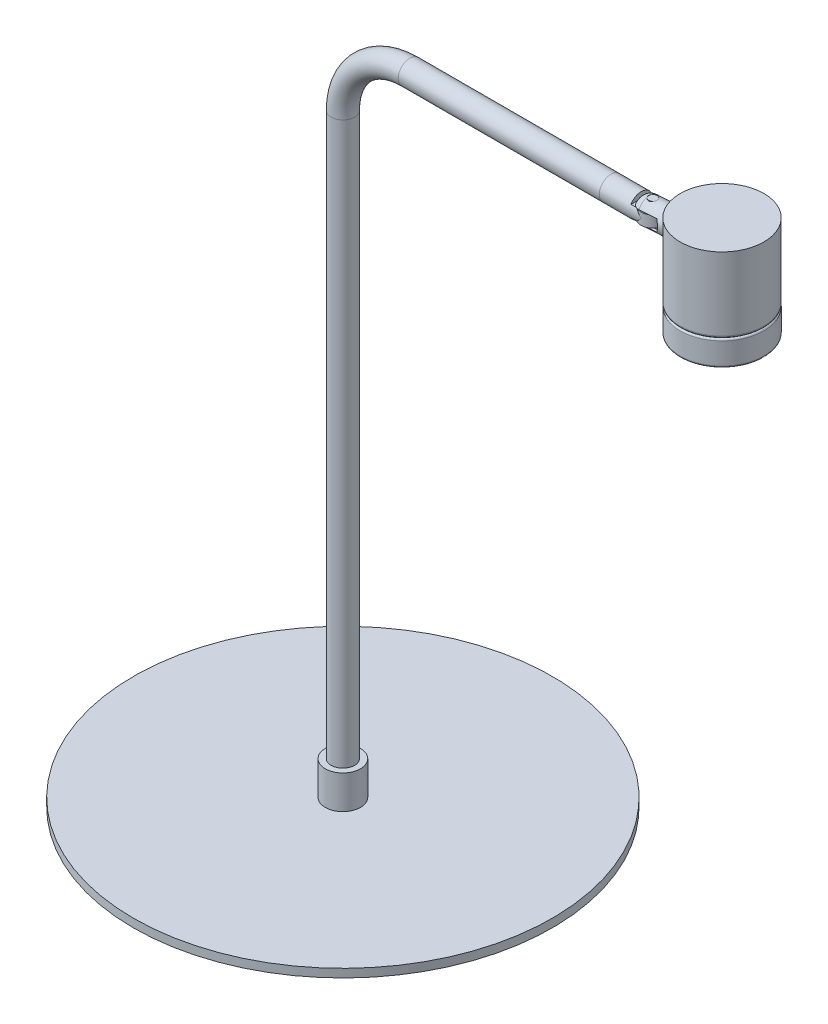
ISO-10303-21;
HEADER;
FILE_DESCRIPTION(('STEP AP214'),'2;1');
FILE_NAME('part.step','',(''),(''),'','','');
FILE_SCHEMA(('AUTOMOTIVE_DESIGN { 1 0 10303 214 1 1 1 1 }'));
ENDSEC;
DATA;
#1=APPLICATION_CONTEXT('core data for automotive mechanical design processes');
#2=APPLICATION_PROTOCOL_DEFINITION('international standard','automotive_design',2000,#1);
#3=PRODUCT_CONTEXT('',#1,'mechanical');
#4=PRODUCT('Part','Part','',(#3));
#5=PRODUCT_RELATED_PRODUCT_CATEGORY('part','',(#4));
#6=PRODUCT_DEFINITION_FORMATION('','',#4);
#7=PRODUCT_DEFINITION_CONTEXT('part definition',#1,'design');
#8=PRODUCT_DEFINITION('design','',#6,#7);
#9=PRODUCT_DEFINITION_SHAPE('','',#8);
#10=(LENGTH_UNIT() NAMED_UNIT(*) SI_UNIT(.MILLI.,.METRE.));
#11=(NAMED_UNIT(*) PLANE_ANGLE_UNIT() SI_UNIT($,.RADIAN.));
#12=(NAMED_UNIT(*) SI_UNIT($,.STERADIAN.) SOLID_ANGLE_UNIT());
#13=UNCERTAINTY_MEASURE_WITH_UNIT(LENGTH_MEASURE(1.E-05),#10,'distance_accuracy_value','');
#14=(GEOMETRIC_REPRESENTATION_CONTEXT(3) GLOBAL_UNCERTAINTY_ASSIGNED_CONTEXT((#13)) GLOBAL_UNIT_ASSIGNED_CONTEXT((#10,
#11,#12)) REPRESENTATION_CONTEXT('',''));
#15=CARTESIAN_POINT('',(0.,0.,0.));
#16=DIRECTION('',(0.,0.,1.));
#17=DIRECTION('',(1.,0.,0.));
#18=AXIS2_PLACEMENT_3D('',#15,#16,#17);
#19=CARTESIAN_POINT('',(-168.022851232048,-238.261126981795,502.));
#20=DIRECTION('',(0.,-1.,0.));
#21=DIRECTION('',(0.,0.,-1.));
#22=AXIS2_PLACEMENT_3D('',#19,#20,#21);
#23=CYLINDRICAL_SURFACE('',#22,10.5);
#24=CARTESIAN_POINT('',(-168.022851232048,-238.261126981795,502.));
#25=DIRECTION('',(0.,1.,0.));
#26=DIRECTION('',(0.,0.,1.));
#27=AXIS2_PLACEMENT_3D('',#24,#25,#26);
#28=CIRCLE('',#27,10.5);
#29=CARTESIAN_POINT('',(-168.022851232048,-238.261126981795,512.5));
#30=VERTEX_POINT('',#29);
#31=EDGE_CURVE('P0_E10',#30,#30,#28,.T.);
#32=ORIENTED_EDGE('',*,*,#31,.F.);
#33=EDGE_LOOP('',(#32));
#34=FACE_BOUND('',#33,.T.);
#35=CARTESIAN_POINT('',(-168.022851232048,-258.261126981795,502.));
#36=DIRECTION('',(0.,1.,0.));
#37=DIRECTION('',(0.,0.,1.));
#38=AXIS2_PLACEMENT_3D('',#35,#36,#37);
#39=CIRCLE('',#38,10.5);
#40=CARTESIAN_POINT('',(-168.022851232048,-258.261126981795,512.5));
#41=VERTEX_POINT('',#40);
#42=EDGE_CURVE('P0_E18',#41,#41,#39,.T.);
#43=ORIENTED_EDGE('',*,*,#42,.T.);
#44=EDGE_LOOP('',(#43));
#45=FACE_BOUND('',#44,.T.);
#46=ADVANCED_FACE('P0_F15',(#34,#45),#23,.T.);
#47=CARTESIAN_POINT('',(-168.022851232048,-238.261126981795,502.));
#48=DIRECTION('',(0.,1.,0.));
#49=DIRECTION('',(0.,0.,1.));
#50=AXIS2_PLACEMENT_3D('',#47,#48,#49);
#51=PLANE('',#50);
#52=ORIENTED_EDGE('',*,*,#31,.T.);
#53=EDGE_LOOP('',(#52));
#54=FACE_BOUND('',#53,.T.);
#55=ADVANCED_FACE('P0_F30',(#54),#51,.T.);
#56=CARTESIAN_POINT('',(-168.022851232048,-258.261126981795,502.));
#57=DIRECTION('',(0.,1.,0.));
#58=DIRECTION('',(0.,0.,1.));
#59=AXIS2_PLACEMENT_3D('',#56,#57,#58);
#60=PLANE('',#59);
#61=ORIENTED_EDGE('',*,*,#42,.F.);
#62=EDGE_LOOP('',(#61));
#63=FACE_BOUND('',#62,.T.);
#64=ADVANCED_FACE('P0_F28',(#63),#60,.F.);
#65=CLOSED_SHELL('',(#46,#55,#64));
#66=MANIFOLD_SOLID_BREP('P0_B1',#65);
#67=CARTESIAN_POINT('',(-168.022851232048,-258.261126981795,502.));
#68=DIRECTION('',(0.,-1.,0.));
#69=DIRECTION('',(0.,0.,-1.));
#70=AXIS2_PLACEMENT_3D('',#67,#68,#69);
#71=CYLINDRICAL_SURFACE('',#70,125.);
#72=CARTESIAN_POINT('',(-168.022851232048,-258.261126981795,502.));
#73=DIRECTION('',(0.,1.,0.));
#74=DIRECTION('',(0.,0.,1.));
#75=AXIS2_PLACEMENT_3D('',#72,#73,#74);
#76=CIRCLE('',#75,125.);
#77=CARTESIAN_POINT('',(-168.022851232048,-258.261126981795,627.));
#78=VERTEX_POINT('',#77);
#79=EDGE_CURVE('P1_E11',#78,#78,#76,.T.);
#80=ORIENTED_EDGE('',*,*,#79,.F.);
#81=EDGE_LOOP('',(#80));
#82=FACE_BOUND('',#81,.T.);
#83=CARTESIAN_POINT('',(-168.022851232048,-263.261126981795,502.));
#84=DIRECTION('',(0.,1.,0.));
#85=DIRECTION('',(0.,0.,1.));
#86=AXIS2_PLACEMENT_3D('',#83,#84,#85);
#87=CIRCLE('',#86,125.);
#88=CARTESIAN_POINT('',(-168.022851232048,-263.261126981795,627.));
#89=VERTEX_POINT('',#88);
#90=EDGE_CURVE('P1_E20',#89,#89,#87,.T.);
#91=ORIENTED_EDGE('',*,*,#90,.T.);
#92=EDGE_LOOP('',(#91));
#93=FACE_BOUND('',#92,.T.);
#94=ADVANCED_FACE('P1_F17',(#82,#93),#71,.T.);
#95=CARTESIAN_POINT('',(-168.022851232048,-258.261126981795,502.));
#96=DIRECTION('',(0.,1.,0.));
#97=DIRECTION('',(0.,0.,1.));
#98=AXIS2_PLACEMENT_3D('',#95,#96,#97);
#99=PLANE('',#98);
#100=CARTESIAN_POINT('',(-168.022851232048,-258.261126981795,502.));
#101=DIRECTION('',(0.,-1.,0.));
#102=DIRECTION('',(0.,0.,1.));
#103=AXIS2_PLACEMENT_3D('',#100,#101,#102);
#104=CIRCLE('',#103,7.);
#105=CARTESIAN_POINT('',(-168.022851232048,-258.261126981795,509.));
#106=VERTEX_POINT('',#105);
#107=EDGE_CURVE('P1_E40',#106,#106,#104,.T.);
#108=ORIENTED_EDGE('',*,*,#107,.T.);
#109=EDGE_LOOP('',(#108));
#110=FACE_BOUND('',#109,.T.);
#111=ORIENTED_EDGE('',*,*,#79,.T.);
#112=EDGE_LOOP('',(#111));
#113=FACE_BOUND('',#112,.T.);
#114=ADVANCED_FACE('P1_F44',(#110,#113),#99,.T.);
#115=CARTESIAN_POINT('',(-168.022851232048,-263.261126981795,502.));
#116=DIRECTION('',(0.,1.,0.));
#117=DIRECTION('',(0.,0.,1.));
#118=AXIS2_PLACEMENT_3D('',#115,#116,#117);
#119=PLANE('',#118);
#120=ORIENTED_EDGE('',*,*,#90,.F.);
#121=EDGE_LOOP('',(#120));
#122=FACE_BOUND('',#121,.T.);
#123=ADVANCED_FACE('P1_F60',(#122),#119,.F.);
#124=CARTESIAN_POINT('',(-8.02285123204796,136.738873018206,502.));
#125=DIRECTION('',(-1.,0.,0.));
#126=DIRECTION('',(0.,0.,1.));
#127=AXIS2_PLACEMENT_3D('',#124,#125,#126);
#128=PLANE('',#127);
#129=CARTESIAN_POINT('',(-8.02285123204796,136.738873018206,502.));
#130=DIRECTION('',(-1.,0.,0.));
#131=DIRECTION('',(0.,0.,1.));
#132=AXIS2_PLACEMENT_3D('',#129,#130,#131);
#133=CIRCLE('',#132,7.);
#134=CARTESIAN_POINT('',(-8.02285123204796,136.738873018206,509.));
#135=VERTEX_POINT('',#134);
#136=EDGE_CURVE('P1_E27',#135,#135,#133,.T.);
#137=ORIENTED_EDGE('',*,*,#136,.F.);
#138=EDGE_LOOP('',(#137));
#139=FACE_BOUND('',#138,.T.);
#140=ADVANCED_FACE('P1_F50',(#139),#128,.F.);
#141=CARTESIAN_POINT('',(-168.022851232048,-258.261126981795,502.));
#142=DIRECTION('',(0.,1.,0.));
#143=DIRECTION('',(0.,0.,1.));
#144=AXIS2_PLACEMENT_3D('',#141,#142,#143);
#145=CYLINDRICAL_SURFACE('',#144,7.);
#146=CARTESIAN_POINT('',(-168.022851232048,96.7388730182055,502.));
#147=DIRECTION('',(0.,-1.,0.));
#148=DIRECTION('',(0.,0.,1.));
#149=AXIS2_PLACEMENT_3D('',#146,#147,#148);
#150=CIRCLE('',#149,7.);
#151=CARTESIAN_POINT('',(-175.022851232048,96.7388730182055,502.));
#152=VERTEX_POINT('',#151);
#153=EDGE_CURVE('P1_E35',#152,#152,#150,.T.);
#154=ORIENTED_EDGE('',*,*,#153,.T.);
#155=EDGE_LOOP('',(#154));
#156=FACE_BOUND('',#155,.T.);
#157=ORIENTED_EDGE('',*,*,#107,.F.);
#158=EDGE_LOOP('',(#157));
#159=FACE_BOUND('',#158,.T.);
#160=ADVANCED_FACE('P1_F47',(#156,#159),#145,.T.);
#161=CARTESIAN_POINT('',(-128.022851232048,96.7388730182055,502.));
#162=DIRECTION('',(0.,0.,-1.));
#163=DIRECTION('',(-1.,0.,0.));
#164=AXIS2_PLACEMENT_3D('',#161,#162,#163);
#165=TOROIDAL_SURFACE('',#164,40.,7.);
#166=CARTESIAN_POINT('',(-128.022851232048,136.738873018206,502.));
#167=DIRECTION('',(-1.,0.,0.));
#168=DIRECTION('',(0.,0.,1.));
#169=AXIS2_PLACEMENT_3D('',#166,#167,#168);
#170=CIRCLE('',#169,7.);
#171=CARTESIAN_POINT('',(-128.022851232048,143.738873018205,502.));
#172=VERTEX_POINT('',#171);
#173=EDGE_CURVE('P1_E31',#172,#172,#170,.T.);
#174=CARTESIAN_POINT('',(-128.022851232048,96.7388730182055,502.));
#175=DIRECTION('',(0.,0.,-1.));
#176=DIRECTION('',(-1.,0.,0.));
#177=AXIS2_PLACEMENT_3D('',#174,#175,#176);
#178=CIRCLE('',#177,47.);
#179=EDGE_CURVE('',#152,#172,#178,.T.);
#180=ORIENTED_EDGE('',*,*,#153,.F.);
#181=ORIENTED_EDGE('',*,*,#173,.T.);
#182=ORIENTED_EDGE('',*,*,#179,.T.);
#183=ORIENTED_EDGE('',*,*,#179,.F.);
#184=EDGE_LOOP('',(#180,#182,#181,#183));
#185=FACE_BOUND('',#184,.T.);
#186=ADVANCED_FACE('P1_F49',(#185),#165,.T.);
#187=CARTESIAN_POINT('',(-128.022851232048,136.738873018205,502.));
#188=DIRECTION('',(1.,0.,0.));
#189=DIRECTION('',(0.,1.,0.));
#190=AXIS2_PLACEMENT_3D('',#187,#188,#189);
#191=CYLINDRICAL_SURFACE('',#190,7.);
#192=ORIENTED_EDGE('',*,*,#136,.T.);
#193=EDGE_LOOP('',(#192));
#194=FACE_BOUND('',#193,.T.);
#195=ORIENTED_EDGE('',*,*,#173,.F.);
#196=EDGE_LOOP('',(#195));
#197=FACE_BOUND('',#196,.T.);
#198=ADVANCED_FACE('P1_F28',(#194,#197),#191,.T.);
#199=CLOSED_SHELL('',(#94,#114,#123,#140,#160,#186,#198));
#200=MANIFOLD_SOLID_BREP('P1_B1',#199);
#201=CARTESIAN_POINT('',(55.6724236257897,91.6346710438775,499.401264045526));
#202=DIRECTION('',(5.05088952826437E-05,0.999999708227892,0.0007622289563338));
#203=DIRECTION('',(0.0661197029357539,-0.00076390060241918,0.997811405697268));
#204=AXIS2_PLACEMENT_3D('',#201,#202,#203);
#205=CYLINDRICAL_SURFACE('',#204,15.);
#206=CARTESIAN_POINT('',(55.6724236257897,91.6346710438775,499.401264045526));
#207=DIRECTION('',(-5.05088952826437E-05,-0.999999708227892,-0.0007622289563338));
#208=DIRECTION('',(-0.0661197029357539,0.00076390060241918,-0.997811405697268));
#209=AXIS2_PLACEMENT_3D('',#206,#207,#208);
#210=CIRCLE('',#209,15.);
#211=CARTESIAN_POINT('',(56.664219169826,91.6232125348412,514.368435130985));
#212=VERTEX_POINT('',#211);
#213=EDGE_CURVE('P2_E10',#212,#212,#210,.T.);
#214=CARTESIAN_POINT('',(55.6724337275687,91.8346709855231,499.401416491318));
#215=DIRECTION('',(-5.05088952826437E-05,-0.999999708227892,-0.0007622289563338));
#216=DIRECTION('',(-0.0661197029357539,0.00076390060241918,-0.997811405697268));
#217=AXIS2_PLACEMENT_3D('',#214,#215,#216);
#218=CIRCLE('',#217,15.);
#219=CARTESIAN_POINT('',(56.664229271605,91.8232124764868,514.368587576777));
#220=VERTEX_POINT('',#219);
#221=EDGE_CURVE('P2_E18',#220,#220,#218,.T.);
#222=CARTESIAN_POINT('',(56.664219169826,91.6232125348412,514.368435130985));
#223=CARTESIAN_POINT('',(56.6642192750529,91.6252958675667,514.368436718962));
#224=CARTESIAN_POINT('',(56.6642193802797,91.6273792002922,514.368438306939));
#225=CARTESIAN_POINT('',(56.6642195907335,91.6315458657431,514.368441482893));
#226=CARTESIAN_POINT('',(56.6642196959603,91.6336291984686,514.36844307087));
#227=CARTESIAN_POINT('',(56.664219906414,91.6377958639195,514.368446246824));
#228=CARTESIAN_POINT('',(56.6642200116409,91.639879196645,514.368447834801));
#229=CARTESIAN_POINT('',(56.6642202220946,91.644045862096,514.368451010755));
#230=CARTESIAN_POINT('',(56.6642203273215,91.6461291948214,514.368452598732));
#231=CARTESIAN_POINT('',(56.6642205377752,91.6502958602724,514.368455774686));
#232=CARTESIAN_POINT('',(56.6642206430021,91.6523791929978,514.368457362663));
#233=CARTESIAN_POINT('',(56.6642208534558,91.6565458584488,514.368460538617));
#234=CARTESIAN_POINT('',(56.6642209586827,91.6586291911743,514.368462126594));
#235=CARTESIAN_POINT('',(56.6642211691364,91.6627958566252,514.368465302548));
#236=CARTESIAN_POINT('',(56.6642212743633,91.6648791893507,514.368466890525));
#237=CARTESIAN_POINT('',(56.664221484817,91.6690458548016,514.368470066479));
#238=CARTESIAN_POINT('',(56.6642215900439,91.6711291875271,514.368471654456));
#239=CARTESIAN_POINT('',(56.6642218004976,91.6752958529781,514.36847483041));
#240=CARTESIAN_POINT('',(56.6642219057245,91.6773791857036,514.368476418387));
#241=CARTESIAN_POINT('',(56.6642221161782,91.6815458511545,514.368479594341));
#242=CARTESIAN_POINT('',(56.6642222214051,91.68362918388,514.368481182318));
#243=CARTESIAN_POINT('',(56.6642224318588,91.6877958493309,514.368484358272));
#244=CARTESIAN_POINT('',(56.6642225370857,91.6898791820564,514.368485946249));
#245=CARTESIAN_POINT('',(56.6642227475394,91.6940458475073,514.368489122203));
#246=CARTESIAN_POINT('',(56.6642228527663,91.6961291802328,514.36849071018));
#247=CARTESIAN_POINT('',(56.66422306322,91.7002958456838,514.368493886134));
#248=CARTESIAN_POINT('',(56.6642231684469,91.7023791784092,514.368495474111));
#249=CARTESIAN_POINT('',(56.6642233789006,91.7065458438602,514.368498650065));
#250=CARTESIAN_POINT('',(56.6642234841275,91.7086291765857,514.368500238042));
#251=CARTESIAN_POINT('',(56.6642236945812,91.7127958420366,514.368503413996));
#252=CARTESIAN_POINT('',(56.6642237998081,91.7148791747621,514.368505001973));
#253=CARTESIAN_POINT('',(56.6642240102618,91.719045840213,514.368508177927));
#254=CARTESIAN_POINT('',(56.6642241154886,91.7211291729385,514.368509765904));
#255=CARTESIAN_POINT('',(56.6642243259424,91.7252958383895,514.368512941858));
#256=CARTESIAN_POINT('',(56.6642244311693,91.7273791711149,514.368514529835));
#257=CARTESIAN_POINT('',(56.664224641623,91.7315458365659,514.368517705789));
#258=CARTESIAN_POINT('',(56.6642247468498,91.7336291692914,514.368519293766));
#259=CARTESIAN_POINT('',(56.6642249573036,91.7377958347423,514.36852246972));
#260=CARTESIAN_POINT('',(56.6642250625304,91.7398791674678,514.368524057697));
#261=CARTESIAN_POINT('',(56.6642252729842,91.7440458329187,514.368527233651));
#262=CARTESIAN_POINT('',(56.664225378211,91.7461291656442,514.368528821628));
#263=CARTESIAN_POINT('',(56.6642255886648,91.7502958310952,514.368531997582));
#264=CARTESIAN_POINT('',(56.6642256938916,91.7523791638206,514.368533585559));
#265=CARTESIAN_POINT('',(56.6642259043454,91.7565458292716,514.368536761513));
#266=CARTESIAN_POINT('',(56.6642260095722,91.7586291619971,514.36853834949));
#267=CARTESIAN_POINT('',(56.664226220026,91.762795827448,514.368541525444));
#268=CARTESIAN_POINT('',(56.6642263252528,91.7648791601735,514.368543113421));
#269=CARTESIAN_POINT('',(56.6642265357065,91.7690458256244,514.368546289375));
#270=CARTESIAN_POINT('',(56.6642266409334,91.7711291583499,514.368547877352));
#271=CARTESIAN_POINT('',(56.6642268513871,91.7752958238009,514.368551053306));
#272=CARTESIAN_POINT('',(56.664226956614,91.7773791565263,514.368552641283));
#273=CARTESIAN_POINT('',(56.6642271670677,91.7815458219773,514.368555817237));
#274=CARTESIAN_POINT('',(56.6642272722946,91.7836291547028,514.368557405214));
#275=CARTESIAN_POINT('',(56.6642274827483,91.7877958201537,514.368560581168));
#276=CARTESIAN_POINT('',(56.6642275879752,91.7898791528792,514.368562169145));
#277=CARTESIAN_POINT('',(56.6642277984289,91.7940458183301,514.368565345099));
#278=CARTESIAN_POINT('',(56.6642279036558,91.7961291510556,514.368566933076));
#279=CARTESIAN_POINT('',(56.6642281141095,91.8002958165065,514.36857010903));
#280=CARTESIAN_POINT('',(56.6642282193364,91.802379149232,514.368571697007));
#281=CARTESIAN_POINT('',(56.6642284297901,91.806545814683,514.368574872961));
#282=CARTESIAN_POINT('',(56.664228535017,91.8086291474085,514.368576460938));
#283=CARTESIAN_POINT('',(56.6642287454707,91.8127958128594,514.368579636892));
#284=CARTESIAN_POINT('',(56.6642288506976,91.8148791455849,514.368581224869));
#285=CARTESIAN_POINT('',(56.6642290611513,91.8190458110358,514.368584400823));
#286=CARTESIAN_POINT('',(56.6642291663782,91.8211291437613,514.3685859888));
#287=CARTESIAN_POINT('',(56.664229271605,91.8232124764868,514.368587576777));
#288=B_SPLINE_CURVE_WITH_KNOTS('',3,(#222,#223,#224,#225,#226,#227,#228,#229,#230,#231,#232,
#233,#234,#235,#236,#237,#238,#239,#240,#241,#242,#243,#244,#245,#246,#247,#248,#249,#250,#251,
#252,#253,#254,#255,#256,#257,#258,#259,#260,#261,#262,#263,#264,#265,#266,#267,#268,#269,#270,
#271,#272,#273,#274,#275,#276,#277,#278,#279,#280,#281,#282,#283,#284,#285,#286,#287),
.UNSPECIFIED.,.F.,.F.,(4,2,2,2,2,2,2,2,2,2,2,2,2,2,2,2,2,2,2,2,2,2,2,2,2,2,2,2,2,2,2,2,4),(0.,
0.00625000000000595,0.0125000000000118,0.0187500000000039,0.0250000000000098,0.0312500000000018,
0.0375000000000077,0.0437499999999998,0.0500000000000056,0.0562500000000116,0.0625000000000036,
0.0687500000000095,0.0750000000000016,0.0812500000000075,0.0874999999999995,0.0937500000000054,
0.0999999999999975,0.106250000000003,0.112500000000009,0.118750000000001,0.125000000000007,
0.131249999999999,0.137500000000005,0.143749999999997,0.150000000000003,0.156250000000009,
0.162500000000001,0.168750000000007,0.174999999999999,0.181250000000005,0.187499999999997,
0.193750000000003,0.200000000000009),.UNSPECIFIED.);
#289=EDGE_CURVE('P2_BSEAM15',#212,#220,#288,.T.);
#290=ORIENTED_EDGE('',*,*,#213,.F.);
#291=ORIENTED_EDGE('',*,*,#221,.T.);
#292=ORIENTED_EDGE('',*,*,#289,.T.);
#293=ORIENTED_EDGE('',*,*,#289,.F.);
#294=EDGE_LOOP('',(#290,#292,#291,#293));
#295=FACE_BOUND('',#294,.T.);
#296=ADVANCED_FACE('P2_F15',(#295),#205,.T.);
#297=CARTESIAN_POINT('',(55.6724236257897,91.6346710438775,499.401264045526));
#298=DIRECTION('',(-5.05088952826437E-05,-0.999999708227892,-0.0007622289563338));
#299=DIRECTION('',(-0.0661197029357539,0.00076390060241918,-0.997811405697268));
#300=AXIS2_PLACEMENT_3D('',#297,#298,#299);
#301=PLANE('',#300);
#302=ORIENTED_EDGE('',*,*,#213,.T.);
#303=EDGE_LOOP('',(#302));
#304=FACE_BOUND('',#303,.T.);
#305=ADVANCED_FACE('P2_F30',(#304),#301,.T.);
#306=CARTESIAN_POINT('',(55.6724337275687,91.8346709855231,499.401416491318));
#307=DIRECTION('',(-5.05088952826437E-05,-0.999999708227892,-0.0007622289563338));
#308=DIRECTION('',(-0.0661197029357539,0.00076390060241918,-0.997811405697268));
#309=AXIS2_PLACEMENT_3D('',#306,#307,#308);
#310=PLANE('',#309);
#311=ORIENTED_EDGE('',*,*,#221,.F.);
#312=EDGE_LOOP('',(#311));
#313=FACE_BOUND('',#312,.T.);
#314=ADVANCED_FACE('P2_F28',(#313),#310,.F.);
#315=CLOSED_SHELL('',(#296,#305,#314));
#316=MANIFOLD_SOLID_BREP('P2_B1',#315);
#317=CARTESIAN_POINT('',(55.6754642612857,151.834653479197,499.447150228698));
#318=DIRECTION('',(-5.05088952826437E-05,-0.999999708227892,-0.0007622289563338));
#319=DIRECTION('',(-0.0661197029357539,0.00076390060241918,-0.997811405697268));
#320=AXIS2_PLACEMENT_3D('',#317,#318,#319);
#321=CYLINDRICAL_SURFACE('',#320,25.);
#322=CARTESIAN_POINT('',(55.6732671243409,108.334666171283,499.413993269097));
#323=DIRECTION('',(5.05088952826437E-05,0.999999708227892,0.0007622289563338));
#324=DIRECTION('',(0.0661197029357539,-0.00076390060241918,0.997811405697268));
#325=AXIS2_PLACEMENT_3D('',#322,#323,#324);
#326=CIRCLE('',#325,25.);
#327=CARTESIAN_POINT('',(57.3262596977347,108.315568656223,524.359278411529));
#328=VERTEX_POINT('',#327);
#329=EDGE_CURVE('P3_E32',#328,#328,#326,.T.);
#330=ORIENTED_EDGE('',*,*,#329,.T.);
#331=EDGE_LOOP('',(#330));
#332=FACE_BOUND('',#331,.T.);
#333=CARTESIAN_POINT('',(55.6754642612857,151.834653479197,499.447150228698));
#334=DIRECTION('',(5.05088952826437E-05,0.999999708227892,0.0007622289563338));
#335=DIRECTION('',(0.0661197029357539,-0.00076390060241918,0.997811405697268));
#336=AXIS2_PLACEMENT_3D('',#333,#334,#335);
#337=CIRCLE('',#336,25.);
#338=CARTESIAN_POINT('',(57.3284568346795,151.815555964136,524.392435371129));
#339=VERTEX_POINT('',#338);
#340=EDGE_CURVE('P3_E37',#339,#339,#337,.T.);
#341=ORIENTED_EDGE('',*,*,#340,.F.);
#342=EDGE_LOOP('',(#341));
#343=FACE_BOUND('',#342,.T.);
#344=CARTESIAN_POINT('',(32.2807649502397,136.829119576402,508.251807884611));
#345=CARTESIAN_POINT('',(32.2807746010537,137.028096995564,508.251959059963));
#346=CARTESIAN_POINT('',(32.2777594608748,137.227089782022,508.244095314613));
#347=CARTESIAN_POINT('',(32.2657604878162,137.623624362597,508.21240459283));
#348=CARTESIAN_POINT('',(32.2567762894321,137.821166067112,508.188576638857));
#349=CARTESIAN_POINT('',(32.2330815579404,138.213382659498,508.125158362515));
#350=CARTESIAN_POINT('',(32.2183701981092,138.408057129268,508.08556576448));
#351=CARTESIAN_POINT('',(32.1836074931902,138.793197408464,507.990933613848));
#352=CARTESIAN_POINT('',(32.1635541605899,138.983661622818,507.935888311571));
#353=CARTESIAN_POINT('',(32.1186717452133,139.358642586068,507.810911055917));
#354=CARTESIAN_POINT('',(32.0938522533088,139.543170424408,507.741008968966));
#355=CARTESIAN_POINT('',(32.0400343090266,139.905493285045,507.586777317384));
#356=CARTESIAN_POINT('',(32.0110342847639,140.083285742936,507.502442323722));
#357=CARTESIAN_POINT('',(31.9188128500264,140.604707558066,507.228697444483));
#358=CARTESIAN_POINT('',(31.8503264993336,140.936729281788,507.018431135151));
#359=CARTESIAN_POINT('',(31.7036279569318,141.569501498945,506.541412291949));
#360=CARTESIAN_POINT('',(31.6252044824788,141.869176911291,506.273298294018));
#361=CARTESIAN_POINT('',(31.5067550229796,142.281557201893,505.836720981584));
#362=CARTESIAN_POINT('',(31.4671127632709,142.412894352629,505.685362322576));
#363=CARTESIAN_POINT('',(31.3883998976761,142.66237509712,505.372029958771));
#364=CARTESIAN_POINT('',(31.3493290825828,142.780523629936,505.210060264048));
#365=CARTESIAN_POINT('',(31.2718335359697,143.005002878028,504.87319749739));
#366=CARTESIAN_POINT('',(31.2334365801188,143.111055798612,504.698113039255));
#367=CARTESIAN_POINT('',(31.1589429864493,143.30776891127,504.33911198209));
#368=CARTESIAN_POINT('',(31.1228455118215,143.39843472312,504.155198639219));
#369=CARTESIAN_POINT('',(31.0537012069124,143.563684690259,503.77971929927));
#370=CARTESIAN_POINT('',(31.0206544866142,143.638268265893,503.588153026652));
#371=CARTESIAN_POINT('',(30.9582939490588,143.770704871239,503.198732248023));
#372=CARTESIAN_POINT('',(30.9289800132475,143.828558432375,503.000877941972));
#373=CARTESIAN_POINT('',(30.8753870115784,143.925689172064,502.60571986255));
#374=CARTESIAN_POINT('',(30.8509939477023,143.965423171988,502.408543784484));
#375=CARTESIAN_POINT('',(30.8066997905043,144.028193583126,502.011055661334));
#376=CARTESIAN_POINT('',(30.7867985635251,144.051230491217,501.810743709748));
#377=CARTESIAN_POINT('',(30.7517782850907,144.08039264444,501.408510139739));
#378=CARTESIAN_POINT('',(30.7366584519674,144.086520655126,501.206588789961));
#379=CARTESIAN_POINT('',(30.711347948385,144.081815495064,500.802636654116));
#380=CARTESIAN_POINT('',(30.7011571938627,144.070982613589,500.600605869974));
#381=CARTESIAN_POINT('',(30.6859464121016,144.033037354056,500.204015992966));
#382=CARTESIAN_POINT('',(30.6807804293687,144.00642313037,500.00941458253));
#383=CARTESIAN_POINT('',(30.6749785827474,143.937552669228,499.62286494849));
#384=CARTESIAN_POINT('',(30.674344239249,143.895291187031,499.430917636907));
#385=CARTESIAN_POINT('',(30.6773776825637,143.795498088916,499.05113960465));
#386=CARTESIAN_POINT('',(30.6810440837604,143.737971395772,498.863307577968));
#387=CARTESIAN_POINT('',(30.6923415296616,143.608079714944,498.492894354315));
#388=CARTESIAN_POINT('',(30.6999740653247,143.535709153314,498.31031515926));
#389=CARTESIAN_POINT('',(30.7188761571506,143.375837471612,497.949741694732));
#390=CARTESIAN_POINT('',(30.7301840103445,143.288181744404,497.771818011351));
#391=CARTESIAN_POINT('',(30.7558918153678,143.098900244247,497.423722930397));
#392=CARTESIAN_POINT('',(30.770292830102,142.997269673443,497.253554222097));
#393=CARTESIAN_POINT('',(30.8015945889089,142.780763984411,496.92210412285));
#394=CARTESIAN_POINT('',(30.8184953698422,142.665888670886,496.760822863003));
#395=CARTESIAN_POINT('',(30.8541566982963,142.423646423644,496.448148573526));
#396=CARTESIAN_POINT('',(30.8729172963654,142.296279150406,496.296755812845));
#397=CARTESIAN_POINT('',(30.9123269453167,142.025006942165,495.99949222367));
#398=CARTESIAN_POINT('',(30.9330198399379,141.880669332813,495.854021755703));
#399=CARTESIAN_POINT('',(30.9748970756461,141.580421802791,495.575741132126));
#400=CARTESIAN_POINT('',(30.9960812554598,141.424515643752,495.442926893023));
#401=CARTESIAN_POINT('',(31.0381780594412,141.102008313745,495.190772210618));
#402=CARTESIAN_POINT('',(31.0590905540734,140.935402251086,495.071437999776));
#403=CARTESIAN_POINT('',(31.0998580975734,140.59269374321,494.847234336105));
#404=CARTESIAN_POINT('',(31.1197135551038,140.416595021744,494.742359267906));
#405=CARTESIAN_POINT('',(31.1578106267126,140.054386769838,494.546971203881));
#406=CARTESIAN_POINT('',(31.1760363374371,139.868202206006,494.456594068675));
#407=CARTESIAN_POINT('',(31.2099714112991,139.488627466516,494.292136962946));
#408=CARTESIAN_POINT('',(31.2256817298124,139.295240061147,494.218050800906));
#409=CARTESIAN_POINT('',(31.2539836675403,138.902587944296,494.086806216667));
#410=CARTESIAN_POINT('',(31.2665754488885,138.703323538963,494.029646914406));
#411=CARTESIAN_POINT('',(31.2881425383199,138.300401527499,493.932802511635));
#412=CARTESIAN_POINT('',(31.2971179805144,138.096744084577,493.893116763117));
#413=CARTESIAN_POINT('',(31.3108476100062,137.693798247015,493.832693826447));
#414=CARTESIAN_POINT('',(31.3157385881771,137.494606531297,493.81134186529));
#415=CARTESIAN_POINT('',(31.3216328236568,137.095076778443,493.785485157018));
#416=CARTESIAN_POINT('',(31.3226361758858,136.894738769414,493.780979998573));
#417=CARTESIAN_POINT('',(31.3207168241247,136.494438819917,493.788859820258));
#418=CARTESIAN_POINT('',(31.3177945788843,136.29447683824,493.80124282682));
#419=CARTESIAN_POINT('',(31.3081354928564,135.896396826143,493.842773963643));
#420=CARTESIAN_POINT('',(31.3013986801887,135.698278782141,493.871921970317));
#421=CARTESIAN_POINT('',(31.2845692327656,135.310062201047,493.945803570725));
#422=CARTESIAN_POINT('',(31.2745610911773,135.119885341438,493.990145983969));
#423=CARTESIAN_POINT('',(31.2515038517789,134.743893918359,494.094160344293));
#424=CARTESIAN_POINT('',(31.2384537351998,134.558080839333,494.1538374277));
#425=CARTESIAN_POINT('',(31.209772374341,134.192141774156,494.287998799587));
#426=CARTESIAN_POINT('',(31.1941417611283,134.012014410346,494.362479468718));
#427=CARTESIAN_POINT('',(31.1608256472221,133.658461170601,494.525700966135));
#428=CARTESIAN_POINT('',(31.1431393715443,133.48503785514,494.614447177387));
#429=CARTESIAN_POINT('',(31.1058510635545,133.141766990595,494.807916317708));
#430=CARTESIAN_POINT('',(31.086212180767,132.972117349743,494.912983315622));
#431=CARTESIAN_POINT('',(31.0460851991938,132.642021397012,495.136663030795));
#432=CARTESIAN_POINT('',(31.0255968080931,132.481578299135,495.255280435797));
#433=CARTESIAN_POINT('',(30.984489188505,132.170924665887,495.505219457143));
#434=CARTESIAN_POINT('',(30.9638699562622,132.020714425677,495.63654143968));
#435=CARTESIAN_POINT('',(30.9232220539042,131.731442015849,495.911022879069));
#436=CARTESIAN_POINT('',(30.9031933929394,131.592380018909,496.054182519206));
#437=CARTESIAN_POINT('',(30.8637577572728,131.321581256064,496.35665779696));
#438=CARTESIAN_POINT('',(30.8443974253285,131.190274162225,496.516364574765));
#439=CARTESIAN_POINT('',(30.8078452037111,130.941476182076,496.846347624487));
#440=CARTESIAN_POINT('',(30.7906525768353,130.823980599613,497.016620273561));
#441=CARTESIAN_POINT('',(30.7591415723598,130.603562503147,497.366692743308));
#442=CARTESIAN_POINT('',(30.7448242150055,130.500645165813,497.54649591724));
#443=CARTESIAN_POINT('',(30.7197334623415,130.310262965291,497.914253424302));
#444=CARTESIAN_POINT('',(30.7089586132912,130.222791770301,498.102204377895));
#445=CARTESIAN_POINT('',(30.6915817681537,130.064545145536,498.483586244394));
#446=CARTESIAN_POINT('',(30.684949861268,129.993652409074,498.676967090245));
#447=CARTESIAN_POINT('',(30.6761978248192,129.868377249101,499.069025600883));
#448=CARTESIAN_POINT('',(30.6740759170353,129.813988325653,499.267701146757));
#449=CARTESIAN_POINT('',(30.6746811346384,129.722173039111,499.668925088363));
#450=CARTESIAN_POINT('',(30.6774081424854,129.684746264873,499.871473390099));
#451=CARTESIAN_POINT('',(30.6879202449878,129.62720434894,500.278883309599));
#452=CARTESIAN_POINT('',(30.6957051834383,129.607088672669,500.48374485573));
#453=CARTESIAN_POINT('',(30.7160205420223,129.584771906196,500.886723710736));
#454=CARTESIAN_POINT('',(30.7283684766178,129.581947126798,501.084815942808));
#455=CARTESIAN_POINT('',(30.7577507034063,129.592577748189,501.480284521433));
#456=CARTESIAN_POINT('',(30.7747866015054,129.606038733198,501.677660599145));
#457=CARTESIAN_POINT('',(30.8133314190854,129.649120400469,502.070111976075));
#458=CARTESIAN_POINT('',(30.8348384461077,129.678734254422,502.265188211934));
#459=CARTESIAN_POINT('',(30.8820134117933,129.753870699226,502.651814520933));
#460=CARTESIAN_POINT('',(30.9076828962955,129.799399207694,502.843363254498));
#461=CARTESIAN_POINT('',(30.9624680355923,129.905449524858,503.219676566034));
#462=CARTESIAN_POINT('',(30.9915472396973,129.965819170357,503.404489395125));
#463=CARTESIAN_POINT('',(31.0528419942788,130.101314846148,503.768156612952));
#464=CARTESIAN_POINT('',(31.0850586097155,130.176445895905,503.94700895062));
#465=CARTESIAN_POINT('',(31.1520194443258,130.340878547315,504.297565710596));
#466=CARTESIAN_POINT('',(31.1867635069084,130.430179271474,504.469270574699));
#467=CARTESIAN_POINT('',(31.2581197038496,130.622320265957,504.804524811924));
#468=CARTESIAN_POINT('',(31.294731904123,130.725161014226,504.968073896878));
#469=CARTESIAN_POINT('',(31.3702506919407,130.947034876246,505.290937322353));
#470=CARTESIAN_POINT('',(31.4091932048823,131.066467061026,505.449969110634));
#471=CARTESIAN_POINT('',(31.4874748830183,131.318130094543,505.757366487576));
#472=CARTESIAN_POINT('',(31.5268139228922,131.450357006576,505.9057353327));
#473=CARTESIAN_POINT('',(31.6050810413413,131.726872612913,506.191071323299));
#474=CARTESIAN_POINT('',(31.644008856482,131.871168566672,506.328031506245));
#475=CARTESIAN_POINT('',(31.7205590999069,132.170794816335,506.589581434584));
#476=CARTESIAN_POINT('',(31.7581819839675,132.326121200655,506.714175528));
#477=CARTESIAN_POINT('',(31.8323005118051,132.651349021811,506.953556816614));
#478=CARTESIAN_POINT('',(31.868735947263,132.821535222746,507.067976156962));
#479=CARTESIAN_POINT('',(31.9384305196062,133.171419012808,507.282170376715));
#480=CARTESIAN_POINT('',(31.9716908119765,133.351113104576,507.381950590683));
#481=CARTESIAN_POINT('',(32.0341890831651,133.718815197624,507.566166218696));
#482=CARTESIAN_POINT('',(32.0634281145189,133.906821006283,507.650605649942));
#483=CARTESIAN_POINT('',(32.1171122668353,134.289872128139,507.803507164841));
#484=CARTESIAN_POINT('',(32.1415579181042,134.484916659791,507.871971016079));
#485=CARTESIAN_POINT('',(32.1822588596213,134.85580341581,507.9848069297));
#486=CARTESIAN_POINT('',(32.199156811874,135.030986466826,508.031123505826));
#487=CARTESIAN_POINT('',(32.2284051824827,135.384644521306,508.110797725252));
#488=CARTESIAN_POINT('',(32.2407558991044,135.563119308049,508.144156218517));
#489=CARTESIAN_POINT('',(32.2606345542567,135.922311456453,508.197682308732));
#490=CARTESIAN_POINT('',(32.2681622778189,136.103028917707,508.217849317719));
#491=CARTESIAN_POINT('',(32.2782222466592,136.465533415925,508.244840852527));
#492=CARTESIAN_POINT('',(32.2807561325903,136.647320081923,508.251669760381));
#493=CARTESIAN_POINT('',(32.2807649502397,136.829119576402,508.251807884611));
#494=B_SPLINE_CURVE_WITH_KNOTS('',3,(#344,#345,#346,#347,#348,#349,#350,#351,#352,#353,#354,
#355,#356,#357,#358,#359,#360,#361,#362,#363,#364,#365,#366,#367,#368,#369,#370,#371,#372,#373,
#374,#375,#376,#377,#378,#379,#380,#381,#382,#383,#384,#385,#386,#387,#388,#389,#390,#391,#392,
#393,#394,#395,#396,#397,#398,#399,#400,#401,#402,#403,#404,#405,#406,#407,#408,#409,#410,#411,
#412,#413,#414,#415,#416,#417,#418,#419,#420,#421,#422,#423,#424,#425,#426,#427,#428,#429,#430,
#431,#432,#433,#434,#435,#436,#437,#438,#439,#440,#441,#442,#443,#444,#445,#446,#447,#448,#449,
#450,#451,#452,#453,#454,#455,#456,#457,#458,#459,#460,#461,#462,#463,#464,#465,#466,#467,#468,
#469,#470,#471,#472,#473,#474,#475,#476,#477,#478,#479,#480,#481,#482,#483,#484,#485,#486,#487,
#488,#489,#490,#491,#492,#493),.UNSPECIFIED.,.T.,.F.,(4,2,2,2,2,2,2,2,2,2,2,2,2,2,2,2,2,2,2,2,2,
2,2,2,2,2,2,2,2,2,2,2,2,2,2,2,2,2,2,2,2,2,2,2,2,2,2,2,2,2,2,2,2,2,2,2,2,2,2,2,2,2,2,2,2,2,2,2,2,
2,2,2,2,2,4),(0.,0.596764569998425,1.19356568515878,1.79045298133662,2.38756266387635,
2.98348314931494,3.5796282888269,4.77082358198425,5.99390747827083,6.60616524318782,
7.21819294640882,7.84224531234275,8.46606926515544,9.08991569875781,9.71374231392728,
10.3208291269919,10.9278978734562,11.5348673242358,12.1418264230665,12.730576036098,
13.3195231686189,13.9082806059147,14.4972595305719,15.0925837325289,15.6881128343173,
16.2836507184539,16.8792047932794,17.4963928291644,18.1133810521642,18.7306533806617,
19.3476853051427,19.970198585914,20.5924748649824,21.2147187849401,21.836939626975,
22.4373754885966,23.0377966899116,23.6381477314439,24.2384943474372,24.8244207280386,
25.4105436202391,25.9965233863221,26.5827247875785,27.1835871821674,27.7846580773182,
28.3857463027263,28.9868438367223,29.6090831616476,30.2311102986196,30.8533577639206,
31.4753495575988,32.0927972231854,32.7100013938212,33.3271906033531,33.9443607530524,
34.5391315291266,35.134106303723,35.7288297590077,36.3237745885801,36.9128568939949,
37.5021398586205,38.0913863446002,38.6806536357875,39.2879453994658,39.8950509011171,
40.5025242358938,41.1097832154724,41.7338852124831,42.3577592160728,42.9814696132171,
43.6051109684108,44.1505469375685,44.695947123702,45.2413716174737,45.7866168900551),.UNSPECIFIED.);
#495=CARTESIAN_POINT('',(32.2807649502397,136.829119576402,508.251807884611));
#496=VERTEX_POINT('',#495);
#497=EDGE_CURVE('P3_E19',#496,#496,#494,.T.);
#498=ORIENTED_EDGE('',*,*,#497,.F.);
#499=EDGE_LOOP('',(#498));
#500=FACE_BOUND('',#499,.T.);
#501=ADVANCED_FACE('P3_F15',(#332,#343,#500),#321,.T.);
#502=CARTESIAN_POINT('',(55.6754642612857,151.834653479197,499.447150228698));
#503=DIRECTION('',(5.05088952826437E-05,0.999999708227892,0.0007622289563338));
#504=DIRECTION('',(0.0661197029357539,-0.00076390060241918,0.997811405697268));
#505=AXIS2_PLACEMENT_3D('',#502,#503,#504);
#506=PLANE('',#505);
#507=ORIENTED_EDGE('',*,*,#340,.T.);
#508=EDGE_LOOP('',(#507));
#509=FACE_BOUND('',#508,.T.);
#510=ADVANCED_FACE('P3_F53',(#509),#506,.T.);
#511=CARTESIAN_POINT('',(55.673191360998,106.834666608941,499.412849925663));
#512=DIRECTION('',(5.05088952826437E-05,0.999999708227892,0.0007622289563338));
#513=DIRECTION('',(0.0661197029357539,-0.00076390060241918,0.997811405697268));
#514=AXIS2_PLACEMENT_3D('',#511,#512,#513);
#515=PLANE('',#514);
#516=CARTESIAN_POINT('',(55.673191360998,106.834666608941,499.412849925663));
#517=DIRECTION('',(5.05088952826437E-05,0.999999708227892,0.0007622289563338));
#518=DIRECTION('',(0.0661197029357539,-0.00076390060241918,0.997811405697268));
#519=AXIS2_PLACEMENT_3D('',#516,#517,#518);
#520=CIRCLE('',#519,23.5);
#521=CARTESIAN_POINT('',(57.2270043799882,106.816714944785,522.861417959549));
#522=VERTEX_POINT('',#521);
#523=EDGE_CURVE('P3_E28',#522,#522,#520,.F.);
#524=ORIENTED_EDGE('',*,*,#523,.T.);
#525=EDGE_LOOP('',(#524));
#526=FACE_BOUND('',#525,.T.);
#527=ADVANCED_FACE('P3_F59',(#526),#515,.F.);
#528=CARTESIAN_POINT('',(55.6732671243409,108.334666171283,499.413993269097));
#529=DIRECTION('',(5.05088952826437E-05,0.999999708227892,0.0007622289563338));
#530=DIRECTION('',(0.0661197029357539,-0.00076390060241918,0.997811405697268));
#531=AXIS2_PLACEMENT_3D('',#528,#529,#530);
#532=TOROIDAL_SURFACE('',#531,23.5,1.5);
#533=ORIENTED_EDGE('',*,*,#523,.F.);
#534=EDGE_LOOP('',(#533));
#535=FACE_BOUND('',#534,.T.);
#536=ORIENTED_EDGE('',*,*,#329,.F.);
#537=EDGE_LOOP('',(#536));
#538=FACE_BOUND('',#537,.T.);
#539=ADVANCED_FACE('P3_F17',(#535,#538),#532,.T.);
#540=CARTESIAN_POINT('',(33.7228492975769,136.83465785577,500.890350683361));
#541=DIRECTION('',(-0.99781169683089,-3.5962972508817E-13,0.0661197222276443));
#542=DIRECTION('',(0.0661197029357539,-0.00076390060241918,0.997811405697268));
#543=AXIS2_PLACEMENT_3D('',#540,#541,#542);
#544=CYLINDRICAL_SURFACE('',#543,7.25);
#545=CARTESIAN_POINT('',(33.7228492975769,136.83465785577,500.890350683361));
#546=DIRECTION('',(0.99781169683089,3.5962972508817E-13,-0.0661197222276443));
#547=DIRECTION('',(-0.0661197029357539,0.00076390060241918,-0.997811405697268));
#548=AXIS2_PLACEMENT_3D('',#545,#546,#547);
#549=CIRCLE('',#548,7.25);
#550=CARTESIAN_POINT('',(33.2434814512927,136.840196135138,493.656217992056));
#551=VERTEX_POINT('',#550);
#552=EDGE_CURVE('P3_E43',#551,#551,#549,.T.);
#553=ORIENTED_EDGE('',*,*,#552,.T.);
#554=EDGE_LOOP('',(#553));
#555=FACE_BOUND('',#554,.T.);
#556=ORIENTED_EDGE('',*,*,#497,.T.);
#557=EDGE_LOOP('',(#556));
#558=FACE_BOUND('',#557,.T.);
#559=ADVANCED_FACE('P3_F50',(#555,#558),#544,.F.);
#560=CARTESIAN_POINT('',(33.7228492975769,136.83465785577,500.890350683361));
#561=DIRECTION('',(0.99781169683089,3.5962972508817E-13,-0.0661197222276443));
#562=DIRECTION('',(-0.0661197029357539,0.00076390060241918,-0.997811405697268));
#563=AXIS2_PLACEMENT_3D('',#560,#561,#562);
#564=PLANE('',#563);
#565=ORIENTED_EDGE('',*,*,#552,.F.);
#566=EDGE_LOOP('',(#565));
#567=FACE_BOUND('',#566,.T.);
#568=ADVANCED_FACE('P3_F82',(#567),#564,.F.);
#569=CLOSED_SHELL('',(#501,#510,#527,#539,#559,#568));
#570=CARTESIAN_POINT('',(55.6754137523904,150.834653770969,499.446387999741));
#571=DIRECTION('',(5.05088952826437E-05,0.999999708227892,0.0007622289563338));
#572=DIRECTION('',(0.0661197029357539,-0.00076390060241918,0.997811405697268));
#573=AXIS2_PLACEMENT_3D('',#570,#571,#572);
#574=PLANE('',#573);
#575=CARTESIAN_POINT('',(55.6754137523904,150.834653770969,499.446387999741));
#576=DIRECTION('',(5.05088952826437E-05,0.999999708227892,0.0007622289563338));
#577=DIRECTION('',(0.0661197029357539,-0.00076390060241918,0.997811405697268));
#578=AXIS2_PLACEMENT_3D('',#575,#576,#577);
#579=CIRCLE('',#578,21.);
#580=CARTESIAN_POINT('',(57.0639275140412,150.818611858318,520.400427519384));
#581=VERTEX_POINT('',#580);
#582=EDGE_CURVE('P3_E9',#581,#581,#579,.F.);
#583=ORIENTED_EDGE('',*,*,#582,.T.);
#584=EDGE_LOOP('',(#583));
#585=FACE_BOUND('',#584,.T.);
#586=ADVANCED_FACE('P3_F76',(#585),#574,.F.);
#587=CARTESIAN_POINT('',(55.6743530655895,129.834659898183,499.430381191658));
#588=DIRECTION('',(5.05088952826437E-05,0.999999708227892,0.0007622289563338));
#589=DIRECTION('',(0.0661197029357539,-0.00076390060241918,0.997811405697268));
#590=AXIS2_PLACEMENT_3D('',#587,#588,#589);
#591=PLANE('',#590);
#592=CARTESIAN_POINT('',(55.6743530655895,129.834659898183,499.430381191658));
#593=DIRECTION('',(5.05088952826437E-05,0.999999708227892,0.0007622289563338));
#594=DIRECTION('',(0.0661197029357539,-0.00076390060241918,0.997811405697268));
#595=AXIS2_PLACEMENT_3D('',#592,#593,#594);
#596=CIRCLE('',#595,21.);
#597=CARTESIAN_POINT('',(57.0628668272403,129.818617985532,520.384420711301));
#598=VERTEX_POINT('',#597);
#599=EDGE_CURVE('P3_E40',#598,#598,#596,.T.);
#600=ORIENTED_EDGE('',*,*,#599,.T.);
#601=EDGE_LOOP('',(#600));
#602=FACE_BOUND('',#601,.T.);
#603=ADVANCED_FACE('P3_F71',(#602),#591,.T.);
#604=CARTESIAN_POINT('',(55.6743530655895,129.834659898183,499.430381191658));
#605=DIRECTION('',(5.05088952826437E-05,0.999999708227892,0.0007622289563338));
#606=DIRECTION('',(0.0661197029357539,-0.00076390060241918,0.997811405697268));
#607=AXIS2_PLACEMENT_3D('',#604,#605,#606);
#608=CYLINDRICAL_SURFACE('',#607,21.);
#609=CARTESIAN_POINT('',(57.0628668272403,129.818617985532,520.384420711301));
#610=CARTESIAN_POINT('',(57.0628778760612,130.037367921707,520.384587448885));
#611=CARTESIAN_POINT('',(57.062888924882,130.256117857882,520.384754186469));
#612=CARTESIAN_POINT('',(57.0629110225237,130.693617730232,520.385087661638));
#613=CARTESIAN_POINT('',(57.0629220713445,130.912367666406,520.385254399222));
#614=CARTESIAN_POINT('',(57.0629441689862,131.349867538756,520.38558787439));
#615=CARTESIAN_POINT('',(57.0629552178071,131.568617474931,520.385754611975));
#616=CARTESIAN_POINT('',(57.0629773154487,132.006117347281,520.386088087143));
#617=CARTESIAN_POINT('',(57.0629883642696,132.224867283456,520.386254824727));
#618=CARTESIAN_POINT('',(57.0630104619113,132.662367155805,520.386588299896));
#619=CARTESIAN_POINT('',(57.0630215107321,132.88111709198,520.38675503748));
#620=CARTESIAN_POINT('',(57.0630436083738,133.31861696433,520.387088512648));
#621=CARTESIAN_POINT('',(57.0630546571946,133.537366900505,520.387255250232));
#622=CARTESIAN_POINT('',(57.0630767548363,133.974866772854,520.387588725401));
#623=CARTESIAN_POINT('',(57.0630878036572,134.193616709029,520.387755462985));
#624=CARTESIAN_POINT('',(57.0631099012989,134.631116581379,520.388088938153));
#625=CARTESIAN_POINT('',(57.0631209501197,134.849866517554,520.388255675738));
#626=CARTESIAN_POINT('',(57.0631430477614,135.287366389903,520.388589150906));
#627=CARTESIAN_POINT('',(57.0631540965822,135.506116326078,520.38875588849));
#628=CARTESIAN_POINT('',(57.0631761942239,135.943616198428,520.389089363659));
#629=CARTESIAN_POINT('',(57.0631872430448,136.162366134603,520.389256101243));
#630=CARTESIAN_POINT('',(57.0632093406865,136.599866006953,520.389589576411));
#631=CARTESIAN_POINT('',(57.0632203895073,136.818615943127,520.389756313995));
#632=CARTESIAN_POINT('',(57.063242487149,137.256115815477,520.390089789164));
#633=CARTESIAN_POINT('',(57.0632535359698,137.474865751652,520.390256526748));
#634=CARTESIAN_POINT('',(57.0632756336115,137.912365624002,520.390590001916));
#635=CARTESIAN_POINT('',(57.0632866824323,138.131115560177,520.3907567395));
#636=CARTESIAN_POINT('',(57.063308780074,138.568615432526,520.391090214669));
#637=CARTESIAN_POINT('',(57.0633198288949,138.787365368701,520.391256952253));
#638=CARTESIAN_POINT('',(57.0633419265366,139.224865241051,520.391590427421));
#639=CARTESIAN_POINT('',(57.0633529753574,139.443615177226,520.391757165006));
#640=CARTESIAN_POINT('',(57.0633750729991,139.881115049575,520.392090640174));
#641=CARTESIAN_POINT('',(57.0633861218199,140.09986498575,520.392257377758));
#642=CARTESIAN_POINT('',(57.0634082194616,140.5373648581,520.392590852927));
#643=CARTESIAN_POINT('',(57.0634192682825,140.756114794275,520.392757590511));
#644=CARTESIAN_POINT('',(57.0634413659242,141.193614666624,520.393091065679));
#645=CARTESIAN_POINT('',(57.063452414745,141.412364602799,520.393257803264));
#646=CARTESIAN_POINT('',(57.0634745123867,141.849864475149,520.393591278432));
#647=CARTESIAN_POINT('',(57.0634855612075,142.068614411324,520.393758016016));
#648=CARTESIAN_POINT('',(57.0635076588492,142.506114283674,520.394091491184));
#649=CARTESIAN_POINT('',(57.0635187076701,142.724864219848,520.394258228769));
#650=CARTESIAN_POINT('',(57.0635408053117,143.162364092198,520.394591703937));
#651=CARTESIAN_POINT('',(57.0635518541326,143.381114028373,520.394758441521));
#652=CARTESIAN_POINT('',(57.0635739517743,143.818613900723,520.39509191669));
#653=CARTESIAN_POINT('',(57.0635850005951,144.037363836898,520.395258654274));
#654=CARTESIAN_POINT('',(57.0636070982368,144.474863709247,520.395592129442));
#655=CARTESIAN_POINT('',(57.0636181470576,144.693613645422,520.395758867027));
#656=CARTESIAN_POINT('',(57.0636402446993,145.131113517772,520.396092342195));
#657=CARTESIAN_POINT('',(57.0636512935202,145.349863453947,520.396259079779));
#658=CARTESIAN_POINT('',(57.0636733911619,145.787363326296,520.396592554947));
#659=CARTESIAN_POINT('',(57.0636844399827,146.006113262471,520.396759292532));
#660=CARTESIAN_POINT('',(57.0637065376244,146.443613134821,520.3970927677));
#661=CARTESIAN_POINT('',(57.0637175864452,146.662363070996,520.397259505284));
#662=CARTESIAN_POINT('',(57.0637396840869,147.099862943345,520.397592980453));
#663=CARTESIAN_POINT('',(57.0637507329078,147.31861287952,520.397759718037));
#664=CARTESIAN_POINT('',(57.0637728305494,147.75611275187,520.398093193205));
#665=CARTESIAN_POINT('',(57.0637838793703,147.974862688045,520.398259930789));
#666=CARTESIAN_POINT('',(57.063805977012,148.412362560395,520.398593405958));
#667=CARTESIAN_POINT('',(57.0638170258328,148.631112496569,520.398760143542));
#668=CARTESIAN_POINT('',(57.0638391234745,149.068612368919,520.39909361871));
#669=CARTESIAN_POINT('',(57.0638501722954,149.287362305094,520.399260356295));
#670=CARTESIAN_POINT('',(57.063872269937,149.724862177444,520.399593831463));
#671=CARTESIAN_POINT('',(57.0638833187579,149.943612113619,520.399760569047));
#672=CARTESIAN_POINT('',(57.0639054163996,150.381111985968,520.400094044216));
#673=CARTESIAN_POINT('',(57.0639164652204,150.599861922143,520.4002607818));
#674=CARTESIAN_POINT('',(57.0639275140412,150.818611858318,520.400427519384));
#675=B_SPLINE_CURVE_WITH_KNOTS('',3,(#609,#610,#611,#612,#613,#614,#615,#616,#617,#618,#619,
#620,#621,#622,#623,#624,#625,#626,#627,#628,#629,#630,#631,#632,#633,#634,#635,#636,#637,#638,
#639,#640,#641,#642,#643,#644,#645,#646,#647,#648,#649,#650,#651,#652,#653,#654,#655,#656,#657,
#658,#659,#660,#661,#662,#663,#664,#665,#666,#667,#668,#669,#670,#671,#672,#673,#674),
.UNSPECIFIED.,.F.,.F.,(4,2,2,2,2,2,2,2,2,2,2,2,2,2,2,2,2,2,2,2,2,2,2,2,2,2,2,2,2,2,2,2,4),(0.,
0.656250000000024,1.31250000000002,1.96875000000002,2.62500000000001,3.28125000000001,
3.93750000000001,4.59375000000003,5.25000000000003,5.90625000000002,6.56250000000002,
7.21875000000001,7.87500000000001,8.53125000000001,9.18750000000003,9.84375000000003,10.5,
11.15625,11.8125,12.46875,13.125,13.78125,14.4375,15.09375,15.75,16.40625,17.0625000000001,
17.71875,18.375,19.03125,19.6875,20.34375,21.),.UNSPECIFIED.);
#676=EDGE_CURVE('P3_BSEAM68',#598,#581,#675,.T.);
#677=ORIENTED_EDGE('',*,*,#599,.F.);
#678=ORIENTED_EDGE('',*,*,#582,.F.);
#679=ORIENTED_EDGE('',*,*,#676,.T.);
#680=ORIENTED_EDGE('',*,*,#676,.F.);
#681=EDGE_LOOP('',(#677,#679,#678,#680));
#682=FACE_BOUND('',#681,.T.);
#683=ADVANCED_FACE('P3_F68',(#682),#608,.F.);
#684=CLOSED_SHELL('',(#586,#603,#683));
#685=ORIENTED_CLOSED_SHELL('',*,#684,.T.);
#686=BREP_WITH_VOIDS('P3_B1',#569,(#685));
#687=CARTESIAN_POINT('',(16.977148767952,140.188873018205,502.000000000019));
#688=DIRECTION('',(0.,-1.,-5.42996571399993E-12));
#689=DIRECTION('',(-1.,0.,0.));
#690=AXIS2_PLACEMENT_3D('',#687,#688,#689);
#691=CYLINDRICAL_SURFACE('',#690,7.);
#692=CARTESIAN_POINT('',(16.977148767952,136.738873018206,502.));
#693=DIRECTION('',(-0.707106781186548,-0.707106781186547,-3.83956557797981E-12));
#694=DIRECTION('',(-0.707106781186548,0.707106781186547,3.83956557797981E-12));
#695=AXIS2_PLACEMENT_3D('',#692,#693,#694);
#696=ELLIPSE('',#695,9.89949493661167,7.);
#697=CARTESIAN_POINT('',(16.977148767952,136.738873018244,495.));
#698=VERTEX_POINT('',#697);
#699=CARTESIAN_POINT('',(13.527148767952,140.188873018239,495.909228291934));
#700=VERTEX_POINT('',#699);
#701=EDGE_CURVE('P4_E35',#698,#700,#696,.F.);
#702=ORIENTED_EDGE('',*,*,#701,.T.);
#703=CARTESIAN_POINT('',(16.977148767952,140.188873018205,502.000000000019));
#704=DIRECTION('',(0.,1.,5.42996571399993E-12));
#705=DIRECTION('',(1.,0.,0.));
#706=AXIS2_PLACEMENT_3D('',#703,#704,#705);
#707=CIRCLE('',#706,7.);
#708=CARTESIAN_POINT('',(13.527148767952,140.188873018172,508.090771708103));
#709=VERTEX_POINT('',#708);
#710=EDGE_CURVE('P4_E11',#709,#700,#707,.T.);
#711=ORIENTED_EDGE('',*,*,#710,.F.);
#712=CARTESIAN_POINT('',(16.977148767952,136.738873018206,502.));
#713=DIRECTION('',(-0.707106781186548,-0.707106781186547,-3.83956557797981E-12));
#714=DIRECTION('',(-0.707106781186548,0.707106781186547,3.83956557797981E-12));
#715=AXIS2_PLACEMENT_3D('',#712,#713,#714);
#716=ELLIPSE('',#715,9.89949493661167,7.);
#717=CARTESIAN_POINT('',(16.977148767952,136.738873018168,509.));
#718=VERTEX_POINT('',#717);
#719=EDGE_CURVE('P4_E68',#709,#718,#716,.F.);
#720=ORIENTED_EDGE('',*,*,#719,.T.);
#721=CARTESIAN_POINT('',(16.977148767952,136.738873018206,502.));
#722=DIRECTION('',(-0.707106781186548,0.707106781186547,3.83956557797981E-12));
#723=DIRECTION('',(-0.707106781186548,-0.707106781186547,-3.83956557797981E-12));
#724=AXIS2_PLACEMENT_3D('',#721,#722,#723);
#725=ELLIPSE('',#724,9.89949493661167,7.);
#726=CARTESIAN_POINT('',(13.5271487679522,133.288873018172,508.090771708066));
#727=VERTEX_POINT('',#726);
#728=EDGE_CURVE('P4_E95',#718,#727,#725,.F.);
#729=ORIENTED_EDGE('',*,*,#728,.T.);
#730=CARTESIAN_POINT('',(16.977148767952,133.288873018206,501.999999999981));
#731=DIRECTION('',(0.,1.,5.42996571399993E-12));
#732=DIRECTION('',(1.,0.,0.));
#733=AXIS2_PLACEMENT_3D('',#730,#731,#732);
#734=CIRCLE('',#733,7.);
#735=CARTESIAN_POINT('',(13.5271487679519,133.288873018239,495.909228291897));
#736=VERTEX_POINT('',#735);
#737=EDGE_CURVE('P4_E20',#727,#736,#734,.T.);
#738=ORIENTED_EDGE('',*,*,#737,.T.);
#739=CARTESIAN_POINT('',(16.977148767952,136.738873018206,502.));
#740=DIRECTION('',(-0.707106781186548,0.707106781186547,3.83956557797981E-12));
#741=DIRECTION('',(-0.707106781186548,-0.707106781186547,-3.83956557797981E-12));
#742=AXIS2_PLACEMENT_3D('',#739,#740,#741);
#743=ELLIPSE('',#742,9.89949493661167,7.);
#744=EDGE_CURVE('P4_E31',#736,#698,#743,.F.);
#745=ORIENTED_EDGE('',*,*,#744,.T.);
#746=EDGE_LOOP('',(#702,#711,#720,#729,#738,#745));
#747=FACE_BOUND('',#746,.T.);
#748=ADVANCED_FACE('P4_F17',(#747),#691,.T.);
#749=CARTESIAN_POINT('',(9.97714876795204,136.738873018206,502.));
#750=DIRECTION('',(1.,0.,0.));
#751=DIRECTION('',(0.,-1.,-5.42996571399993E-12));
#752=AXIS2_PLACEMENT_3D('',#749,#750,#751);
#753=PLANE('',#752);
#754=CARTESIAN_POINT('',(9.97714876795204,136.738873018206,502.));
#755=DIRECTION('',(1.,0.,0.));
#756=DIRECTION('',(0.,-1.,-5.42996571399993E-12));
#757=AXIS2_PLACEMENT_3D('',#754,#755,#756);
#758=CIRCLE('',#757,7.);
#759=CARTESIAN_POINT('',(9.97714876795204,133.288873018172,508.090771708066));
#760=VERTEX_POINT('',#759);
#761=CARTESIAN_POINT('',(9.97714876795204,133.288873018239,495.909228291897));
#762=VERTEX_POINT('',#761);
#763=EDGE_CURVE('P4_E76',#760,#762,#758,.T.);
#764=ORIENTED_EDGE('',*,*,#763,.T.);
#765=DIRECTION('',(0.,5.43014371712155E-12,-1.));
#766=VECTOR('',#765,1.);
#767=CARTESIAN_POINT('',(9.97714876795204,133.288873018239,495.909228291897));
#768=LINE('',#767,#766);
#769=EDGE_CURVE('P4_E91',#760,#762,#768,.T.);
#770=ORIENTED_EDGE('',*,*,#769,.F.);
#771=EDGE_LOOP('',(#764,#770));
#772=FACE_BOUND('',#771,.T.);
#773=ADVANCED_FACE('P4_F122',(#772),#753,.T.);
#774=DIRECTION('',(0.,-5.43000131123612E-12,1.));
#775=VECTOR('',#774,1.);
#776=CARTESIAN_POINT('',(9.97714876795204,140.188873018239,495.909228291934));
#777=LINE('',#776,#775);
#778=CARTESIAN_POINT('',(9.97714876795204,140.188873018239,495.909228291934));
#779=VERTEX_POINT('',#778);
#780=CARTESIAN_POINT('',(9.97714876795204,140.188873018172,508.090771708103));
#781=VERTEX_POINT('',#780);
#782=EDGE_CURVE('P4_E60',#779,#781,#777,.T.);
#783=ORIENTED_EDGE('',*,*,#782,.F.);
#784=EDGE_CURVE('P4_E63',#779,#781,#758,.T.);
#785=ORIENTED_EDGE('',*,*,#784,.T.);
#786=EDGE_LOOP('',(#783,#785));
#787=FACE_BOUND('',#786,.T.);
#788=ADVANCED_FACE('P4_F62',(#787),#753,.T.);
#789=CARTESIAN_POINT('',(16.977148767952,140.188873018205,502.000000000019));
#790=DIRECTION('',(0.,1.,5.42996571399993E-12));
#791=DIRECTION('',(1.,0.,0.));
#792=AXIS2_PLACEMENT_3D('',#789,#790,#791);
#793=PLANE('',#792);
#794=ORIENTED_EDGE('',*,*,#710,.T.);
#795=DIRECTION('',(-1.,0.,0.));
#796=VECTOR('',#795,1.);
#797=CARTESIAN_POINT('',(23.978148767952,140.188873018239,495.909228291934));
#798=LINE('',#797,#796);
#799=EDGE_CURVE('P4_E75',#700,#779,#798,.T.);
#800=ORIENTED_EDGE('',*,*,#799,.T.);
#801=ORIENTED_EDGE('',*,*,#782,.T.);
#802=DIRECTION('',(-1.,0.,0.));
#803=VECTOR('',#802,1.);
#804=CARTESIAN_POINT('',(23.978148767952,140.188873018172,508.090771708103));
#805=LINE('',#804,#803);
#806=EDGE_CURVE('P4_E69',#709,#781,#805,.T.);
#807=ORIENTED_EDGE('',*,*,#806,.F.);
#808=EDGE_LOOP('',(#794,#800,#801,#807));
#809=FACE_BOUND('',#808,.T.);
#810=CARTESIAN_POINT('',(16.977148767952,140.188873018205,502.000000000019));
#811=DIRECTION('',(0.,1.,5.42996571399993E-12));
#812=DIRECTION('',(1.,0.,0.));
#813=AXIS2_PLACEMENT_3D('',#810,#811,#812);
#814=CIRCLE('',#813,2.5);
#815=CARTESIAN_POINT('',(14.477148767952,140.188873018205,502.000000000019));
#816=VERTEX_POINT('',#815);
#817=EDGE_CURVE('P4_E110',#816,#816,#814,.T.);
#818=ORIENTED_EDGE('',*,*,#817,.F.);
#819=EDGE_LOOP('',(#818));
#820=FACE_BOUND('',#819,.T.);
#821=ADVANCED_FACE('P4_F79',(#809,#820),#793,.T.);
#822=CARTESIAN_POINT('',(16.977148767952,133.288873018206,501.999999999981));
#823=DIRECTION('',(0.,1.,5.42996571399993E-12));
#824=DIRECTION('',(1.,0.,0.));
#825=AXIS2_PLACEMENT_3D('',#822,#823,#824);
#826=PLANE('',#825);
#827=ORIENTED_EDGE('',*,*,#737,.F.);
#828=DIRECTION('',(-1.,0.,0.));
#829=VECTOR('',#828,1.);
#830=CARTESIAN_POINT('',(23.978148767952,133.288873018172,508.090771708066));
#831=LINE('',#830,#829);
#832=EDGE_CURVE('P4_E90',#727,#760,#831,.T.);
#833=ORIENTED_EDGE('',*,*,#832,.T.);
#834=ORIENTED_EDGE('',*,*,#769,.T.);
#835=DIRECTION('',(-1.,0.,0.));
#836=VECTOR('',#835,1.);
#837=CARTESIAN_POINT('',(23.978148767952,133.288873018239,495.909228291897));
#838=LINE('',#837,#836);
#839=EDGE_CURVE('P4_E81',#736,#762,#838,.T.);
#840=ORIENTED_EDGE('',*,*,#839,.F.);
#841=EDGE_LOOP('',(#827,#833,#834,#840));
#842=FACE_BOUND('',#841,.T.);
#843=CARTESIAN_POINT('',(16.977148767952,133.288873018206,501.999999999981));
#844=DIRECTION('',(0.,1.,5.42996571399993E-12));
#845=DIRECTION('',(1.,0.,0.));
#846=AXIS2_PLACEMENT_3D('',#843,#844,#845);
#847=CIRCLE('',#846,2.5);
#848=CARTESIAN_POINT('',(14.477148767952,133.288873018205,501.999999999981));
#849=VERTEX_POINT('',#848);
#850=EDGE_CURVE('P4_E105',#849,#849,#847,.F.);
#851=ORIENTED_EDGE('',*,*,#850,.F.);
#852=EDGE_LOOP('',(#851));
#853=FACE_BOUND('',#852,.T.);
#854=ADVANCED_FACE('P4_F117',(#842,#853),#826,.F.);
#855=CARTESIAN_POINT('',(16.977148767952,129.488873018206,501.999999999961));
#856=DIRECTION('',(0.,1.,5.42996571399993E-12));
#857=DIRECTION('',(1.,0.,0.));
#858=AXIS2_PLACEMENT_3D('',#855,#856,#857);
#859=PLANE('',#858);
#860=CARTESIAN_POINT('',(16.977148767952,129.488873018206,501.999999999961));
#861=DIRECTION('',(0.,1.,5.42996571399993E-12));
#862=DIRECTION('',(1.,0.,0.));
#863=AXIS2_PLACEMENT_3D('',#860,#861,#862);
#864=CIRCLE('',#863,2.5);
#865=CARTESIAN_POINT('',(14.477148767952,129.488873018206,501.999999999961));
#866=VERTEX_POINT('',#865);
#867=EDGE_CURVE('P4_E97',#866,#866,#864,.T.);
#868=ORIENTED_EDGE('',*,*,#867,.F.);
#869=EDGE_LOOP('',(#868));
#870=FACE_BOUND('',#869,.T.);
#871=ADVANCED_FACE('P4_F140',(#870),#859,.F.);
#872=CARTESIAN_POINT('',(16.977148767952,143.988873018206,502.000000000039));
#873=DIRECTION('',(0.,-1.,-5.42996571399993E-12));
#874=DIRECTION('',(-1.,0.,0.));
#875=AXIS2_PLACEMENT_3D('',#872,#873,#874);
#876=CYLINDRICAL_SURFACE('',#875,2.5);
#877=CARTESIAN_POINT('',(14.477148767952,129.488873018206,501.999999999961));
#878=CARTESIAN_POINT('',(14.477148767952,129.528456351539,501.999999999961));
#879=CARTESIAN_POINT('',(14.477148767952,129.568039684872,501.999999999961));
#880=CARTESIAN_POINT('',(14.477148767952,129.647206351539,501.999999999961));
#881=CARTESIAN_POINT('',(14.477148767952,129.686789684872,501.999999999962));
#882=CARTESIAN_POINT('',(14.477148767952,129.765956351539,501.999999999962));
#883=CARTESIAN_POINT('',(14.477148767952,129.805539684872,501.999999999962));
#884=CARTESIAN_POINT('',(14.477148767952,129.884706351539,501.999999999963));
#885=CARTESIAN_POINT('',(14.477148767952,129.924289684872,501.999999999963));
#886=CARTESIAN_POINT('',(14.477148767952,130.003456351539,501.999999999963));
#887=CARTESIAN_POINT('',(14.477148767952,130.043039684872,501.999999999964));
#888=CARTESIAN_POINT('',(14.477148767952,130.122206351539,501.999999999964));
#889=CARTESIAN_POINT('',(14.477148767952,130.161789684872,501.999999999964));
#890=CARTESIAN_POINT('',(14.477148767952,130.240956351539,501.999999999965));
#891=CARTESIAN_POINT('',(14.477148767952,130.280539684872,501.999999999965));
#892=CARTESIAN_POINT('',(14.477148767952,130.359706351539,501.999999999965));
#893=CARTESIAN_POINT('',(14.477148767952,130.399289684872,501.999999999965));
#894=CARTESIAN_POINT('',(14.477148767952,130.478456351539,501.999999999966));
#895=CARTESIAN_POINT('',(14.477148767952,130.518039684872,501.999999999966));
#896=CARTESIAN_POINT('',(14.477148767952,130.597206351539,501.999999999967));
#897=CARTESIAN_POINT('',(14.477148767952,130.636789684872,501.999999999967));
#898=CARTESIAN_POINT('',(14.477148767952,130.715956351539,501.999999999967));
#899=CARTESIAN_POINT('',(14.477148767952,130.755539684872,501.999999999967));
#900=CARTESIAN_POINT('',(14.477148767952,130.834706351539,501.999999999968));
#901=CARTESIAN_POINT('',(14.477148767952,130.874289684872,501.999999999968));
#902=CARTESIAN_POINT('',(14.477148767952,130.953456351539,501.999999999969));
#903=CARTESIAN_POINT('',(14.477148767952,130.993039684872,501.999999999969));
#904=CARTESIAN_POINT('',(14.477148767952,131.072206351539,501.999999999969));
#905=CARTESIAN_POINT('',(14.477148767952,131.111789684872,501.999999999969));
#906=CARTESIAN_POINT('',(14.477148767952,131.190956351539,501.99999999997));
#907=CARTESIAN_POINT('',(14.477148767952,131.230539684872,501.99999999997));
#908=CARTESIAN_POINT('',(14.477148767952,131.309706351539,501.99999999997));
#909=CARTESIAN_POINT('',(14.477148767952,131.349289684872,501.999999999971));
#910=CARTESIAN_POINT('',(14.477148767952,131.428456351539,501.999999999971));
#911=CARTESIAN_POINT('',(14.477148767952,131.468039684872,501.999999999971));
#912=CARTESIAN_POINT('',(14.477148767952,131.547206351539,501.999999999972));
#913=CARTESIAN_POINT('',(14.477148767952,131.586789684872,501.999999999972));
#914=CARTESIAN_POINT('',(14.477148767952,131.665956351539,501.999999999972));
#915=CARTESIAN_POINT('',(14.477148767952,131.705539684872,501.999999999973));
#916=CARTESIAN_POINT('',(14.477148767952,131.784706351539,501.999999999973));
#917=CARTESIAN_POINT('',(14.477148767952,131.824289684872,501.999999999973));
#918=CARTESIAN_POINT('',(14.477148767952,131.903456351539,501.999999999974));
#919=CARTESIAN_POINT('',(14.477148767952,131.943039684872,501.999999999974));
#920=CARTESIAN_POINT('',(14.477148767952,132.022206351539,501.999999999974));
#921=CARTESIAN_POINT('',(14.477148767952,132.061789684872,501.999999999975));
#922=CARTESIAN_POINT('',(14.477148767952,132.140956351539,501.999999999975));
#923=CARTESIAN_POINT('',(14.477148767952,132.180539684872,501.999999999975));
#924=CARTESIAN_POINT('',(14.477148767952,132.259706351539,501.999999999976));
#925=CARTESIAN_POINT('',(14.477148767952,132.299289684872,501.999999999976));
#926=CARTESIAN_POINT('',(14.477148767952,132.378456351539,501.999999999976));
#927=CARTESIAN_POINT('',(14.477148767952,132.418039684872,501.999999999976));
#928=CARTESIAN_POINT('',(14.477148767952,132.497206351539,501.999999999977));
#929=CARTESIAN_POINT('',(14.477148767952,132.536789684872,501.999999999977));
#930=CARTESIAN_POINT('',(14.477148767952,132.615956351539,501.999999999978));
#931=CARTESIAN_POINT('',(14.477148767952,132.655539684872,501.999999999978));
#932=CARTESIAN_POINT('',(14.477148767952,132.734706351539,501.999999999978));
#933=CARTESIAN_POINT('',(14.477148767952,132.774289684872,501.999999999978));
#934=CARTESIAN_POINT('',(14.477148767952,132.853456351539,501.999999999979));
#935=CARTESIAN_POINT('',(14.477148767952,132.893039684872,501.999999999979));
#936=CARTESIAN_POINT('',(14.477148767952,132.972206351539,501.999999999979));
#937=CARTESIAN_POINT('',(14.477148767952,133.011789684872,501.99999999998));
#938=CARTESIAN_POINT('',(14.477148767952,133.090956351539,501.99999999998));
#939=CARTESIAN_POINT('',(14.477148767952,133.130539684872,501.99999999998));
#940=CARTESIAN_POINT('',(14.477148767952,133.209706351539,501.999999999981));
#941=CARTESIAN_POINT('',(14.477148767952,133.249289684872,501.999999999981));
#942=CARTESIAN_POINT('',(14.477148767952,133.288873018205,501.999999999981));
#943=B_SPLINE_CURVE_WITH_KNOTS('',3,(#877,#878,#879,#880,#881,#882,#883,#884,#885,#886,#887,
#888,#889,#890,#891,#892,#893,#894,#895,#896,#897,#898,#899,#900,#901,#902,#903,#904,#905,#906,
#907,#908,#909,#910,#911,#912,#913,#914,#915,#916,#917,#918,#919,#920,#921,#922,#923,#924,#925,
#926,#927,#928,#929,#930,#931,#932,#933,#934,#935,#936,#937,#938,#939,#940,#941,#942),
.UNSPECIFIED.,.F.,.F.,(4,2,2,2,2,2,2,2,2,2,2,2,2,2,2,2,2,2,2,2,2,2,2,2,2,2,2,2,2,2,2,2,4),(0.,
0.118749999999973,0.237499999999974,0.356249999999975,0.474999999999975,0.593749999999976,
0.712499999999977,0.831249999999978,0.949999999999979,1.06874999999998,1.18749999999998,
1.30624999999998,1.42499999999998,1.54374999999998,1.66249999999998,1.78124999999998,
1.89999999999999,2.01874999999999,2.13749999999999,2.25624999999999,2.37499999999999,
2.49374999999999,2.61249999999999,2.73124999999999,2.84999999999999,2.96874999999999,
3.08749999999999,3.20624999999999,3.32499999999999,3.44375,3.5625,3.68124999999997,
3.79999999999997),.UNSPECIFIED.);
#944=EDGE_CURVE('P4_BSEAM143',#866,#849,#943,.T.);
#945=ORIENTED_EDGE('',*,*,#867,.T.);
#946=ORIENTED_EDGE('',*,*,#850,.T.);
#947=ORIENTED_EDGE('',*,*,#944,.T.);
#948=ORIENTED_EDGE('',*,*,#944,.F.);
#949=EDGE_LOOP('',(#945,#947,#946,#948));
#950=FACE_BOUND('',#949,.T.);
#951=ADVANCED_FACE('P4_F143',(#950),#876,.T.);
#952=CARTESIAN_POINT('',(16.977148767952,143.988873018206,502.000000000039));
#953=DIRECTION('',(0.,1.,5.42996571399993E-12));
#954=DIRECTION('',(1.,0.,0.));
#955=AXIS2_PLACEMENT_3D('',#952,#953,#954);
#956=CIRCLE('',#955,2.5);
#957=CARTESIAN_POINT('',(14.477148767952,143.988873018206,502.000000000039));
#958=VERTEX_POINT('',#957);
#959=EDGE_CURVE('P4_E102',#958,#958,#956,.T.);
#960=CARTESIAN_POINT('',(14.477148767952,140.188873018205,502.000000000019));
#961=CARTESIAN_POINT('',(14.477148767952,140.228456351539,502.000000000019));
#962=CARTESIAN_POINT('',(14.477148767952,140.268039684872,502.000000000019));
#963=CARTESIAN_POINT('',(14.477148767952,140.347206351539,502.00000000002));
#964=CARTESIAN_POINT('',(14.477148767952,140.386789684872,502.00000000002));
#965=CARTESIAN_POINT('',(14.477148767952,140.465956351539,502.00000000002));
#966=CARTESIAN_POINT('',(14.477148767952,140.505539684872,502.00000000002));
#967=CARTESIAN_POINT('',(14.477148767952,140.584706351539,502.000000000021));
#968=CARTESIAN_POINT('',(14.477148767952,140.624289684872,502.000000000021));
#969=CARTESIAN_POINT('',(14.477148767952,140.703456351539,502.000000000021));
#970=CARTESIAN_POINT('',(14.477148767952,140.743039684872,502.000000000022));
#971=CARTESIAN_POINT('',(14.477148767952,140.822206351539,502.000000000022));
#972=CARTESIAN_POINT('',(14.477148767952,140.861789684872,502.000000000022));
#973=CARTESIAN_POINT('',(14.477148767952,140.940956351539,502.000000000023));
#974=CARTESIAN_POINT('',(14.477148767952,140.980539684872,502.000000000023));
#975=CARTESIAN_POINT('',(14.477148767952,141.059706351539,502.000000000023));
#976=CARTESIAN_POINT('',(14.477148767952,141.099289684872,502.000000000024));
#977=CARTESIAN_POINT('',(14.477148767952,141.178456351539,502.000000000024));
#978=CARTESIAN_POINT('',(14.477148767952,141.218039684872,502.000000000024));
#979=CARTESIAN_POINT('',(14.477148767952,141.297206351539,502.000000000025));
#980=CARTESIAN_POINT('',(14.477148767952,141.336789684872,502.000000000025));
#981=CARTESIAN_POINT('',(14.477148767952,141.415956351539,502.000000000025));
#982=CARTESIAN_POINT('',(14.477148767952,141.455539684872,502.000000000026));
#983=CARTESIAN_POINT('',(14.477148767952,141.534706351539,502.000000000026));
#984=CARTESIAN_POINT('',(14.477148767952,141.574289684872,502.000000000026));
#985=CARTESIAN_POINT('',(14.477148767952,141.653456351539,502.000000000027));
#986=CARTESIAN_POINT('',(14.477148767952,141.693039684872,502.000000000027));
#987=CARTESIAN_POINT('',(14.477148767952,141.772206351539,502.000000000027));
#988=CARTESIAN_POINT('',(14.477148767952,141.811789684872,502.000000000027));
#989=CARTESIAN_POINT('',(14.477148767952,141.890956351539,502.000000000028));
#990=CARTESIAN_POINT('',(14.477148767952,141.930539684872,502.000000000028));
#991=CARTESIAN_POINT('',(14.477148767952,142.009706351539,502.000000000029));
#992=CARTESIAN_POINT('',(14.477148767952,142.049289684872,502.000000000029));
#993=CARTESIAN_POINT('',(14.477148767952,142.128456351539,502.000000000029));
#994=CARTESIAN_POINT('',(14.477148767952,142.168039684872,502.000000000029));
#995=CARTESIAN_POINT('',(14.477148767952,142.247206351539,502.00000000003));
#996=CARTESIAN_POINT('',(14.477148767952,142.286789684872,502.00000000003));
#997=CARTESIAN_POINT('',(14.477148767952,142.365956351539,502.000000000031));
#998=CARTESIAN_POINT('',(14.477148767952,142.405539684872,502.000000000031));
#999=CARTESIAN_POINT('',(14.477148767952,142.484706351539,502.000000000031));
#1000=CARTESIAN_POINT('',(14.477148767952,142.524289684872,502.000000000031));
#1001=CARTESIAN_POINT('',(14.477148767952,142.603456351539,502.000000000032));
#1002=CARTESIAN_POINT('',(14.477148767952,142.643039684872,502.000000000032));
#1003=CARTESIAN_POINT('',(14.477148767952,142.722206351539,502.000000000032));
#1004=CARTESIAN_POINT('',(14.477148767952,142.761789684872,502.000000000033));
#1005=CARTESIAN_POINT('',(14.477148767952,142.840956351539,502.000000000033));
#1006=CARTESIAN_POINT('',(14.477148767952,142.880539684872,502.000000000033));
#1007=CARTESIAN_POINT('',(14.477148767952,142.959706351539,502.000000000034));
#1008=CARTESIAN_POINT('',(14.477148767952,142.999289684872,502.000000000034));
#1009=CARTESIAN_POINT('',(14.477148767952,143.078456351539,502.000000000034));
#1010=CARTESIAN_POINT('',(14.477148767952,143.118039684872,502.000000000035));
#1011=CARTESIAN_POINT('',(14.477148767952,143.197206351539,502.000000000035));
#1012=CARTESIAN_POINT('',(14.477148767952,143.236789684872,502.000000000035));
#1013=CARTESIAN_POINT('',(14.477148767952,143.315956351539,502.000000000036));
#1014=CARTESIAN_POINT('',(14.477148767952,143.355539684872,502.000000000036));
#1015=CARTESIAN_POINT('',(14.477148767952,143.434706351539,502.000000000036));
#1016=CARTESIAN_POINT('',(14.477148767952,143.474289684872,502.000000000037));
#1017=CARTESIAN_POINT('',(14.477148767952,143.553456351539,502.000000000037));
#1018=CARTESIAN_POINT('',(14.477148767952,143.593039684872,502.000000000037));
#1019=CARTESIAN_POINT('',(14.477148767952,143.672206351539,502.000000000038));
#1020=CARTESIAN_POINT('',(14.477148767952,143.711789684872,502.000000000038));
#1021=CARTESIAN_POINT('',(14.477148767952,143.790956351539,502.000000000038));
#1022=CARTESIAN_POINT('',(14.477148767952,143.830539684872,502.000000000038));
#1023=CARTESIAN_POINT('',(14.477148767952,143.909706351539,502.000000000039));
#1024=CARTESIAN_POINT('',(14.477148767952,143.949289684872,502.000000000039));
#1025=CARTESIAN_POINT('',(14.477148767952,143.988873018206,502.000000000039));
#1026=B_SPLINE_CURVE_WITH_KNOTS('',3,(#960,#961,#962,#963,#964,#965,#966,#967,#968,#969,#970,
#971,#972,#973,#974,#975,#976,#977,#978,#979,#980,#981,#982,#983,#984,#985,#986,#987,#988,#989,
#990,#991,#992,#993,#994,#995,#996,#997,#998,#999,#1000,#1001,#1002,#1003,#1004,#1005,#1006,
#1007,#1008,#1009,#1010,#1011,#1012,#1013,#1014,#1015,#1016,#1017,#1018,#1019,#1020,#1021,#1022,
#1023,#1024,#1025),.UNSPECIFIED.,.F.,.F.,(4,2,2,2,2,2,2,2,2,2,2,2,2,2,2,2,2,2,2,2,2,2,2,2,2,2,2,
2,2,2,2,2,4),(0.,0.118749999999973,0.237499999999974,0.356249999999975,0.474999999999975,
0.593749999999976,0.712499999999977,0.831249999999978,0.949999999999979,1.06874999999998,
1.18749999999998,1.30624999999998,1.42499999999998,1.54374999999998,1.66249999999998,
1.78124999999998,1.89999999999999,2.01874999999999,2.13749999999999,2.25624999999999,
2.37499999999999,2.49374999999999,2.61249999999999,2.73124999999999,2.84999999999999,
2.96874999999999,3.08749999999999,3.20624999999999,3.32499999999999,3.44375,3.5625,3.68125,3.8),.UNSPECIFIED.);
#1027=EDGE_CURVE('P4_BSEAM138',#816,#958,#1026,.T.);
#1028=ORIENTED_EDGE('',*,*,#817,.T.);
#1029=ORIENTED_EDGE('',*,*,#959,.F.);
#1030=ORIENTED_EDGE('',*,*,#1027,.T.);
#1031=ORIENTED_EDGE('',*,*,#1027,.F.);
#1032=EDGE_LOOP('',(#1028,#1030,#1029,#1031));
#1033=FACE_BOUND('',#1032,.T.);
#1034=ADVANCED_FACE('P4_F138',(#1033),#876,.T.);
#1035=CARTESIAN_POINT('',(16.977148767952,143.988873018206,502.000000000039));
#1036=DIRECTION('',(0.,1.,5.42996571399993E-12));
#1037=DIRECTION('',(1.,0.,0.));
#1038=AXIS2_PLACEMENT_3D('',#1035,#1036,#1037);
#1039=PLANE('',#1038);
#1040=ORIENTED_EDGE('',*,*,#959,.T.);
#1041=EDGE_LOOP('',(#1040));
#1042=FACE_BOUND('',#1041,.T.);
#1043=ADVANCED_FACE('P4_F135',(#1042),#1039,.T.);
#1044=CARTESIAN_POINT('',(23.978148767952,136.738873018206,502.));
#1045=DIRECTION('',(-1.,0.,0.));
#1046=DIRECTION('',(0.,1.,5.42996571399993E-12));
#1047=AXIS2_PLACEMENT_3D('',#1044,#1045,#1046);
#1048=CYLINDRICAL_SURFACE('',#1047,7.);
#1049=ORIENTED_EDGE('',*,*,#719,.F.);
#1050=ORIENTED_EDGE('',*,*,#806,.T.);
#1051=ORIENTED_EDGE('',*,*,#784,.F.);
#1052=ORIENTED_EDGE('',*,*,#799,.F.);
#1053=ORIENTED_EDGE('',*,*,#701,.F.);
#1054=ORIENTED_EDGE('',*,*,#744,.F.);
#1055=ORIENTED_EDGE('',*,*,#839,.T.);
#1056=ORIENTED_EDGE('',*,*,#763,.F.);
#1057=ORIENTED_EDGE('',*,*,#832,.F.);
#1058=ORIENTED_EDGE('',*,*,#728,.F.);
#1059=EDGE_LOOP('',(#1049,#1050,#1051,#1052,#1053,#1054,#1055,#1056,#1057,#1058));
#1060=FACE_BOUND('',#1059,.T.);
#1061=CARTESIAN_POINT('',(-8.02285123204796,136.738873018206,502.));
#1062=DIRECTION('',(-1.,0.,0.));
#1063=DIRECTION('',(0.,1.,5.42996571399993E-12));
#1064=AXIS2_PLACEMENT_3D('',#1061,#1062,#1063);
#1065=CIRCLE('',#1064,7.);
#1066=CARTESIAN_POINT('',(-8.02285123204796,143.738873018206,502.000000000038));
#1067=VERTEX_POINT('',#1066);
#1068=EDGE_CURVE('P4_E77',#1067,#1067,#1065,.T.);
#1069=ORIENTED_EDGE('',*,*,#1068,.F.);
#1070=EDGE_LOOP('',(#1069));
#1071=FACE_BOUND('',#1070,.T.);
#1072=ADVANCED_FACE('P4_F73',(#1060,#1071),#1048,.T.);
#1073=CARTESIAN_POINT('',(-8.02285123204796,136.738873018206,502.));
#1074=DIRECTION('',(-1.,0.,0.));
#1075=DIRECTION('',(0.,1.,5.42996571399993E-12));
#1076=AXIS2_PLACEMENT_3D('',#1073,#1074,#1075);
#1077=PLANE('',#1076);
#1078=ORIENTED_EDGE('',*,*,#1068,.T.);
#1079=EDGE_LOOP('',(#1078));
#1080=FACE_BOUND('',#1079,.T.);
#1081=ADVANCED_FACE('P4_F132',(#1080),#1077,.T.);
#1082=CLOSED_SHELL('',(#748,#773,#788,#821,#854,#871,#951,#1034,#1043,#1072,#1081));
#1083=MANIFOLD_SOLID_BREP('P4_B1',#1082);
#1084=CARTESIAN_POINT('',(55.6724337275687,91.8346709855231,499.401416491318));
#1085=DIRECTION('',(5.05088952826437E-05,0.999999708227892,0.0007622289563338));
#1086=DIRECTION('',(0.0661197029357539,-0.00076390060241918,0.997811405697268));
#1087=AXIS2_PLACEMENT_3D('',#1084,#1085,#1086);
#1088=CYLINDRICAL_SURFACE('',#1087,25.);
#1089=CARTESIAN_POINT('',(55.672484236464,92.834670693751,499.402178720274));
#1090=DIRECTION('',(-5.05088952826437E-05,-0.999999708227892,-0.0007622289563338));
#1091=DIRECTION('',(-0.0661197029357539,0.00076390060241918,-0.997811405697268));
#1092=AXIS2_PLACEMENT_3D('',#1089,#1090,#1091);
#1093=CIRCLE('',#1092,25.);
#1094=CARTESIAN_POINT('',(57.3254768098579,92.8155731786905,524.347463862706));
#1095=VERTEX_POINT('',#1094);
#1096=EDGE_CURVE('P5_E22',#1095,#1095,#1093,.F.);
#1097=CARTESIAN_POINT('',(55.6731408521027,105.834666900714,499.412087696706));
#1098=DIRECTION('',(-5.05088952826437E-05,-0.999999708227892,-0.0007622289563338));
#1099=DIRECTION('',(-0.0661197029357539,0.00076390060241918,-0.997811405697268));
#1100=AXIS2_PLACEMENT_3D('',#1097,#1098,#1099);
#1101=CIRCLE('',#1100,25.);
#1102=CARTESIAN_POINT('',(57.3261334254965,105.815569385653,524.357372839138));
#1103=VERTEX_POINT('',#1102);
#1104=EDGE_CURVE('P5_E26',#1103,#1103,#1101,.T.);
#1105=CARTESIAN_POINT('',(57.3254768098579,92.8155731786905,524.347463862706));
#1106=CARTESIAN_POINT('',(57.3254836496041,92.9509898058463,524.34756708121));
#1107=CARTESIAN_POINT('',(57.3254904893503,93.0864064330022,524.347670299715));
#1108=CARTESIAN_POINT('',(57.3255041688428,93.3572396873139,524.347876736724));
#1109=CARTESIAN_POINT('',(57.325511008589,93.4926563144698,524.347979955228));
#1110=CARTESIAN_POINT('',(57.3255246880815,93.7634895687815,524.348186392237));
#1111=CARTESIAN_POINT('',(57.3255315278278,93.8989061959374,524.348289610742));
#1112=CARTESIAN_POINT('',(57.3255452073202,94.1697394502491,524.348496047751));
#1113=CARTESIAN_POINT('',(57.3255520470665,94.3051560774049,524.348599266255));
#1114=CARTESIAN_POINT('',(57.3255657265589,94.5759893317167,524.348805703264));
#1115=CARTESIAN_POINT('',(57.3255725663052,94.7114059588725,524.348908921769));
#1116=CARTESIAN_POINT('',(57.3255862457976,94.9822392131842,524.349115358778));
#1117=CARTESIAN_POINT('',(57.3255930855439,95.1176558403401,524.349218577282));
#1118=CARTESIAN_POINT('',(57.3256067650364,95.3884890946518,524.349425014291));
#1119=CARTESIAN_POINT('',(57.3256136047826,95.5239057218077,524.349528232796));
#1120=CARTESIAN_POINT('',(57.3256272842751,95.7947389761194,524.349734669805));
#1121=CARTESIAN_POINT('',(57.3256341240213,95.9301556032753,524.349837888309));
#1122=CARTESIAN_POINT('',(57.3256478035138,96.200988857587,524.350044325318));
#1123=CARTESIAN_POINT('',(57.32565464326,96.3364054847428,524.350147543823));
#1124=CARTESIAN_POINT('',(57.3256683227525,96.6072387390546,524.350353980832));
#1125=CARTESIAN_POINT('',(57.3256751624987,96.7426553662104,524.350457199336));
#1126=CARTESIAN_POINT('',(57.3256888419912,97.0134886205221,524.350663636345));
#1127=CARTESIAN_POINT('',(57.3256956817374,97.148905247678,524.35076685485));
#1128=CARTESIAN_POINT('',(57.3257093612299,97.4197385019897,524.350973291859));
#1129=CARTESIAN_POINT('',(57.3257162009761,97.5551551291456,524.351076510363));
#1130=CARTESIAN_POINT('',(57.3257298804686,97.8259883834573,524.351282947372));
#1131=CARTESIAN_POINT('',(57.3257367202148,97.9614050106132,524.351386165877));
#1132=CARTESIAN_POINT('',(57.3257503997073,98.2322382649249,524.351592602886));
#1133=CARTESIAN_POINT('',(57.3257572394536,98.3676548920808,524.35169582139));
#1134=CARTESIAN_POINT('',(57.325770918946,98.6384881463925,524.351902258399));
#1135=CARTESIAN_POINT('',(57.3257777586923,98.7739047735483,524.352005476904));
#1136=CARTESIAN_POINT('',(57.3257914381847,99.04473802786,524.352211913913));
#1137=CARTESIAN_POINT('',(57.325798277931,99.1801546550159,524.352315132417));
#1138=CARTESIAN_POINT('',(57.3258119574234,99.4509879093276,524.352521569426));
#1139=CARTESIAN_POINT('',(57.3258187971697,99.5864045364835,524.352624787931));
#1140=CARTESIAN_POINT('',(57.3258324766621,99.8572377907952,524.35283122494));
#1141=CARTESIAN_POINT('',(57.3258393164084,99.9926544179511,524.352934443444));
#1142=CARTESIAN_POINT('',(57.3258529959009,100.263487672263,524.353140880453));
#1143=CARTESIAN_POINT('',(57.3258598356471,100.398904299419,524.353244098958));
#1144=CARTESIAN_POINT('',(57.3258735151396,100.66973755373,524.353450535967));
#1145=CARTESIAN_POINT('',(57.3258803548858,100.805154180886,524.353553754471));
#1146=CARTESIAN_POINT('',(57.3258940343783,101.075987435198,524.353760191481));
#1147=CARTESIAN_POINT('',(57.3259008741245,101.211404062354,524.353863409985));
#1148=CARTESIAN_POINT('',(57.325914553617,101.482237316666,524.354069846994));
#1149=CARTESIAN_POINT('',(57.3259213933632,101.617653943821,524.354173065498));
#1150=CARTESIAN_POINT('',(57.3259350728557,101.888487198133,524.354379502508));
#1151=CARTESIAN_POINT('',(57.3259419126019,102.023903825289,524.354482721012));
#1152=CARTESIAN_POINT('',(57.3259555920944,102.294737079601,524.354689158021));
#1153=CARTESIAN_POINT('',(57.3259624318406,102.430153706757,524.354792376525));
#1154=CARTESIAN_POINT('',(57.3259761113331,102.700986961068,524.354998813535));
#1155=CARTESIAN_POINT('',(57.3259829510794,102.836403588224,524.355102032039));
#1156=CARTESIAN_POINT('',(57.3259966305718,103.107236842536,524.355308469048));
#1157=CARTESIAN_POINT('',(57.3260034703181,103.242653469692,524.355411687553));
#1158=CARTESIAN_POINT('',(57.3260171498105,103.513486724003,524.355618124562));
#1159=CARTESIAN_POINT('',(57.3260239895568,103.648903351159,524.355721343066));
#1160=CARTESIAN_POINT('',(57.3260376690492,103.919736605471,524.355927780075));
#1161=CARTESIAN_POINT('',(57.3260445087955,104.055153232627,524.35603099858));
#1162=CARTESIAN_POINT('',(57.3260581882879,104.325986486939,524.356237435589));
#1163=CARTESIAN_POINT('',(57.3260650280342,104.461403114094,524.356340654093));
#1164=CARTESIAN_POINT('',(57.3260787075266,104.732236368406,524.356547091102));
#1165=CARTESIAN_POINT('',(57.3260855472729,104.867652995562,524.356650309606));
#1166=CARTESIAN_POINT('',(57.3260992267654,105.138486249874,524.356856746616));
#1167=CARTESIAN_POINT('',(57.3261060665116,105.27390287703,524.35695996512));
#1168=CARTESIAN_POINT('',(57.3261197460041,105.544736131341,524.357166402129));
#1169=CARTESIAN_POINT('',(57.3261265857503,105.680152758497,524.357269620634));
#1170=CARTESIAN_POINT('',(57.3261334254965,105.815569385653,524.357372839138));
#1171=B_SPLINE_CURVE_WITH_KNOTS('',3,(#1105,#1106,#1107,#1108,#1109,#1110,#1111,#1112,#1113,
#1114,#1115,#1116,#1117,#1118,#1119,#1120,#1121,#1122,#1123,#1124,#1125,#1126,#1127,#1128,#1129,
#1130,#1131,#1132,#1133,#1134,#1135,#1136,#1137,#1138,#1139,#1140,#1141,#1142,#1143,#1144,#1145,
#1146,#1147,#1148,#1149,#1150,#1151,#1152,#1153,#1154,#1155,#1156,#1157,#1158,#1159,#1160,#1161,
#1162,#1163,#1164,#1165,#1166,#1167,#1168,#1169,#1170),.UNSPECIFIED.,.F.,.F.,(4,2,2,2,2,2,2,2,2,
2,2,2,2,2,2,2,2,2,2,2,2,2,2,2,2,2,2,2,2,2,2,2,4),(0.,0.40625000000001,0.812500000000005,1.21875,
1.62500000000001,2.03125000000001,2.4375,2.84375000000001,3.25000000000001,3.65625,
4.06250000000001,4.46875000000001,4.875,5.28125000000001,5.68750000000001,6.09375000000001,
6.50000000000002,6.90625000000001,7.31250000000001,7.71875000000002,8.12500000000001,
8.53125000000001,8.93750000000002,9.34375000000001,9.75000000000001,10.15625,10.5625,10.96875,
11.375,11.78125,12.1875,12.59375,13.),.UNSPECIFIED.);
#1172=EDGE_CURVE('P5_BSEAM15',#1095,#1103,#1171,.T.);
#1173=ORIENTED_EDGE('',*,*,#1096,.T.);
#1174=ORIENTED_EDGE('',*,*,#1104,.T.);
#1175=ORIENTED_EDGE('',*,*,#1172,.T.);
#1176=ORIENTED_EDGE('',*,*,#1172,.F.);
#1177=EDGE_LOOP('',(#1173,#1175,#1174,#1176));
#1178=FACE_BOUND('',#1177,.T.);
#1179=ADVANCED_FACE('P5_F15',(#1178),#1088,.T.);
#1180=CARTESIAN_POINT('',(55.6724337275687,91.8346709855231,499.401416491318));
#1181=DIRECTION('',(-5.05088952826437E-05,-0.999999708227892,-0.0007622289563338));
#1182=DIRECTION('',(-0.0661197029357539,0.00076390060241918,-0.997811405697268));
#1183=AXIS2_PLACEMENT_3D('',#1180,#1181,#1182);
#1184=PLANE('',#1183);
#1185=CARTESIAN_POINT('',(55.6724337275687,91.8346709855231,499.401416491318));
#1186=DIRECTION('',(-5.05088952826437E-05,-0.999999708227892,-0.0007622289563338));
#1187=DIRECTION('',(-0.0661197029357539,0.00076390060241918,-0.997811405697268));
#1188=AXIS2_PLACEMENT_3D('',#1185,#1186,#1187);
#1189=CIRCLE('',#1188,24.);
#1190=CARTESIAN_POINT('',(54.0855608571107,91.8530045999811,475.453942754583));
#1191=VERTEX_POINT('',#1190);
#1192=EDGE_CURVE('P5_E30',#1191,#1191,#1189,.T.);
#1193=ORIENTED_EDGE('',*,*,#1192,.T.);
#1194=EDGE_LOOP('',(#1193));
#1195=FACE_BOUND('',#1194,.T.);
#1196=ADVANCED_FACE('P5_F36',(#1195),#1184,.T.);
#1197=CARTESIAN_POINT('',(55.673191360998,106.834666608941,499.412849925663));
#1198=DIRECTION('',(-5.05088952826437E-05,-0.999999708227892,-0.0007622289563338));
#1199=DIRECTION('',(-0.0661197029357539,0.00076390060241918,-0.997811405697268));
#1200=AXIS2_PLACEMENT_3D('',#1197,#1198,#1199);
#1201=PLANE('',#1200);
#1202=CARTESIAN_POINT('',(55.673191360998,106.834666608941,499.412849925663));
#1203=DIRECTION('',(-5.05088952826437E-05,-0.999999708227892,-0.0007622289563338));
#1204=DIRECTION('',(-0.0661197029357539,0.00076390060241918,-0.997811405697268));
#1205=AXIS2_PLACEMENT_3D('',#1202,#1203,#1204);
#1206=CIRCLE('',#1205,24.);
#1207=CARTESIAN_POINT('',(54.0863184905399,106.8530002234,475.465376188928));
#1208=VERTEX_POINT('',#1207);
#1209=EDGE_CURVE('P5_E10',#1208,#1208,#1206,.F.);
#1210=ORIENTED_EDGE('',*,*,#1209,.T.);
#1211=EDGE_LOOP('',(#1210));
#1212=FACE_BOUND('',#1211,.T.);
#1213=ADVANCED_FACE('P5_F40',(#1212),#1201,.F.);
#1214=CARTESIAN_POINT('',(55.672484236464,92.834670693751,499.402178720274));
#1215=DIRECTION('',(-5.05088952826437E-05,-0.999999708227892,-0.0007622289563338));
#1216=DIRECTION('',(-0.0661197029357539,0.00076390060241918,-0.997811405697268));
#1217=AXIS2_PLACEMENT_3D('',#1214,#1215,#1216);
#1218=TOROIDAL_SURFACE('',#1217,24.,1.);
#1219=ORIENTED_EDGE('',*,*,#1096,.F.);
#1220=EDGE_LOOP('',(#1219));
#1221=FACE_BOUND('',#1220,.T.);
#1222=ORIENTED_EDGE('',*,*,#1192,.F.);
#1223=EDGE_LOOP('',(#1222));
#1224=FACE_BOUND('',#1223,.T.);
#1225=ADVANCED_FACE('P5_F38',(#1221,#1224),#1218,.T.);
#1226=CARTESIAN_POINT('',(55.6731408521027,105.834666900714,499.412087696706));
#1227=DIRECTION('',(-5.05088952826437E-05,-0.999999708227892,-0.0007622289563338));
#1228=DIRECTION('',(-0.0661197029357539,0.00076390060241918,-0.997811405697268));
#1229=AXIS2_PLACEMENT_3D('',#1226,#1227,#1228);
#1230=TOROIDAL_SURFACE('',#1229,24.,1.);
#1231=ORIENTED_EDGE('',*,*,#1209,.F.);
#1232=EDGE_LOOP('',(#1231));
#1233=FACE_BOUND('',#1232,.T.);
#1234=ORIENTED_EDGE('',*,*,#1104,.F.);
#1235=EDGE_LOOP('',(#1234));
#1236=FACE_BOUND('',#1235,.T.);
#1237=ADVANCED_FACE('P5_F17',(#1233,#1236),#1230,.T.);
#1238=CLOSED_SHELL('',(#1179,#1196,#1213,#1225,#1237));
#1239=MANIFOLD_SOLID_BREP('P5_B1',#1238);
#1240=CARTESIAN_POINT('',(14.7644270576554,136.834657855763,502.146625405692));
#1241=DIRECTION('',(-0.997811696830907,-3.60077055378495E-13,0.0661197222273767));
#1242=DIRECTION('',(0.,1.,5.43022671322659E-12));
#1243=AXIS2_PLACEMENT_3D('',#1240,#1241,#1242);
#1244=DEGENERATE_TOROIDAL_SURFACE('',#1243,2.25,5.,.T.);
#1245=CARTESIAN_POINT('',(14.840972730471,129.677196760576,503.298750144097));
#1246=CARTESIAN_POINT('',(14.8060702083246,129.66758427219,503.241358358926));
#1247=CARTESIAN_POINT('',(14.7734331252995,129.658808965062,503.182450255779));
#1248=CARTESIAN_POINT('',(14.7129370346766,129.642913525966,503.06201515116));
#1249=CARTESIAN_POINT('',(14.6850780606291,129.635793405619,503.000488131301));
#1250=CARTESIAN_POINT('',(14.6344230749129,129.62319853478,502.875321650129));
#1251=CARTESIAN_POINT('',(14.6116196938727,129.617721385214,502.811685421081));
#1252=CARTESIAN_POINT('',(14.5712160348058,129.608382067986,502.682688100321));
#1253=CARTESIAN_POINT('',(14.553615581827,129.604519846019,502.617327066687));
#1254=CARTESIAN_POINT('',(14.5088325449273,129.595329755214,502.419183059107));
#1255=CARTESIAN_POINT('',(14.4896783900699,129.592400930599,502.284364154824));
#1256=CARTESIAN_POINT('',(14.4735001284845,129.592911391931,502.013513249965));
#1257=CARTESIAN_POINT('',(14.4764739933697,129.596350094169,501.877481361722));
#1258=CARTESIAN_POINT('',(14.5038007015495,129.609377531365,501.613470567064));
#1259=CARTESIAN_POINT('',(14.5272726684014,129.618708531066,501.485390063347));
#1260=CARTESIAN_POINT('',(14.5769714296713,129.637210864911,501.297597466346));
#1261=CARTESIAN_POINT('',(14.5959789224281,129.64413840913,501.235661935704));
#1262=CARTESIAN_POINT('',(14.6386666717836,129.659518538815,501.113615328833));
#1263=CARTESIAN_POINT('',(14.6623470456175,129.667971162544,501.05350429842));
#1264=CARTESIAN_POINT('',(14.6882805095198,129.677196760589,500.994474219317));
#1265=B_SPLINE_CURVE_WITH_KNOTS('',3,(#1245,#1246,#1247,#1248,#1249,#1250,#1251,#1252,#1253,
#1254,#1255,#1256,#1257,#1258,#1259,#1260,#1261,#1262,#1263,#1264),.UNSPECIFIED.,.F.,.F.,(4,2,2,
2,2,2,2,2,2,4),(0.,0.203505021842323,0.407011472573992,0.610219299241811,0.813420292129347,
1.21990242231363,1.62634729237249,2.01614034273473,2.21142517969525,2.40671491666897),.UNSPECIFIED.);
#1266=CARTESIAN_POINT('',(14.8407477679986,129.677134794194,503.29838005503));
#1267=VERTEX_POINT('',#1266);
#1268=CARTESIAN_POINT('',(14.6881063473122,129.677134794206,500.994870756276));
#1269=VERTEX_POINT('',#1268);
#1270=EDGE_CURVE('P6_E38',#1267,#1269,#1265,.T.);
#1271=ORIENTED_EDGE('',*,*,#1270,.F.);
#1272=CARTESIAN_POINT('',(14.7644270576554,136.834657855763,502.146625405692));
#1273=DIRECTION('',(-0.997811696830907,-3.60077055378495E-13,0.0661197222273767));
#1274=DIRECTION('',(0.,1.,5.43022671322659E-12));
#1275=AXIS2_PLACEMENT_3D('',#1272,#1273,#1274);
#1276=CIRCLE('',#1275,7.25);
#1277=CARTESIAN_POINT('',(15.1825521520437,133.288873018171,508.45654468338));
#1278=VERTEX_POINT('',#1277);
#1279=EDGE_CURVE('P6_E159',#1278,#1267,#1276,.F.);
#1280=ORIENTED_EDGE('',*,*,#1279,.F.);
#1281=CARTESIAN_POINT('',(9.94581867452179,133.288873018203,502.465929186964));
#1282=CARTESIAN_POINT('',(9.95347857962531,133.288873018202,502.581526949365));
#1283=CARTESIAN_POINT('',(9.96265109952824,133.288873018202,502.697024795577));
#1284=CARTESIAN_POINT('',(9.98410177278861,133.2888730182,502.927727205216));
#1285=CARTESIAN_POINT('',(9.99637992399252,133.2888730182,503.042931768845));
#1286=CARTESIAN_POINT('',(10.0381853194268,133.288873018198,503.387994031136));
#1287=CARTESIAN_POINT('',(10.0726827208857,133.288873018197,503.617287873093));
#1288=CARTESIAN_POINT('',(10.1577618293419,133.288873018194,504.071670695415));
#1289=CARTESIAN_POINT('',(10.2082565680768,133.288873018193,504.296775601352));
#1290=CARTESIAN_POINT('',(10.3290159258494,133.288873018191,504.741612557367));
#1291=CARTESIAN_POINT('',(10.3992657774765,133.288873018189,504.961348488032));
#1292=CARTESIAN_POINT('',(10.5339462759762,133.288873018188,505.316870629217));
#1293=CARTESIAN_POINT('',(10.5918247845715,133.288873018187,505.455148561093));
#1294=CARTESIAN_POINT('',(10.7177382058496,133.288873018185,505.726988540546));
#1295=CARTESIAN_POINT('',(10.7857702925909,133.288873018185,505.860551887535));
#1296=CARTESIAN_POINT('',(10.9323694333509,133.288873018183,506.121904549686));
#1297=CARTESIAN_POINT('',(11.0109434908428,133.288873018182,506.249689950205));
#1298=CARTESIAN_POINT('',(11.1786515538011,133.288873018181,506.498155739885));
#1299=CARTESIAN_POINT('',(11.2677855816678,133.28887301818,506.618836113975));
#1300=CARTESIAN_POINT('',(11.4571273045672,133.288873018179,506.852706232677));
#1301=CARTESIAN_POINT('',(11.5574133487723,133.288873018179,506.965832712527));
#1302=CARTESIAN_POINT('',(11.7680384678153,133.288873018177,507.182302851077));
#1303=CARTESIAN_POINT('',(11.8783765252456,133.288873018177,507.285647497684));
#1304=CARTESIAN_POINT('',(12.1084075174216,133.288873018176,507.481334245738));
#1305=CARTESIAN_POINT('',(12.2280995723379,133.288873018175,507.57367737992));
#1306=CARTESIAN_POINT('',(12.4759293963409,133.288873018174,507.746229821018));
#1307=CARTESIAN_POINT('',(12.6040661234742,133.288873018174,507.826440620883));
#1308=CARTESIAN_POINT('',(12.8531013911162,133.288873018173,507.965575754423));
#1309=CARTESIAN_POINT('',(12.9732349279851,133.288873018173,508.025872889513));
#1310=CARTESIAN_POINT('',(13.2184203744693,133.288873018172,508.135453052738));
#1311=CARTESIAN_POINT('',(13.343471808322,133.288873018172,508.18473714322));
#1312=CARTESIAN_POINT('',(13.5974720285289,133.288873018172,508.271759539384));
#1313=CARTESIAN_POINT('',(13.7264191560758,133.288873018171,508.309502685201));
#1314=CARTESIAN_POINT('',(13.9872197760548,133.288873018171,508.37306710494));
#1315=CARTESIAN_POINT('',(14.1190731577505,133.288873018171,508.398888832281));
#1316=CARTESIAN_POINT('',(14.3756818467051,133.288873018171,508.437005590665));
#1317=CARTESIAN_POINT('',(14.5003202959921,133.288873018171,508.450091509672));
#1318=CARTESIAN_POINT('',(14.7503049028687,133.28887301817,508.465514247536));
#1319=CARTESIAN_POINT('',(14.8756512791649,133.28887301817,508.4678475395));
#1320=CARTESIAN_POINT('',(15.1260201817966,133.28887301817,508.461721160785));
#1321=CARTESIAN_POINT('',(15.2510428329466,133.288873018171,508.4532665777));
#1322=CARTESIAN_POINT('',(15.4999440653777,133.288873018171,508.425631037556));
#1323=CARTESIAN_POINT('',(15.6238222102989,133.288873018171,508.406446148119));
#1324=CARTESIAN_POINT('',(15.8670113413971,133.288873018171,508.35799797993));
#1325=CARTESIAN_POINT('',(15.9863641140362,133.288873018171,508.328944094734));
#1326=CARTESIAN_POINT('',(16.2222533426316,133.288873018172,508.260913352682));
#1327=CARTESIAN_POINT('',(16.3387887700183,133.288873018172,508.221932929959));
#1328=CARTESIAN_POINT('',(16.5681300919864,133.288873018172,508.134402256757));
#1329=CARTESIAN_POINT('',(16.6809380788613,133.288873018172,508.085857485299));
#1330=CARTESIAN_POINT('',(16.9021809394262,133.288873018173,507.979565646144));
#1331=CARTESIAN_POINT('',(17.0106141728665,133.288873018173,507.921815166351));
#1332=CARTESIAN_POINT('',(17.2232661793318,133.288873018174,507.797070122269));
#1333=CARTESIAN_POINT('',(17.3274412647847,133.288873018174,507.730001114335));
#1334=CARTESIAN_POINT('',(17.5299775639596,133.288873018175,507.587526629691));
#1335=CARTESIAN_POINT('',(17.6283366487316,133.288873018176,507.512118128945));
#1336=CARTESIAN_POINT('',(17.8186520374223,133.288873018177,507.35357971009));
#1337=CARTESIAN_POINT('',(17.9106069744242,133.288873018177,507.270448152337));
#1338=CARTESIAN_POINT('',(18.0876421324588,133.288873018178,507.097107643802));
#1339=CARTESIAN_POINT('',(18.1727198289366,133.288873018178,507.00689611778));
#1340=CARTESIAN_POINT('',(18.3389136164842,133.288873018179,506.816294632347));
#1341=CARTESIAN_POINT('',(18.4197252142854,133.28887301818,506.715639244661));
#1342=CARTESIAN_POINT('',(18.5731349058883,133.288873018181,506.508249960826));
#1343=CARTESIAN_POINT('',(18.6457322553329,133.288873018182,506.401515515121));
#1344=CARTESIAN_POINT('',(18.7824200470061,133.288873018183,506.182962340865));
#1345=CARTESIAN_POINT('',(18.8465231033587,133.288873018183,506.071151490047));
#1346=CARTESIAN_POINT('',(18.9662921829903,133.288873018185,505.84313484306));
#1347=CARTESIAN_POINT('',(19.0219592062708,133.288873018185,505.726929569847));
#1348=CARTESIAN_POINT('',(19.1440593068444,133.288873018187,505.447092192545));
#1349=CARTESIAN_POINT('',(19.2068294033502,133.288873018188,505.281853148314));
#1350=CARTESIAN_POINT('',(19.3173270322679,133.28887301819,504.946427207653));
#1351=CARTESIAN_POINT('',(19.365050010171,133.28887301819,504.776238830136));
#1352=CARTESIAN_POINT('',(19.4467802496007,133.288873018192,504.431591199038));
#1353=CARTESIAN_POINT('',(19.4807059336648,133.288873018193,504.257112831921));
#1354=CARTESIAN_POINT('',(19.535945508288,133.288873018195,503.906225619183));
#1355=CARTESIAN_POINT('',(19.5572601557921,133.288873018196,503.729816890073));
#1356=CARTESIAN_POINT('',(19.587550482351,133.288873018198,503.39247978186));
#1357=CARTESIAN_POINT('',(19.5974875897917,133.288873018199,503.231633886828));
#1358=CARTESIAN_POINT('',(19.6097148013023,133.288873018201,502.909647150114));
#1359=CARTESIAN_POINT('',(19.612003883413,133.288873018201,502.748506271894));
#1360=CARTESIAN_POINT('',(19.6100033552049,133.288873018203,502.426008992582));
#1361=CARTESIAN_POINT('',(19.6057027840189,133.288873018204,502.264652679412));
#1362=CARTESIAN_POINT('',(19.591145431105,133.288873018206,501.942227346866));
#1363=CARTESIAN_POINT('',(19.5808890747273,133.288873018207,501.781158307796));
#1364=CARTESIAN_POINT('',(19.5545048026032,133.288873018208,501.459842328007));
#1365=CARTESIAN_POINT('',(19.5383897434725,133.288873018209,501.299594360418));
#1366=CARTESIAN_POINT('',(19.499763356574,133.288873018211,500.979886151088));
#1367=CARTESIAN_POINT('',(19.4772515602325,133.288873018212,500.820425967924));
#1368=CARTESIAN_POINT('',(19.3987498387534,133.288873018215,500.34440014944));
#1369=CARTESIAN_POINT('',(19.3317384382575,133.288873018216,500.029412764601));
#1370=CARTESIAN_POINT('',(19.2035999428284,133.288873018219,499.570542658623));
#1371=CARTESIAN_POINT('',(19.1573682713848,133.28887301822,499.422455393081));
#1372=CARTESIAN_POINT('',(19.0548901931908,133.288873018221,499.129729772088));
#1373=CARTESIAN_POINT('',(18.9986428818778,133.288873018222,498.985091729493));
#1374=CARTESIAN_POINT('',(18.8755951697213,133.288873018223,498.700828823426));
#1375=CARTESIAN_POINT('',(18.8088244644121,133.288873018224,498.561191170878));
#1376=CARTESIAN_POINT('',(18.6641895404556,133.288873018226,498.287790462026));
#1377=CARTESIAN_POINT('',(18.5863274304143,133.288873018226,498.154026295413));
#1378=CARTESIAN_POINT('',(18.4184687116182,133.288873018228,497.892316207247));
#1379=CARTESIAN_POINT('',(18.328352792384,133.288873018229,497.764446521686));
#1380=CARTESIAN_POINT('',(18.1367747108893,133.28887301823,497.51747656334));
#1381=CARTESIAN_POINT('',(18.0353121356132,133.288873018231,497.398376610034));
#1382=CARTESIAN_POINT('',(17.8213631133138,133.288873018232,497.170237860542));
#1383=CARTESIAN_POINT('',(17.7088636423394,133.288873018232,497.061211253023));
#1384=CARTESIAN_POINT('',(17.4736755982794,133.288873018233,496.854763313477));
#1385=CARTESIAN_POINT('',(17.350988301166,133.288873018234,496.757340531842));
#1386=CARTESIAN_POINT('',(17.1101530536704,133.288873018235,496.585194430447));
#1387=CARTESIAN_POINT('',(16.9929432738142,133.288873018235,496.509156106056));
#1388=CARTESIAN_POINT('',(16.7520489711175,133.288873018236,496.368143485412));
#1389=CARTESIAN_POINT('',(16.6283650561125,133.288873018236,496.303168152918));
#1390=CARTESIAN_POINT('',(16.3755986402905,133.288873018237,496.185046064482));
#1391=CARTESIAN_POINT('',(16.2465208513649,133.288873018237,496.131889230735));
#1392=CARTESIAN_POINT('',(15.9839436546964,133.288873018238,496.037933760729));
#1393=CARTESIAN_POINT('',(15.850444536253,133.288873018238,495.997134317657));
#1394=CARTESIAN_POINT('',(15.5923399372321,133.288873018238,495.931452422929));
#1395=CARTESIAN_POINT('',(15.4680134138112,133.288873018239,495.905469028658));
#1396=CARTESIAN_POINT('',(15.2175308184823,133.288873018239,495.864368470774));
#1397=CARTESIAN_POINT('',(15.091374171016,133.288873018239,495.84925480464));
#1398=CARTESIAN_POINT('',(14.8382855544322,133.288873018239,495.830068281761));
#1399=CARTESIAN_POINT('',(14.7113539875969,133.288873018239,495.82599011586));
#1400=CARTESIAN_POINT('',(14.4575704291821,133.288873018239,495.828912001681));
#1401=CARTESIAN_POINT('',(14.3307184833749,133.288873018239,495.835916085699));
#1402=CARTESIAN_POINT('',(14.0819912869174,133.288873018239,495.860573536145));
#1403=CARTESIAN_POINT('',(13.9600828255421,133.288873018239,495.877893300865));
#1404=CARTESIAN_POINT('',(13.7181191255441,133.288873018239,495.922768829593));
#1405=CARTESIAN_POINT('',(13.5980645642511,133.288873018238,495.950328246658));
#1406=CARTESIAN_POINT('',(13.3607581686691,133.288873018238,496.015439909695));
#1407=CARTESIAN_POINT('',(13.2435050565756,133.288873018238,496.052987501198));
#1408=CARTESIAN_POINT('',(13.0125156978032,133.288873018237,496.137784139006));
#1409=CARTESIAN_POINT('',(12.8987807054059,133.288873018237,496.185036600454));
#1410=CARTESIAN_POINT('',(12.6755214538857,133.288873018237,496.288896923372));
#1411=CARTESIAN_POINT('',(12.5660017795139,133.288873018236,496.345514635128));
#1412=CARTESIAN_POINT('',(12.3520125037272,133.288873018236,496.467602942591));
#1413=CARTESIAN_POINT('',(12.247543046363,133.288873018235,496.533073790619));
#1414=CARTESIAN_POINT('',(12.0442876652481,133.288873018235,496.672343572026));
#1415=CARTESIAN_POINT('',(11.945502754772,133.288873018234,496.746143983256));
#1416=CARTESIAN_POINT('',(11.7542365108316,133.288873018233,496.901445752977));
#1417=CARTESIAN_POINT('',(11.6617534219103,133.288873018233,496.982944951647));
#1418=CARTESIAN_POINT('',(11.480826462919,133.288873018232,497.155615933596));
#1419=CARTESIAN_POINT('',(11.3925918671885,133.288873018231,497.247006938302));
#1420=CARTESIAN_POINT('',(11.2237542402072,133.28887301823,497.43653170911));
#1421=CARTESIAN_POINT('',(11.1431491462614,133.28887301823,497.534663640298));
#1422=CARTESIAN_POINT('',(10.9898326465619,133.288873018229,497.736953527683));
#1423=CARTESIAN_POINT('',(10.9171237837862,133.288873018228,497.841113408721));
#1424=CARTESIAN_POINT('',(10.7798413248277,133.288873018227,498.054617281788));
#1425=CARTESIAN_POINT('',(10.7152658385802,133.288873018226,498.163960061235));
#1426=CARTESIAN_POINT('',(10.5896898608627,133.288873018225,498.395575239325));
#1427=CARTESIAN_POINT('',(10.5293361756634,133.288873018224,498.518198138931));
#1428=CARTESIAN_POINT('',(10.4180269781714,133.288873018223,498.767627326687));
#1429=CARTESIAN_POINT('',(10.3670719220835,133.288873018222,498.894433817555));
#1430=CARTESIAN_POINT('',(10.2743274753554,133.288873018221,499.151281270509));
#1431=CARTESIAN_POINT('',(10.2325341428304,133.28887301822,499.281320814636));
#1432=CARTESIAN_POINT('',(10.1576543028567,133.288873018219,499.543892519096));
#1433=CARTESIAN_POINT('',(10.124569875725,133.288873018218,499.676425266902));
#1434=CARTESIAN_POINT('',(10.0484542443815,133.288873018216,500.026500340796));
#1435=CARTESIAN_POINT('',(10.0120904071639,133.288873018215,500.245504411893));
#1436=CARTESIAN_POINT('',(9.95774218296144,133.288873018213,500.685790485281));
#1437=CARTESIAN_POINT('',(9.93977046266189,133.288873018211,500.907073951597));
#1438=CARTESIAN_POINT('',(9.91869209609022,133.288873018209,501.351470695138));
#1439=CARTESIAN_POINT('',(9.91566473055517,133.288873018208,501.574587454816));
#1440=CARTESIAN_POINT('',(9.92032801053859,133.288873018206,501.909068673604));
#1441=CARTESIAN_POINT('',(9.92341647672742,133.288873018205,502.020529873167));
#1442=CARTESIAN_POINT('',(9.93247592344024,133.288873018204,502.24333462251));
#1443=CARTESIAN_POINT('',(9.93844680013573,133.288873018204,502.354678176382));
#1444=CARTESIAN_POINT('',(9.94581867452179,133.288873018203,502.465929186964));
#1445=B_SPLINE_CURVE_WITH_KNOTS('',3,(#1281,#1282,#1283,#1284,#1285,#1286,#1287,#1288,#1289,
#1290,#1291,#1292,#1293,#1294,#1295,#1296,#1297,#1298,#1299,#1300,#1301,#1302,#1303,#1304,#1305,
#1306,#1307,#1308,#1309,#1310,#1311,#1312,#1313,#1314,#1315,#1316,#1317,#1318,#1319,#1320,#1321,
#1322,#1323,#1324,#1325,#1326,#1327,#1328,#1329,#1330,#1331,#1332,#1333,#1334,#1335,#1336,#1337,
#1338,#1339,#1340,#1341,#1342,#1343,#1344,#1345,#1346,#1347,#1348,#1349,#1350,#1351,#1352,#1353,
#1354,#1355,#1356,#1357,#1358,#1359,#1360,#1361,#1362,#1363,#1364,#1365,#1366,#1367,#1368,#1369,
#1370,#1371,#1372,#1373,#1374,#1375,#1376,#1377,#1378,#1379,#1380,#1381,#1382,#1383,#1384,#1385,
#1386,#1387,#1388,#1389,#1390,#1391,#1392,#1393,#1394,#1395,#1396,#1397,#1398,#1399,#1400,#1401,
#1402,#1403,#1404,#1405,#1406,#1407,#1408,#1409,#1410,#1411,#1412,#1413,#1414,#1415,#1416,#1417,
#1418,#1419,#1420,#1421,#1422,#1423,#1424,#1425,#1426,#1427,#1428,#1429,#1430,#1431,#1432,#1433,
#1434,#1435,#1436,#1437,#1438,#1439,#1440,#1441,#1442,#1443,#1444),.UNSPECIFIED.,.T.,.F.,(4,2,2,
2,2,2,2,2,2,2,2,2,2,2,2,2,2,2,2,2,2,2,2,2,2,2,2,2,2,2,2,2,2,2,2,2,2,2,2,2,2,2,2,2,2,2,2,2,2,2,2,
2,2,2,2,2,2,2,2,2,2,2,2,2,2,2,2,2,2,2,2,2,2,2,2,2,2,2,2,2,2,4),(0.,0.347541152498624,
0.695082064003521,1.39020119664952,2.08160440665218,2.77249214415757,3.22183620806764,
3.67105544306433,4.12057460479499,4.57009472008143,5.02300057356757,5.47586063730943,
5.92867815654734,6.38143990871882,6.78416629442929,7.18685381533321,7.5893722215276,
7.99187531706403,8.36739018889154,8.74302822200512,9.11848916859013,9.494087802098,
9.8621692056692,10.2303830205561,10.5983865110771,10.9665267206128,11.3377979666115,
11.709204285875,12.0806896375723,12.4523107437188,12.8391360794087,13.225996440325,
13.6122757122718,13.9985091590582,14.5279735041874,15.0575979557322,15.5903098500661,
16.1229897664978,16.6062414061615,17.0895576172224,17.5736786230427,18.0577650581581,
18.5407955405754,19.0238614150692,19.9876640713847,20.4527826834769,20.9179433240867,
21.3818141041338,21.8455968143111,22.3142705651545,22.7829613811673,23.2522120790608,
23.7214040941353,24.1399790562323,24.5585147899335,24.9766922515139,25.394842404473,
25.7754132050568,26.1561064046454,26.5366164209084,26.9172649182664,27.286225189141,
27.6553172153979,28.0242375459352,28.3932879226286,28.762728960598,29.1321805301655,
29.5016977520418,29.8711116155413,30.2517943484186,30.6323738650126,31.0130755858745,
31.3936886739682,31.803288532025,32.2129082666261,32.6223514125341,33.0318922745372,
33.6968804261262,34.3623262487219,35.0312985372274,35.3657833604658,35.7002561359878),.UNSPECIFIED.);
#1446=CARTESIAN_POINT('',(14.3463019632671,133.288873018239,495.836706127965));
#1447=VERTEX_POINT('',#1446);
#1448=EDGE_CURVE('P6_E203',#1447,#1278,#1445,.T.);
#1449=ORIENTED_EDGE('',*,*,#1448,.F.);
#1450=EDGE_CURVE('P6_E158',#1269,#1447,#1276,.F.);
#1451=ORIENTED_EDGE('',*,*,#1450,.F.);
#1452=EDGE_LOOP('',(#1271,#1280,#1449,#1451));
#1453=FACE_BOUND('',#1452,.T.);
#1454=ADVANCED_FACE('P6_F17',(#1453),#1244,.T.);
#1455=CARTESIAN_POINT('',(14.7644270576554,136.834657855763,502.146625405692));
#1456=DIRECTION('',(-0.997811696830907,-3.60077055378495E-13,0.0661197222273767));
#1457=DIRECTION('',(0.,1.,5.43022671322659E-12));
#1458=AXIS2_PLACEMENT_3D('',#1455,#1456,#1457);
#1459=DEGENERATE_TOROIDAL_SURFACE('',#1458,2.25,3.75,.T.);
#1460=CARTESIAN_POINT('',(14.7644270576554,136.834657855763,502.146625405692));
#1461=DIRECTION('',(0.997811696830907,3.60077055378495E-13,-0.0661197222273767));
#1462=DIRECTION('',(0.,-1.,-5.43022671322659E-12));
#1463=AXIS2_PLACEMENT_3D('',#1460,#1461,#1462);
#1464=CIRCLE('',#1463,6.);
#1465=CARTESIAN_POINT('',(15.0844588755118,133.288873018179,506.976220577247));
#1466=VERTEX_POINT('',#1465);
#1467=CARTESIAN_POINT('',(14.8407477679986,130.946734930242,503.298380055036));
#1468=VERTEX_POINT('',#1467);
#1469=EDGE_CURVE('P6_E133',#1466,#1468,#1464,.T.);
#1470=ORIENTED_EDGE('',*,*,#1469,.T.);
#1471=CARTESIAN_POINT('',(14.840972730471,130.946810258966,503.298750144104));
#1472=CARTESIAN_POINT('',(14.8067753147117,130.93536157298,503.242519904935));
#1473=CARTESIAN_POINT('',(14.7747230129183,130.924924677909,503.184780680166));
#1474=CARTESIAN_POINT('',(14.7151729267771,130.906027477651,503.066689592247));
#1475=CARTESIAN_POINT('',(14.6876751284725,130.897567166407,503.006337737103));
#1476=CARTESIAN_POINT('',(14.6375381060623,130.882588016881,502.883524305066));
#1477=CARTESIAN_POINT('',(14.6148912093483,130.876066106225,502.821066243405));
#1478=CARTESIAN_POINT('',(14.574605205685,130.864906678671,502.694410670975));
#1479=CARTESIAN_POINT('',(14.5569659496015,130.860269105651,502.630213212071));
#1480=CARTESIAN_POINT('',(14.5117851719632,130.849125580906,502.435545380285));
#1481=CARTESIAN_POINT('',(14.4919892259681,130.84539132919,502.303020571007));
#1482=CARTESIAN_POINT('',(14.473849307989,130.845227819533,502.036503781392));
#1483=CARTESIAN_POINT('',(14.475505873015,130.848798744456,501.902511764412));
#1484=CARTESIAN_POINT('',(14.4939646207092,130.859734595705,501.702762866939));
#1485=CARTESIAN_POINT('',(14.5028714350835,130.864349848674,501.636031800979));
#1486=CARTESIAN_POINT('',(14.525998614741,130.875505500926,501.503640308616));
#1487=CARTESIAN_POINT('',(14.5402192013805,130.882045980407,501.437979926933));
#1488=CARTESIAN_POINT('',(14.573857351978,130.897104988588,501.308121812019));
#1489=CARTESIAN_POINT('',(14.5932836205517,130.905626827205,501.243926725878));
#1490=CARTESIAN_POINT('',(14.6371073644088,130.924691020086,501.117565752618));
#1491=CARTESIAN_POINT('',(14.6615048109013,130.935233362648,501.055399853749));
#1492=CARTESIAN_POINT('',(14.6882805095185,130.946810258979,500.994474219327));
#1493=B_SPLINE_CURVE_WITH_KNOTS('',3,(#1471,#1472,#1473,#1474,#1475,#1476,#1477,#1478,#1479,
#1480,#1481,#1482,#1483,#1484,#1485,#1486,#1487,#1488,#1489,#1490,#1491,#1492),.UNSPECIFIED.,
.F.,.F.,(4,2,2,2,2,2,2,2,2,2,4),(0.,0.200341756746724,0.400682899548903,0.600704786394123,
0.800720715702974,1.20082022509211,1.60092974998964,1.80316651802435,2.00541171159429,
2.20799722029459,2.41058155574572),.UNSPECIFIED.);
#1494=CARTESIAN_POINT('',(14.6881063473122,130.946734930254,500.994870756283));
#1495=VERTEX_POINT('',#1494);
#1496=EDGE_CURVE('P6_E235',#1468,#1495,#1493,.T.);
#1497=ORIENTED_EDGE('',*,*,#1496,.T.);
#1498=CARTESIAN_POINT('',(14.444395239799,133.288873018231,497.317030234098));
#1499=VERTEX_POINT('',#1498);
#1500=EDGE_CURVE('P6_E137',#1495,#1499,#1464,.T.);
#1501=ORIENTED_EDGE('',*,*,#1500,.T.);
#1502=CARTESIAN_POINT('',(11.2531162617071,133.288873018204,502.379301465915));
#1503=CARTESIAN_POINT('',(11.2604308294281,133.288873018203,502.489666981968));
#1504=CARTESIAN_POINT('',(11.2696365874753,133.288873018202,502.599904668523));
#1505=CARTESIAN_POINT('',(11.2919241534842,133.288873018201,502.819996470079));
#1506=CARTESIAN_POINT('',(11.3050061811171,133.2888730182,502.929850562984));
#1507=CARTESIAN_POINT('',(11.3353221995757,133.288873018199,503.149065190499));
#1508=CARTESIAN_POINT('',(11.3525588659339,133.288873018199,503.258425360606));
#1509=CARTESIAN_POINT('',(11.3915925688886,133.288873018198,503.476327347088));
#1510=CARTESIAN_POINT('',(11.4133898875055,133.288873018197,503.584869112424));
#1511=CARTESIAN_POINT('',(11.4860980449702,133.288873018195,503.907491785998));
#1512=CARTESIAN_POINT('',(11.5445074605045,133.288873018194,504.119984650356));
#1513=CARTESIAN_POINT('',(11.6856897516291,133.288873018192,504.536460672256));
#1514=CARTESIAN_POINT('',(11.7684176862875,133.288873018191,504.740458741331));
#1515=CARTESIAN_POINT('',(11.9573224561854,133.288873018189,505.125366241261));
#1516=CARTESIAN_POINT('',(12.0621573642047,133.288873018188,505.30691664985));
#1517=CARTESIAN_POINT('',(12.2394646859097,133.288873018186,505.565438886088));
#1518=CARTESIAN_POINT('',(12.3019479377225,133.288873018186,505.649353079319));
#1519=CARTESIAN_POINT('',(12.4335726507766,133.288873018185,505.811765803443));
#1520=CARTESIAN_POINT('',(12.5027113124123,133.288873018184,505.890266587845));
#1521=CARTESIAN_POINT('',(12.6480848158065,133.288873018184,506.041637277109));
#1522=CARTESIAN_POINT('',(12.7243725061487,133.288873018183,506.114456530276));
#1523=CARTESIAN_POINT('',(12.8831980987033,133.288873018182,506.252862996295));
#1524=CARTESIAN_POINT('',(12.9657330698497,133.288873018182,506.31845356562));
#1525=CARTESIAN_POINT('',(13.136616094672,133.288873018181,506.441613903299));
#1526=CARTESIAN_POINT('',(13.224964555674,133.288873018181,506.499183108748));
#1527=CARTESIAN_POINT('',(13.4067756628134,133.288873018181,506.605503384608));
#1528=CARTESIAN_POINT('',(13.5002377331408,133.28887301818,506.654255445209));
#1529=CARTESIAN_POINT('',(13.7690516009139,133.28887301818,506.777874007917));
#1530=CARTESIAN_POINT('',(13.949519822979,133.288873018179,506.841987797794));
#1531=CARTESIAN_POINT('',(14.3190672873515,133.288873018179,506.935752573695));
#1532=CARTESIAN_POINT('',(14.5081416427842,133.288873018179,506.965422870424));
#1533=CARTESIAN_POINT('',(14.8721366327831,133.288873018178,506.987816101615));
#1534=CARTESIAN_POINT('',(15.0468787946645,133.288873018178,506.98349237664));
#1535=CARTESIAN_POINT('',(15.3929921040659,133.288873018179,506.94486603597));
#1536=CARTESIAN_POINT('',(15.564363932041,133.288873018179,506.910569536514));
#1537=CARTESIAN_POINT('',(15.8951179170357,133.288873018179,506.814340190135));
#1538=CARTESIAN_POINT('',(16.0546787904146,133.28887301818,506.753018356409));
#1539=CARTESIAN_POINT('',(16.3615935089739,133.288873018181,506.605156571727));
#1540=CARTESIAN_POINT('',(16.5089481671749,133.288873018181,506.518618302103));
#1541=CARTESIAN_POINT('',(16.7919705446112,133.288873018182,506.320632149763));
#1542=CARTESIAN_POINT('',(16.9271985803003,133.288873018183,506.208557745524));
#1543=CARTESIAN_POINT('',(17.1786713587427,133.288873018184,505.964808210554));
#1544=CARTESIAN_POINT('',(17.2949048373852,133.288873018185,505.833121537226));
#1545=CARTESIAN_POINT('',(17.5157104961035,133.288873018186,505.54278583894));
#1546=CARTESIAN_POINT('',(17.6185273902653,133.288873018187,505.382808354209));
#1547=CARTESIAN_POINT('',(17.7999815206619,133.288873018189,505.050022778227));
#1548=CARTESIAN_POINT('',(17.8786407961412,133.28887301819,504.877226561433));
#1549=CARTESIAN_POINT('',(17.9989927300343,133.288873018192,504.560760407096));
#1550=CARTESIAN_POINT('',(18.0449872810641,133.288873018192,504.418684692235));
#1551=CARTESIAN_POINT('',(18.1241054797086,133.288873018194,504.130981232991));
#1552=CARTESIAN_POINT('',(18.157225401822,133.288873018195,503.985352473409));
#1553=CARTESIAN_POINT('',(18.2121881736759,133.288873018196,503.691004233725));
#1554=CARTESIAN_POINT('',(18.2339525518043,133.288873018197,503.542270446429));
#1555=CARTESIAN_POINT('',(18.2674314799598,133.288873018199,503.243714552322));
#1556=CARTESIAN_POINT('',(18.2791463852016,133.2888730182,503.093892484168));
#1557=CARTESIAN_POINT('',(18.292821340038,133.288873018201,502.816959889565));
#1558=CARTESIAN_POINT('',(18.2960058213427,133.288873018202,502.689905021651));
#1559=CARTESIAN_POINT('',(18.2968843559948,133.288873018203,502.435765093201));
#1560=CARTESIAN_POINT('',(18.2945777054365,133.288873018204,502.308680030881));
#1561=CARTESIAN_POINT('',(18.2848734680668,133.288873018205,502.054544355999));
#1562=CARTESIAN_POINT('',(18.2774693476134,133.288873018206,501.927493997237));
#1563=CARTESIAN_POINT('',(18.2576462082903,133.288873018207,501.673793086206));
#1564=CARTESIAN_POINT('',(18.2452274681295,133.288873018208,501.547142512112));
#1565=CARTESIAN_POINT('',(18.2151938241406,133.288873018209,501.29507088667));
#1566=CARTESIAN_POINT('',(18.1976045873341,133.28887301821,501.169646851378));
#1567=CARTESIAN_POINT('',(18.1566821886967,133.288873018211,500.919752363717));
#1568=CARTESIAN_POINT('',(18.1333485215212,133.288873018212,500.795281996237));
#1569=CARTESIAN_POINT('',(18.0537087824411,133.288873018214,500.424366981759));
#1570=CARTESIAN_POINT('',(17.9876959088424,133.288873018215,500.179785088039));
#1571=CARTESIAN_POINT('',(17.8688775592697,133.288873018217,499.83439345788));
#1572=CARTESIAN_POINT('',(17.8290390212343,133.288873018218,499.729049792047));
#1573=CARTESIAN_POINT('',(17.7423873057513,133.288873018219,499.521234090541));
#1574=CARTESIAN_POINT('',(17.6955738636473,133.28887301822,499.418762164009));
#1575=CARTESIAN_POINT('',(17.5946251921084,133.288873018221,499.217645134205));
#1576=CARTESIAN_POINT('',(17.5404997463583,133.288873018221,499.118995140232));
#1577=CARTESIAN_POINT('',(17.42461008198,133.288873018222,498.926293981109));
#1578=CARTESIAN_POINT('',(17.3628473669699,133.288873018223,498.832241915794));
#1579=CARTESIAN_POINT('',(17.2308468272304,133.288873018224,498.648699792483));
#1580=CARTESIAN_POINT('',(17.1605238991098,133.288873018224,498.559270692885));
#1581=CARTESIAN_POINT('',(17.0120708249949,133.288873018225,498.387206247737));
#1582=CARTESIAN_POINT('',(16.93394488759,133.288873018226,498.30456728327));
#1583=CARTESIAN_POINT('',(16.7700923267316,133.288873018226,498.147061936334));
#1584=CARTESIAN_POINT('',(16.6843605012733,133.288873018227,498.072200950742));
#1585=CARTESIAN_POINT('',(16.5058597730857,133.288873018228,497.931394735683));
#1586=CARTESIAN_POINT('',(16.4130918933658,133.288873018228,497.865448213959));
#1587=CARTESIAN_POINT('',(16.2316592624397,133.288873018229,497.750096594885));
#1588=CARTESIAN_POINT('',(16.1436411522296,133.288873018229,497.699673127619));
#1589=CARTESIAN_POINT('',(15.9632437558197,133.288873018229,497.607360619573));
#1590=CARTESIAN_POINT('',(15.8708650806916,133.28887301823,497.565470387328));
#1591=CARTESIAN_POINT('',(15.6825599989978,133.28887301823,497.490814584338));
#1592=CARTESIAN_POINT('',(15.5866363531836,133.28887301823,497.458042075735));
#1593=CARTESIAN_POINT('',(15.3920784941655,133.288873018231,497.402042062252));
#1594=CARTESIAN_POINT('',(15.2934445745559,133.288873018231,497.378813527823));
#1595=CARTESIAN_POINT('',(15.0188254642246,133.288873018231,497.328403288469));
#1596=CARTESIAN_POINT('',(14.8408224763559,133.288873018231,497.311546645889));
#1597=CARTESIAN_POINT('',(14.4847475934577,133.288873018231,497.309382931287));
#1598=CARTESIAN_POINT('',(14.3066757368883,133.288873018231,497.324066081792));
#1599=CARTESIAN_POINT('',(13.9631697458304,133.288873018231,497.383165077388));
#1600=CARTESIAN_POINT('',(13.797517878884,133.28887301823,497.426321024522));
#1601=CARTESIAN_POINT('',(13.4757170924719,133.28887301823,497.539526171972));
#1602=CARTESIAN_POINT('',(13.3195675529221,133.288873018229,497.60957361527));
#1603=CARTESIAN_POINT('',(13.0189297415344,133.288873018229,497.775012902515));
#1604=CARTESIAN_POINT('',(12.8746034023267,133.288873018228,497.87069804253));
#1605=CARTESIAN_POINT('',(12.6029046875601,133.288873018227,498.083631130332));
#1606=CARTESIAN_POINT('',(12.4755352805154,133.288873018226,498.200882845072));
#1607=CARTESIAN_POINT('',(12.2325259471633,133.288873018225,498.460961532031));
#1608=CARTESIAN_POINT('',(12.1181081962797,133.288873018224,498.604925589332));
#1609=CARTESIAN_POINT('',(11.9118369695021,133.288873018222,498.90817130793));
#1610=CARTESIAN_POINT('',(11.8199928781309,133.288873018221,499.067459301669));
#1611=CARTESIAN_POINT('',(11.6808822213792,133.28887301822,499.351263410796));
#1612=CARTESIAN_POINT('',(11.628309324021,133.288873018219,499.473236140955));
#1613=CARTESIAN_POINT('',(11.5342318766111,133.288873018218,499.721397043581));
#1614=CARTESIAN_POINT('',(11.4927316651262,133.288873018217,499.847586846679));
#1615=CARTESIAN_POINT('',(11.3836580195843,133.288873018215,500.230725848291));
#1616=CARTESIAN_POINT('',(11.3315530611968,133.288873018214,500.492155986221));
#1617=CARTESIAN_POINT('',(11.2779252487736,133.288873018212,500.889625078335));
#1618=CARTESIAN_POINT('',(11.2641276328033,133.288873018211,501.024317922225));
#1619=CARTESIAN_POINT('',(11.2439854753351,133.288873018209,501.29429049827));
#1620=CARTESIAN_POINT('',(11.2376409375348,133.288873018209,501.429570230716));
#1621=CARTESIAN_POINT('',(11.2314752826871,133.288873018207,501.700684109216));
#1622=CARTESIAN_POINT('',(11.2316750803,133.288873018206,501.836518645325));
#1623=CARTESIAN_POINT('',(11.2380042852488,133.288873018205,502.108066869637));
#1624=CARTESIAN_POINT('',(11.2441344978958,133.288873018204,502.243780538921));
#1625=CARTESIAN_POINT('',(11.2531162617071,133.288873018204,502.379301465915));
#1626=B_SPLINE_CURVE_WITH_KNOTS('',3,(#1502,#1503,#1504,#1505,#1506,#1507,#1508,#1509,#1510,
#1511,#1512,#1513,#1514,#1515,#1516,#1517,#1518,#1519,#1520,#1521,#1522,#1523,#1524,#1525,#1526,
#1527,#1528,#1529,#1530,#1531,#1532,#1533,#1534,#1535,#1536,#1537,#1538,#1539,#1540,#1541,#1542,
#1543,#1544,#1545,#1546,#1547,#1548,#1549,#1550,#1551,#1552,#1553,#1554,#1555,#1556,#1557,#1558,
#1559,#1560,#1561,#1562,#1563,#1564,#1565,#1566,#1567,#1568,#1569,#1570,#1571,#1572,#1573,#1574,
#1575,#1576,#1577,#1578,#1579,#1580,#1581,#1582,#1583,#1584,#1585,#1586,#1587,#1588,#1589,#1590,
#1591,#1592,#1593,#1594,#1595,#1596,#1597,#1598,#1599,#1600,#1601,#1602,#1603,#1604,#1605,#1606,
#1607,#1608,#1609,#1610,#1611,#1612,#1613,#1614,#1615,#1616,#1617,#1618,#1619,#1620,#1621,#1622,
#1623,#1624,#1625),.UNSPECIFIED.,.T.,.F.,(4,2,2,2,2,2,2,2,2,2,2,2,2,2,2,2,2,2,2,2,2,2,2,2,2,2,2,
2,2,2,2,2,2,2,2,2,2,2,2,2,2,2,2,2,2,2,2,2,2,2,2,2,2,2,2,2,2,2,2,2,2,4),(0.,0.331801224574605,
0.663621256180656,0.995655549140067,1.32771038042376,1.98755571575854,2.64618923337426,
3.27266870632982,3.58623993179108,3.8996798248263,4.21565363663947,4.53148010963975,
4.84732873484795,5.16314186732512,5.73428014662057,6.30509806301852,6.82690971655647,
7.34861491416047,7.85908592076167,8.36952289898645,8.89417325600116,9.41913361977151,
9.98743920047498,10.5552247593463,11.0026032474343,11.4501110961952,11.9006717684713,
12.351216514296,12.7323762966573,13.1135849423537,13.4952831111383,13.8769600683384,
14.2567734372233,14.636620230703,15.3944097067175,15.7320877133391,16.0697785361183,
16.4070219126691,16.7441989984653,17.0850542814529,17.4257267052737,17.7666339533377,
18.1074917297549,18.411371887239,18.7152095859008,19.0188154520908,19.3223885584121,
19.8558299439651,20.3891059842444,20.9002389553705,21.4113385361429,21.9285551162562,
22.4458621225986,22.9953424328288,23.5450507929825,23.9429724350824,24.3410497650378,
25.1374943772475,25.5435690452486,25.9496439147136,26.3570166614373,26.7644447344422),.UNSPECIFIED.);
#1627=EDGE_CURVE('P6_E165',#1499,#1466,#1626,.T.);
#1628=ORIENTED_EDGE('',*,*,#1627,.T.);
#1629=EDGE_LOOP('',(#1470,#1497,#1501,#1628));
#1630=FACE_BOUND('',#1629,.T.);
#1631=ADVANCED_FACE('P6_F267',(#1630),#1459,.F.);
#1632=CARTESIAN_POINT('',(9.77536857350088,136.834657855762,502.477224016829));
#1633=DIRECTION('',(0.997811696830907,3.60077055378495E-13,-0.0661197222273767));
#1634=DIRECTION('',(0.,-1.,-5.43022671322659E-12));
#1635=AXIS2_PLACEMENT_3D('',#1632,#1633,#1634);
#1636=CYLINDRICAL_SURFACE('',#1635,7.25);
#1637=CARTESIAN_POINT('',(14.3429425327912,140.288266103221,495.78600901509));
#1638=VERTEX_POINT('',#1637);
#1639=CARTESIAN_POINT('',(14.6881063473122,143.992180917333,500.994870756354));
#1640=VERTEX_POINT('',#1639);
#1641=EDGE_CURVE('P6_E155',#1638,#1640,#1276,.F.);
#1642=ORIENTED_EDGE('',*,*,#1641,.T.);
#1643=CARTESIAN_POINT('',(14.6881063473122,143.992180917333,500.994870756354));
#1644=CARTESIAN_POINT('',(14.7167843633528,143.981981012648,500.929564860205));
#1645=CARTESIAN_POINT('',(14.7482028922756,143.971159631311,500.865604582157));
#1646=CARTESIAN_POINT('',(14.8162914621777,143.948583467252,500.740731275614));
#1647=CARTESIAN_POINT('',(14.8529604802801,143.936828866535,500.679817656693));
#1648=CARTESIAN_POINT('',(14.9704530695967,143.900642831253,500.502240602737));
#1649=CARTESIAN_POINT('',(15.0588100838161,143.875271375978,500.390632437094));
#1650=CARTESIAN_POINT('',(15.2531225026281,143.824862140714,500.183994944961));
#1651=CARTESIAN_POINT('',(15.3590770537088,143.799824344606,500.088964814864));
#1652=CARTESIAN_POINT('',(15.5860156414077,143.752931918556,499.917955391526));
#1653=CARTESIAN_POINT('',(15.7069954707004,143.73107640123,499.841970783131));
#1654=CARTESIAN_POINT('',(15.9602008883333,143.693332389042,499.711775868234));
#1655=CARTESIAN_POINT('',(16.0923620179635,143.67741221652,499.657449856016));
#1656=CARTESIAN_POINT('',(16.3646616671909,143.653492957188,499.571997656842));
#1657=CARTESIAN_POINT('',(16.5047970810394,143.645490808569,499.5408625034));
#1658=CARTESIAN_POINT('',(16.7806484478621,143.638720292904,499.50406948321));
#1659=CARTESIAN_POINT('',(16.9161778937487,143.639463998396,499.497093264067));
#1660=CARTESIAN_POINT('',(17.186289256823,143.648910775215,499.505102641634));
#1661=CARTESIAN_POINT('',(17.3208712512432,143.657613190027,499.520086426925));
#1662=CARTESIAN_POINT('',(17.5827338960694,143.681651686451,499.57085856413));
#1663=CARTESIAN_POINT('',(17.7101044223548,143.696859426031,499.606248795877));
#1664=CARTESIAN_POINT('',(17.9571097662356,143.732159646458,499.696313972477));
#1665=CARTESIAN_POINT('',(18.0767426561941,143.752253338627,499.750993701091));
#1666=CARTESIAN_POINT('',(18.3110724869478,143.796256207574,499.881165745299));
#1667=CARTESIAN_POINT('',(18.4252608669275,143.820301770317,499.957527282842));
#1668=CARTESIAN_POINT('',(18.6395890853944,143.868890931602,500.12782539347));
#1669=CARTESIAN_POINT('',(18.7397249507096,143.893434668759,500.221766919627));
#1670=CARTESIAN_POINT('',(18.9272763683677,143.941458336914,500.429224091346));
#1671=CARTESIAN_POINT('',(19.014005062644,143.964853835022,500.543382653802));
#1672=CARTESIAN_POINT('',(19.1669974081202,144.006834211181,500.785481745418));
#1673=CARTESIAN_POINT('',(19.2332649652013,144.025420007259,500.913419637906));
#1674=CARTESIAN_POINT('',(19.3416950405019,144.055275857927,501.17621621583));
#1675=CARTESIAN_POINT('',(19.3844121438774,144.06671515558,501.310826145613));
#1676=CARTESIAN_POINT('',(19.4466049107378,144.081681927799,501.585721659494));
#1677=CARTESIAN_POINT('',(19.466088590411,144.085212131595,501.726005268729));
#1678=CARTESIAN_POINT('',(19.4807544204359,144.083990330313,502.000983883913));
#1679=CARTESIAN_POINT('',(19.4770632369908,144.079629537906,502.135622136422));
#1680=CARTESIAN_POINT('',(19.4482307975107,144.063846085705,502.402145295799));
#1681=CARTESIAN_POINT('',(19.4230894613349,144.052423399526,502.534030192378));
#1682=CARTESIAN_POINT('',(19.352332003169,144.023700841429,502.791399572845));
#1683=CARTESIAN_POINT('',(19.3067276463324,144.006404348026,502.916887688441));
#1684=CARTESIAN_POINT('',(19.1964944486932,143.967643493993,503.158512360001));
#1685=CARTESIAN_POINT('',(19.1318609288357,143.946178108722,503.274646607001));
#1686=CARTESIAN_POINT('',(18.9818153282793,143.900074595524,503.500170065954));
#1687=CARTESIAN_POINT('',(18.8955661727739,143.875334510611,503.608981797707));
#1688=CARTESIAN_POINT('',(18.7062274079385,143.826131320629,503.810926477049));
#1689=CARTESIAN_POINT('',(18.6031331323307,143.801668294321,503.904055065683));
#1690=CARTESIAN_POINT('',(18.3791856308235,143.754990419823,504.074776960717));
#1691=CARTESIAN_POINT('',(18.2578916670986,143.732865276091,504.15181901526));
#1692=CARTESIAN_POINT('',(18.0031665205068,143.694490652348,504.284266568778));
#1693=CARTESIAN_POINT('',(17.8697396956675,143.678239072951,504.339679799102));
#1694=CARTESIAN_POINT('',(17.5996709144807,143.654244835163,504.425239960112));
#1695=CARTESIAN_POINT('',(17.4633242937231,143.646213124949,504.456235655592));
#1696=CARTESIAN_POINT('',(17.1871551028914,143.638714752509,504.495060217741));
#1697=CARTESIAN_POINT('',(17.0473335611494,143.639245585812,504.502895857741));
#1698=CARTESIAN_POINT('',(16.7754762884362,143.648554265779,504.495379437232));
#1699=CARTESIAN_POINT('',(16.6433936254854,143.656928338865,504.481140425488));
#1700=CARTESIAN_POINT('',(16.3837262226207,143.680325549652,504.43214172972));
#1701=CARTESIAN_POINT('',(16.2561416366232,143.695348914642,504.397381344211));
#1702=CARTESIAN_POINT('',(16.0064301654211,143.730655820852,504.307729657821));
#1703=CARTESIAN_POINT('',(15.8844412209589,143.751028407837,504.252490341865));
#1704=CARTESIAN_POINT('',(15.651184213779,143.794695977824,504.12358384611));
#1705=CARTESIAN_POINT('',(15.5399218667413,143.817992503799,504.049906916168));
#1706=CARTESIAN_POINT('',(15.3173677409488,143.86812960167,503.87549877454));
#1707=CARTESIAN_POINT('',(15.2078214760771,143.895048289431,503.772533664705));
#1708=CARTESIAN_POINT('',(15.0584812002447,143.933474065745,503.604482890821));
#1709=CARTESIAN_POINT('',(15.011161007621,143.945967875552,503.546138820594));
#1710=CARTESIAN_POINT('',(14.921866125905,143.969932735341,503.425289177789));
#1711=CARTESIAN_POINT('',(14.8798920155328,143.981403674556,503.362783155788));
#1712=CARTESIAN_POINT('',(14.8407477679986,143.992180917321,503.298380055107));
#1713=B_SPLINE_CURVE_WITH_KNOTS('',3,(#1643,#1644,#1645,#1646,#1647,#1648,#1649,#1650,#1651,
#1652,#1653,#1654,#1655,#1656,#1657,#1658,#1659,#1660,#1661,#1662,#1663,#1664,#1665,#1666,#1667,
#1668,#1669,#1670,#1671,#1672,#1673,#1674,#1675,#1676,#1677,#1678,#1679,#1680,#1681,#1682,#1683,
#1684,#1685,#1686,#1687,#1688,#1689,#1690,#1691,#1692,#1693,#1694,#1695,#1696,#1697,#1698,#1699,
#1700,#1701,#1702,#1703,#1704,#1705,#1706,#1707,#1708,#1709,#1710,#1711,#1712),.UNSPECIFIED.,
.F.,.F.,(4,2,2,2,2,2,2,2,2,2,2,2,2,2,2,2,2,2,2,2,2,2,2,2,2,2,2,2,2,2,2,2,2,2,4),(0.,
0.216007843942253,0.431973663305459,0.863550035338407,1.29510548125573,1.7265403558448,
2.15563847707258,2.58457060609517,2.98969180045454,3.39477957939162,3.79221951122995,
4.18975807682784,4.60628150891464,5.02292247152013,5.45658589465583,5.89016648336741,
6.31304554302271,6.73577865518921,7.13812476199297,7.54047237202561,7.94258894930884,
8.34480448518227,8.76601336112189,9.18733911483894,9.62133211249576,10.0551698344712,
10.4731649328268,10.8910377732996,11.2885156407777,11.686007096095,12.0905885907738,
12.4953844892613,12.950935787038,13.1791317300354,13.4073523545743),.UNSPECIFIED.);
#1714=CARTESIAN_POINT('',(14.8407477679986,143.992180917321,503.298380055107));
#1715=VERTEX_POINT('',#1714);
#1716=EDGE_CURVE('P6_E45',#1640,#1715,#1713,.T.);
#1717=ORIENTED_EDGE('',*,*,#1716,.T.);
#1718=CARTESIAN_POINT('',(15.1859115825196,140.288266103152,508.507241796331));
#1719=VERTEX_POINT('',#1718);
#1720=EDGE_CURVE('P6_E135',#1715,#1719,#1276,.F.);
#1721=ORIENTED_EDGE('',*,*,#1720,.T.);
#1722=DIRECTION('',(0.997811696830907,3.60077055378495E-13,-0.0661197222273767));
#1723=VECTOR('',#1722,1.);
#1724=CARTESIAN_POINT('',(10.1968530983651,140.28826610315,508.837840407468));
#1725=LINE('',#1724,#1723);
#1726=CARTESIAN_POINT('',(25.1640285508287,140.288266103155,507.846044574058));
#1727=VERTEX_POINT('',#1726);
#1728=EDGE_CURVE('P6_E196',#1719,#1727,#1725,.T.);
#1729=ORIENTED_EDGE('',*,*,#1728,.T.);
#1730=CARTESIAN_POINT('',(25.1640285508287,140.288266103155,507.846044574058));
#1731=CARTESIAN_POINT('',(25.2473990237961,140.175329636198,507.901850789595));
#1732=CARTESIAN_POINT('',(25.327282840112,140.058877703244,507.95588579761));
#1733=CARTESIAN_POINT('',(25.4794426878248,139.819113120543,508.059654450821));
#1734=CARTESIAN_POINT('',(25.55171143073,139.695794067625,508.109383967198));
#1735=CARTESIAN_POINT('',(25.6883096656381,139.441818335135,508.203995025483));
#1736=CARTESIAN_POINT('',(25.7525816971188,139.311117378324,508.248841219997));
#1737=CARTESIAN_POINT('',(25.8717944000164,139.043684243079,508.332456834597));
#1738=CARTESIAN_POINT('',(25.926737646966,138.906953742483,508.371227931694));
#1739=CARTESIAN_POINT('',(26.0268245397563,138.627247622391,508.442135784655));
#1740=CARTESIAN_POINT('',(26.0719051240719,138.484238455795,508.474229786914));
#1741=CARTESIAN_POINT('',(26.1510539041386,138.193727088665,508.530739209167));
#1742=CARTESIAN_POINT('',(26.1851234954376,138.046225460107,508.555155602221));
#1743=CARTESIAN_POINT('',(26.2415088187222,137.748375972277,508.595637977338));
#1744=CARTESIAN_POINT('',(26.2638635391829,137.598039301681,508.611731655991));
#1745=CARTESIAN_POINT('',(26.2965235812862,137.295398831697,508.635263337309));
#1746=CARTESIAN_POINT('',(26.3068305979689,137.143095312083,508.642702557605));
#1747=CARTESIAN_POINT('',(26.3147276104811,136.85446771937,508.64840173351));
#1748=CARTESIAN_POINT('',(26.3135704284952,136.718193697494,508.647565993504));
#1749=CARTESIAN_POINT('',(26.3015211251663,136.446305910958,508.638872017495));
#1750=CARTESIAN_POINT('',(26.2906293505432,136.310692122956,508.631014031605));
#1751=CARTESIAN_POINT('',(26.2592821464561,136.041042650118,508.608434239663));
#1752=CARTESIAN_POINT('',(26.2388191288,135.907008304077,508.593706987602));
#1753=CARTESIAN_POINT('',(26.1886796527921,135.641602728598,508.557708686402));
#1754=CARTESIAN_POINT('',(26.1590031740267,135.510231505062,508.536437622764));
#1755=CARTESIAN_POINT('',(26.0588271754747,135.129095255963,508.464858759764));
#1756=CARTESIAN_POINT('',(25.9761623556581,134.884001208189,508.406041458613));
#1757=CARTESIAN_POINT('',(25.7817997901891,134.411565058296,508.269149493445));
#1758=CARTESIAN_POINT('',(25.6700974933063,134.184225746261,508.191071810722));
#1759=CARTESIAN_POINT('',(25.4777793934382,133.84762348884,508.058548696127));
#1760=CARTESIAN_POINT('',(25.4057783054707,133.73124236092,508.009268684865));
#1761=CARTESIAN_POINT('',(25.2550949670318,133.505143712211,507.90707336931));
#1762=CARTESIAN_POINT('',(25.1764340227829,133.395406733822,507.854169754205));
#1763=CARTESIAN_POINT('',(25.0946183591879,133.288873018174,507.799724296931));
#1764=B_SPLINE_CURVE_WITH_KNOTS('',3,(#1730,#1731,#1732,#1733,#1734,#1735,#1736,#1737,#1738,
#1739,#1740,#1741,#1742,#1743,#1744,#1745,#1746,#1747,#1748,#1749,#1750,#1751,#1752,#1753,#1754,
#1755,#1756,#1757,#1758,#1759,#1760,#1761,#1762,#1763),.UNSPECIFIED.,.F.,.F.,(4,2,2,2,2,2,2,2,2,
2,2,2,2,2,2,2,4),(0.,0.453167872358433,0.906765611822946,1.36345452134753,1.82001714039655,
2.27941880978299,2.73876223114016,3.19656703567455,3.65430742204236,4.06262908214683,
4.47093619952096,4.87956757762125,5.28819986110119,6.0805696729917,6.87306375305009,
7.30911904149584,7.74382851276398),.UNSPECIFIED.);
#1765=CARTESIAN_POINT('',(25.0946183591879,133.288873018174,507.799724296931));
#1766=VERTEX_POINT('',#1765);
#1767=EDGE_CURVE('P6_E153',#1727,#1766,#1764,.T.);
#1768=ORIENTED_EDGE('',*,*,#1767,.T.);
#1769=DIRECTION('',(0.997811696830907,3.60077055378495E-13,-0.0661197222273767));
#1770=VECTOR('',#1769,1.);
#1771=CARTESIAN_POINT('',(10.1934936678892,133.288873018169,508.787143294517));
#1772=LINE('',#1771,#1770);
#1773=EDGE_CURVE('P6_E208',#1766,#1278,#1772,.F.);
#1774=ORIENTED_EDGE('',*,*,#1773,.T.);
#1775=ORIENTED_EDGE('',*,*,#1279,.T.);
#1776=CARTESIAN_POINT('',(14.8407477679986,129.677134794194,503.29838005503));
#1777=CARTESIAN_POINT('',(14.8777921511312,129.687334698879,503.359330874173));
#1778=CARTESIAN_POINT('',(14.9173755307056,129.698156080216,503.418586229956));
#1779=CARTESIAN_POINT('',(15.0013457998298,129.720732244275,503.533383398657));
#1780=CARTESIAN_POINT('',(15.0457317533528,129.732486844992,503.588925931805));
#1781=CARTESIAN_POINT('',(15.1856283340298,129.768672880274,503.749447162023));
#1782=CARTESIAN_POINT('',(15.2879394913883,129.794044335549,503.848420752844));
#1783=CARTESIAN_POINT('',(15.5078187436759,129.844453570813,504.027611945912));
#1784=CARTESIAN_POINT('',(15.6253860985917,129.869491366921,504.10783045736));
#1785=CARTESIAN_POINT('',(15.872905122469,129.916383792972,504.247400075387));
#1786=CARTESIAN_POINT('',(16.0028533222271,129.938239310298,504.306757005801));
#1787=CARTESIAN_POINT('',(16.2710240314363,129.975983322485,504.402403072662));
#1788=CARTESIAN_POINT('',(16.4091979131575,129.991903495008,504.438815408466));
#1789=CARTESIAN_POINT('',(16.6903920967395,130.01582275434,504.487590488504));
#1790=CARTESIAN_POINT('',(16.8334105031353,130.023824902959,504.499962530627));
#1791=CARTESIAN_POINT('',(17.1117047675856,130.030595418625,504.500035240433));
#1792=CARTESIAN_POINT('',(17.2469697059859,130.029851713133,504.489067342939));
#1793=CARTESIAN_POINT('',(17.5136624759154,130.020404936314,504.44548678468));
#1794=CARTESIAN_POINT('',(17.6450906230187,130.011702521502,504.412875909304));
#1795=CARTESIAN_POINT('',(17.8979642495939,129.987664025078,504.327994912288));
#1796=CARTESIAN_POINT('',(18.0195513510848,129.972456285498,504.276107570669));
#1797=CARTESIAN_POINT('',(18.252512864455,129.937156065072,504.154237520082));
#1798=CARTESIAN_POINT('',(18.3638847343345,129.917062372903,504.084250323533));
#1799=CARTESIAN_POINT('',(18.578989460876,129.873059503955,503.924296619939));
#1800=CARTESIAN_POINT('',(18.6821035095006,129.849013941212,503.833535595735));
#1801=CARTESIAN_POINT('',(18.8720868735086,129.800424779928,503.636445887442));
#1802=CARTESIAN_POINT('',(18.9589515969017,129.77588104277,503.530112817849));
#1803=CARTESIAN_POINT('',(19.1174891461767,129.727857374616,503.299722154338));
#1804=CARTESIAN_POINT('',(19.1883962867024,129.704461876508,503.175117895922));
#1805=CARTESIAN_POINT('',(19.3081059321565,129.66248150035,502.914948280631));
#1806=CARTESIAN_POINT('',(19.3569126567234,129.643895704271,502.779385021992));
#1807=CARTESIAN_POINT('',(19.4297186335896,129.614039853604,502.504578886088));
#1808=CARTESIAN_POINT('',(19.4543004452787,129.60260055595,502.365509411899));
#1809=CARTESIAN_POINT('',(19.4796769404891,129.587633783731,502.08481114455));
#1810=CARTESIAN_POINT('',(19.4804798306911,129.584103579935,501.943183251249));
#1811=CARTESIAN_POINT('',(19.4587339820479,129.585325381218,501.668673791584));
#1812=CARTESIAN_POINT('',(19.4373095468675,129.589686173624,501.53569981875));
#1813=CARTESIAN_POINT('',(19.3735614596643,129.605469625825,501.275311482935));
#1814=CARTESIAN_POINT('',(19.331237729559,129.616892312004,501.147897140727));
#1815=CARTESIAN_POINT('',(19.2271390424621,129.645614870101,500.902114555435));
#1816=CARTESIAN_POINT('',(19.1653752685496,129.662911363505,500.783741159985));
#1817=CARTESIAN_POINT('',(19.0242235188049,129.701672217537,500.558774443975));
#1818=CARTESIAN_POINT('',(18.9448312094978,129.723137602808,500.452184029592));
#1819=CARTESIAN_POINT('',(18.7663397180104,129.769241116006,500.248430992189));
#1820=CARTESIAN_POINT('',(18.66648697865,129.793981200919,500.151951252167));
#1821=CARTESIAN_POINT('',(18.4521571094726,129.843184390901,499.976755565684));
#1822=CARTESIAN_POINT('',(18.3376759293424,129.867647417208,499.898044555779));
#1823=CARTESIAN_POINT('',(18.0931597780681,129.914325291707,499.758365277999));
#1824=CARTESIAN_POINT('',(17.9627606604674,129.936450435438,499.698001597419));
#1825=CARTESIAN_POINT('',(17.6927862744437,129.974825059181,499.600323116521));
#1826=CARTESIAN_POINT('',(17.5532143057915,129.991076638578,499.563000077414));
#1827=CARTESIAN_POINT('',(17.2742172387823,130.015070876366,499.513823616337));
#1828=CARTESIAN_POINT('',(17.1349728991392,130.02310258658,499.501089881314));
#1829=CARTESIAN_POINT('',(16.8560955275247,130.030600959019,499.49904532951));
#1830=CARTESIAN_POINT('',(16.7164626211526,130.030070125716,499.509727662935));
#1831=CARTESIAN_POINT('',(16.4479741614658,130.02076144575,499.553049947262));
#1832=CARTESIAN_POINT('',(16.3189252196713,130.012387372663,499.58459277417));
#1833=CARTESIAN_POINT('',(16.0679936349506,129.988990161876,499.667426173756));
#1834=CARTESIAN_POINT('',(15.9461112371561,129.973966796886,499.718717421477));
#1835=CARTESIAN_POINT('',(15.7104126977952,129.938659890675,499.840534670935));
#1836=CARTESIAN_POINT('',(15.5967792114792,129.918287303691,499.911387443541));
#1837=CARTESIAN_POINT('',(15.3825709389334,129.874619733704,500.069945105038));
#1838=CARTESIAN_POINT('',(15.28200310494,129.851323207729,500.157658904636));
#1839=CARTESIAN_POINT('',(15.0844080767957,129.801186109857,500.359908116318));
#1840=CARTESIAN_POINT('',(14.9894058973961,129.774267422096,500.476427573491));
#1841=CARTESIAN_POINT('',(14.8635457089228,129.735841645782,500.662714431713));
#1842=CARTESIAN_POINT('',(14.8243377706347,129.723347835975,500.726792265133));
#1843=CARTESIAN_POINT('',(14.7517697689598,129.699382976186,500.858367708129));
#1844=CARTESIAN_POINT('',(14.7184103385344,129.687912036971,500.925865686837));
#1845=CARTESIAN_POINT('',(14.6881063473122,129.677134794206,500.994870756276));
#1846=B_SPLINE_CURVE_WITH_KNOTS('',3,(#1776,#1777,#1778,#1779,#1780,#1781,#1782,#1783,#1784,
#1785,#1786,#1787,#1788,#1789,#1790,#1791,#1792,#1793,#1794,#1795,#1796,#1797,#1798,#1799,#1800,
#1801,#1802,#1803,#1804,#1805,#1806,#1807,#1808,#1809,#1810,#1811,#1812,#1813,#1814,#1815,#1816,
#1817,#1818,#1819,#1820,#1821,#1822,#1823,#1824,#1825,#1826,#1827,#1828,#1829,#1830,#1831,#1832,
#1833,#1834,#1835,#1836,#1837,#1838,#1839,#1840,#1841,#1842,#1843,#1844,#1845),.UNSPECIFIED.,
.F.,.F.,(4,2,2,2,2,2,2,2,2,2,2,2,2,2,2,2,2,2,2,2,2,2,2,2,2,2,2,2,2,2,2,2,2,2,4),(0.,
0.216007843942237,0.431973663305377,0.863550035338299,1.29510548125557,1.72654035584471,
2.15563847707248,2.58457060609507,2.9896918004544,3.39477957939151,3.7922195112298,
4.18975807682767,4.60628150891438,5.02292247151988,5.4565858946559,5.89016648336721,
6.31304554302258,6.73577865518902,7.13812476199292,7.54047237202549,7.9425889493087,
8.34480448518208,8.76601336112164,9.18733911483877,9.62133211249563,10.0551698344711,
10.4731649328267,10.8910377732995,11.2885156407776,11.6860070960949,12.0905885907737,
12.4953844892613,12.9509357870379,13.1791317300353,13.4073523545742),.UNSPECIFIED.);
#1847=EDGE_CURVE('P6_E253',#1267,#1269,#1846,.T.);
#1848=ORIENTED_EDGE('',*,*,#1847,.T.);
#1849=ORIENTED_EDGE('',*,*,#1450,.T.);
#1850=DIRECTION('',(0.997811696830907,3.60077055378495E-13,-0.0661197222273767));
#1851=VECTOR('',#1850,1.);
#1852=CARTESIAN_POINT('',(9.35724347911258,133.288873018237,496.167304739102));
#1853=LINE('',#1852,#1851);
#1854=CARTESIAN_POINT('',(24.2583681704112,133.288873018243,495.179885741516));
#1855=VERTEX_POINT('',#1854);
#1856=EDGE_CURVE('P6_E282',#1447,#1855,#1853,.T.);
#1857=ORIENTED_EDGE('',*,*,#1856,.T.);
#1858=CARTESIAN_POINT('',(24.2583681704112,133.288873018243,495.179885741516));
#1859=CARTESIAN_POINT('',(24.3364117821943,133.401344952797,495.111502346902));
#1860=CARTESIAN_POINT('',(24.4112182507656,133.517439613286,495.045269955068));
#1861=CARTESIAN_POINT('',(24.5538278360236,133.756730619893,494.91797102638));
#1862=CARTESIAN_POINT('',(24.621624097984,133.879933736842,494.856909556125));
#1863=CARTESIAN_POINT('',(24.7499996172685,134.134007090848,494.740527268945));
#1864=CARTESIAN_POINT('',(24.8105223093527,134.264926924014,494.685251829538));
#1865=CARTESIAN_POINT('',(24.9230533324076,134.533097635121,494.581935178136));
#1866=CARTESIAN_POINT('',(24.9750640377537,134.670346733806,494.533891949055));
#1867=CARTESIAN_POINT('',(25.0701767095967,134.951439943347,494.445678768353));
#1868=CARTESIAN_POINT('',(25.1132196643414,135.095320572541,494.405561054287));
#1869=CARTESIAN_POINT('',(25.1892621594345,135.387914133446,494.33447671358));
#1870=CARTESIAN_POINT('',(25.2222630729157,135.536626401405,494.303508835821));
#1871=CARTESIAN_POINT('',(25.2775140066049,135.837202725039,494.251561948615));
#1872=CARTESIAN_POINT('',(25.2998015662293,135.989053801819,494.230548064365));
#1873=CARTESIAN_POINT('',(25.3333389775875,136.295033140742,494.198897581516));
#1874=CARTESIAN_POINT('',(25.3445905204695,136.449161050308,494.188259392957));
#1875=CARTESIAN_POINT('',(25.355179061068,136.740531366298,494.17824770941));
#1876=CARTESIAN_POINT('',(25.3557296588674,136.87769260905,494.177726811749));
#1877=CARTESIAN_POINT('',(25.3479794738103,137.151537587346,494.185055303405));
#1878=CARTESIAN_POINT('',(25.3396790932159,137.288221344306,494.192904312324));
#1879=CARTESIAN_POINT('',(25.3143581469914,137.560159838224,494.216814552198));
#1880=CARTESIAN_POINT('',(25.2973305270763,137.695413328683,494.232882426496));
#1881=CARTESIAN_POINT('',(25.2548316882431,137.963394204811,494.272899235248));
#1882=CARTESIAN_POINT('',(25.2293604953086,138.096121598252,494.296848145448));
#1883=CARTESIAN_POINT('',(25.1714957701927,138.35314152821,494.351095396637));
#1884=CARTESIAN_POINT('',(25.1394066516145,138.477562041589,494.381113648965));
#1885=CARTESIAN_POINT('',(25.068188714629,138.722653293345,494.44749777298));
#1886=CARTESIAN_POINT('',(25.0290571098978,138.843322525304,494.483866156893));
#1887=CARTESIAN_POINT('',(24.9017640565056,139.198806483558,494.601660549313));
#1888=CARTESIAN_POINT('',(24.8036517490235,139.427326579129,494.691825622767));
#1889=CARTESIAN_POINT('',(24.637705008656,139.758381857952,494.842359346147));
#1890=CARTESIAN_POINT('',(24.5781799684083,139.868390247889,494.896045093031));
#1891=CARTESIAN_POINT('',(24.4536537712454,140.082597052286,495.007497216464));
#1892=CARTESIAN_POINT('',(24.3886693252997,140.186811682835,495.065251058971));
#1893=CARTESIAN_POINT('',(24.3210595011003,140.288266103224,495.124811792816));
#1894=B_SPLINE_CURVE_WITH_KNOTS('',3,(#1858,#1859,#1860,#1861,#1862,#1863,#1864,#1865,#1866,
#1867,#1868,#1869,#1870,#1871,#1872,#1873,#1874,#1875,#1876,#1877,#1878,#1879,#1880,#1881,#1882,
#1883,#1884,#1885,#1886,#1887,#1888,#1889,#1890,#1891,#1892,#1893),.UNSPECIFIED.,.F.,.F.,(4,2,2,
2,2,2,2,2,2,2,2,2,2,2,2,2,2,4),(0.,0.45906225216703,0.918569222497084,1.38144560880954,
1.84419265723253,2.30989478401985,2.77553320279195,3.23952791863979,3.70345152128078,
4.11441006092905,4.52534992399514,4.93662247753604,5.34789376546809,5.7433242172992,
6.13891146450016,6.92937218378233,7.33748843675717,7.74439805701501),.UNSPECIFIED.);
#1895=CARTESIAN_POINT('',(24.3210595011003,140.288266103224,495.124811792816));
#1896=VERTEX_POINT('',#1895);
#1897=EDGE_CURVE('P6_E149',#1855,#1896,#1894,.T.);
#1898=ORIENTED_EDGE('',*,*,#1897,.T.);
#1899=DIRECTION('',(0.997811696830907,3.60077055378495E-13,-0.0661197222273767));
#1900=VECTOR('',#1899,1.);
#1901=CARTESIAN_POINT('',(9.35388404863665,140.288266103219,496.116607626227));
#1902=LINE('',#1901,#1900);
#1903=EDGE_CURVE('P6_E191',#1896,#1638,#1902,.F.);
#1904=ORIENTED_EDGE('',*,*,#1903,.T.);
#1905=EDGE_LOOP('',(#1642,#1717,#1721,#1729,#1768,#1774,#1775,#1848,#1849,#1857,#1898,#1904));
#1906=FACE_BOUND('',#1905,.T.);
#1907=CARTESIAN_POINT('',(33.7228492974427,136.83465785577,500.890350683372));
#1908=DIRECTION('',(-0.997811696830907,-3.60077055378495E-13,0.0661197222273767));
#1909=DIRECTION('',(0.,1.,5.43022671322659E-12));
#1910=AXIS2_PLACEMENT_3D('',#1907,#1908,#1909);
#1911=CIRCLE('',#1910,7.25);
#1912=CARTESIAN_POINT('',(33.7228492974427,144.08465785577,500.890350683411));
#1913=VERTEX_POINT('',#1912);
#1914=EDGE_CURVE('P6_E131',#1913,#1913,#1911,.T.);
#1915=ORIENTED_EDGE('',*,*,#1914,.T.);
#1916=EDGE_LOOP('',(#1915));
#1917=FACE_BOUND('',#1916,.T.);
#1918=ADVANCED_FACE('P6_F263',(#1906,#1917),#1636,.T.);
#1919=CARTESIAN_POINT('',(33.7228492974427,136.83465785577,500.890350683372));
#1920=DIRECTION('',(-0.997811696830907,-3.60077055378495E-13,0.0661197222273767));
#1921=DIRECTION('',(0.,1.,5.43022671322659E-12));
#1922=AXIS2_PLACEMENT_3D('',#1919,#1920,#1921);
#1923=PLANE('',#1922);
#1924=CARTESIAN_POINT('',(33.7228492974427,136.83465785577,500.890350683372));
#1925=DIRECTION('',(-0.997811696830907,-3.60077055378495E-13,0.0661197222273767));
#1926=DIRECTION('',(0.,1.,5.43022671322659E-12));
#1927=AXIS2_PLACEMENT_3D('',#1924,#1925,#1926);
#1928=CIRCLE('',#1927,6.);
#1929=CARTESIAN_POINT('',(33.7228492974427,142.83465785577,500.890350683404));
#1930=VERTEX_POINT('',#1929);
#1931=EDGE_CURVE('P6_E145',#1930,#1930,#1928,.T.);
#1932=ORIENTED_EDGE('',*,*,#1931,.T.);
#1933=EDGE_LOOP('',(#1932));
#1934=FACE_BOUND('',#1933,.T.);
#1935=ORIENTED_EDGE('',*,*,#1914,.F.);
#1936=EDGE_LOOP('',(#1935));
#1937=FACE_BOUND('',#1936,.T.);
#1938=ADVANCED_FACE('P6_F266',(#1934,#1937),#1923,.F.);
#1939=CARTESIAN_POINT('',(14.6882805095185,143.992118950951,500.994474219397));
#1940=CARTESIAN_POINT('',(14.6612560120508,144.001731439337,501.055969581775));
#1941=CARTESIAN_POINT('',(14.6366772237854,144.010506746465,501.118669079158));
#1942=CARTESIAN_POINT('',(14.5926015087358,144.026402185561,501.246033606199));
#1943=CARTESIAN_POINT('',(14.5731046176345,144.033522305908,501.310698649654));
#1944=CARTESIAN_POINT('',(14.5394082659,144.046117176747,501.441454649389));
#1945=CARTESIAN_POINT('',(14.5252010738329,144.051594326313,501.507543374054));
#1946=CARTESIAN_POINT('',(14.5021718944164,144.060933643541,501.6407440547));
#1947=CARTESIAN_POINT('',(14.4933497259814,144.064795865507,501.707855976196));
#1948=CARTESIAN_POINT('',(14.4751033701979,144.073985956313,501.910176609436));
#1949=CARTESIAN_POINT('',(14.4739060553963,144.076914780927,502.046344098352));
#1950=CARTESIAN_POINT('',(14.4936080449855,144.076404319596,502.316961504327));
#1951=CARTESIAN_POINT('',(14.5145053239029,144.072965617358,502.451411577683));
#1952=CARTESIAN_POINT('',(14.5764293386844,144.059938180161,502.709508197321));
#1953=CARTESIAN_POINT('',(14.6165963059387,144.05060718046,502.83337168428));
#1954=CARTESIAN_POINT('',(14.6906397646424,144.032104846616,503.012964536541));
#1955=CARTESIAN_POINT('',(14.7176534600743,144.025177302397,503.071850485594));
#1956=CARTESIAN_POINT('',(14.7760720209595,144.009797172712,503.187197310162));
#1957=CARTESIAN_POINT('',(14.8074769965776,144.001344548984,503.243658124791));
#1958=CARTESIAN_POINT('',(14.840972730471,143.992118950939,503.298750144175));
#1959=B_SPLINE_CURVE_WITH_KNOTS('',3,(#1939,#1940,#1941,#1942,#1943,#1944,#1945,#1946,#1947,
#1948,#1949,#1950,#1951,#1952,#1953,#1954,#1955,#1956,#1957,#1958),.UNSPECIFIED.,.F.,.F.,(4,2,2,
2,2,2,2,2,2,4),(0.,0.203505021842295,0.407011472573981,0.610219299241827,0.813420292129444,
1.21990242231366,1.62634729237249,2.01614034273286,2.21142517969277,2.40671491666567),.UNSPECIFIED.);
#1960=EDGE_CURVE('P6_E242',#1640,#1715,#1959,.T.);
#1961=ORIENTED_EDGE('',*,*,#1960,.F.);
#1962=ORIENTED_EDGE('',*,*,#1641,.F.);
#1963=CARTESIAN_POINT('',(9.92207586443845,140.288266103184,502.467502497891));
#1964=CARTESIAN_POINT('',(9.91416786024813,140.288266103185,502.348166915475));
#1965=CARTESIAN_POINT('',(9.90778826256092,140.288266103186,502.228729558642));
#1966=CARTESIAN_POINT('',(9.89819556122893,140.288266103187,501.989732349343));
#1967=CARTESIAN_POINT('',(9.89498246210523,140.288266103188,501.870172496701));
#1968=CARTESIAN_POINT('',(9.89048542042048,140.28826610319,501.511368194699));
#1969=CARTESIAN_POINT('',(9.8943450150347,140.288266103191,501.272017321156));
#1970=CARTESIAN_POINT('',(9.9195285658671,140.288266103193,500.795602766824));
#1971=CARTESIAN_POINT('',(9.94074700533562,140.288266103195,500.558533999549));
#1972=CARTESIAN_POINT('',(10.0049992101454,140.288266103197,500.087383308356));
#1973=CARTESIAN_POINT('',(10.0480140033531,140.288266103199,499.853298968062));
#1974=CARTESIAN_POINT('',(10.1386059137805,140.288266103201,499.477951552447));
#1975=CARTESIAN_POINT('',(10.1784220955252,140.288266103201,499.334801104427));
#1976=CARTESIAN_POINT('',(10.2686377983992,140.288266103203,499.051886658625));
#1977=CARTESIAN_POINT('',(10.319034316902,140.288266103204,498.912121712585));
#1978=CARTESIAN_POINT('',(10.4308886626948,140.288266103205,498.636933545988));
#1979=CARTESIAN_POINT('',(10.4923558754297,140.288266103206,498.501514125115));
#1980=CARTESIAN_POINT('',(10.6265013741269,140.288266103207,498.236327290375));
#1981=CARTESIAN_POINT('',(10.6991796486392,140.288266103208,498.106559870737));
#1982=CARTESIAN_POINT('',(10.8562275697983,140.288266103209,497.853037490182));
#1983=CARTESIAN_POINT('',(10.9406747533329,140.28826610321,497.729330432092));
#1984=CARTESIAN_POINT('',(11.1205594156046,140.288266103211,497.490185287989));
#1985=CARTESIAN_POINT('',(11.2159958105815,140.288266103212,497.374746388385));
#1986=CARTESIAN_POINT('',(11.4173218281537,140.288266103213,497.153381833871));
#1987=CARTESIAN_POINT('',(11.5232104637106,140.288266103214,497.047455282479));
#1988=CARTESIAN_POINT('',(11.7446992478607,140.288266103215,496.846297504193));
#1989=CARTESIAN_POINT('',(11.8602983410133,140.288266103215,496.75106511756));
#1990=CARTESIAN_POINT('',(12.0882454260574,140.288266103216,496.581339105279));
#1991=CARTESIAN_POINT('',(12.1997598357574,140.288266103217,496.505723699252));
#1992=CARTESIAN_POINT('',(12.4291400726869,140.288266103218,496.364723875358));
#1993=CARTESIAN_POINT('',(12.5470079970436,140.288266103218,496.299342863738));
#1994=CARTESIAN_POINT('',(12.7880662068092,140.288266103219,496.179524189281));
#1995=CARTESIAN_POINT('',(12.9112522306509,140.288266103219,496.125077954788));
#1996=CARTESIAN_POINT('',(13.1621077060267,140.288266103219,496.027574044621));
#1997=CARTESIAN_POINT('',(13.2897787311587,140.28826610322,495.984520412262));
#1998=CARTESIAN_POINT('',(13.5403192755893,140.28826610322,495.912600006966));
#1999=CARTESIAN_POINT('',(13.6629810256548,140.28826610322,495.883007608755));
#2000=CARTESIAN_POINT('',(13.9104353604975,140.28826610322,495.834444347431));
#2001=CARTESIAN_POINT('',(14.0352286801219,140.288266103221,495.815477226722));
#2002=CARTESIAN_POINT('',(14.2859323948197,140.288266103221,495.788347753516));
#2003=CARTESIAN_POINT('',(14.411842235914,140.288266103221,495.780180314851));
#2004=CARTESIAN_POINT('',(14.6639142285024,140.288266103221,495.774682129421));
#2005=CARTESIAN_POINT('',(14.7900764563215,140.288266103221,495.777355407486));
#2006=CARTESIAN_POINT('',(15.1627537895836,140.288266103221,495.801328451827));
#2007=CARTESIAN_POINT('',(15.4084425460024,140.28826610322,495.838056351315));
#2008=CARTESIAN_POINT('',(15.8901704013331,140.28826610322,495.951954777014));
#2009=CARTESIAN_POINT('',(16.1262114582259,140.288266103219,496.029117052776));
#2010=CARTESIAN_POINT('',(16.4691606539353,140.288266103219,496.173379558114));
#2011=CARTESIAN_POINT('',(16.5821236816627,140.288266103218,496.226534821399));
#2012=CARTESIAN_POINT('',(16.8032960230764,140.288266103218,496.341927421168));
#2013=CARTESIAN_POINT('',(16.9115068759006,140.288266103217,496.404161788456));
#2014=CARTESIAN_POINT('',(17.122621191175,140.288266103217,496.537248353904));
#2015=CARTESIAN_POINT('',(17.2255195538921,140.288266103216,496.608108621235));
#2016=CARTESIAN_POINT('',(17.4253051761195,140.288266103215,496.757786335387));
#2017=CARTESIAN_POINT('',(17.522194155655,140.288266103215,496.836601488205));
#2018=CARTESIAN_POINT('',(17.7132078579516,140.288266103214,497.004822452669));
#2019=CARTESIAN_POINT('',(17.8070724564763,140.288266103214,497.094523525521));
#2020=CARTESIAN_POINT('',(17.9873853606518,140.288266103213,497.281078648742));
#2021=CARTESIAN_POINT('',(18.0738337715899,140.288266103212,497.377932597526));
#2022=CARTESIAN_POINT('',(18.2388690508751,140.288266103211,497.577823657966));
#2023=CARTESIAN_POINT('',(18.317469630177,140.28826610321,497.680849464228));
#2024=CARTESIAN_POINT('',(18.4668277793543,140.288266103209,497.89244360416));
#2025=CARTESIAN_POINT('',(18.5375839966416,140.288266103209,498.001012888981));
#2026=CARTESIAN_POINT('',(18.6954693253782,140.288266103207,498.263167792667));
#2027=CARTESIAN_POINT('',(18.7792246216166,140.288266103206,498.418794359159));
#2028=CARTESIAN_POINT('',(18.9324408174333,140.288266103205,498.736879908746));
#2029=CARTESIAN_POINT('',(19.0019007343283,140.288266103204,498.89933936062));
#2030=CARTESIAN_POINT('',(19.1277987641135,140.288266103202,499.230358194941));
#2031=CARTESIAN_POINT('',(19.184152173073,140.288266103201,499.398949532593));
#2032=CARTESIAN_POINT('',(19.2846017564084,140.288266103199,499.739683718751));
#2033=CARTESIAN_POINT('',(19.3286989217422,140.288266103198,499.911826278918));
#2034=CARTESIAN_POINT('',(19.4037922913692,140.288266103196,500.247263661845));
#2035=CARTESIAN_POINT('',(19.4354499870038,140.288266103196,500.410413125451));
#2036=CARTESIAN_POINT('',(19.4909035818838,140.288266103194,500.738048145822));
#2037=CARTESIAN_POINT('',(19.5146982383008,140.288266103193,500.902533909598));
#2038=CARTESIAN_POINT('',(19.5556535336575,140.288266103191,501.232624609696));
#2039=CARTESIAN_POINT('',(19.5728017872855,140.28826610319,501.398231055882));
#2040=CARTESIAN_POINT('',(19.60110646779,140.288266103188,501.729938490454));
#2041=CARTESIAN_POINT('',(19.612263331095,140.288266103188,501.896039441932));
#2042=CARTESIAN_POINT('',(19.6285714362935,140.288266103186,502.228118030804));
#2043=CARTESIAN_POINT('',(19.6337378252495,140.288266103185,502.394094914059));
#2044=CARTESIAN_POINT('',(19.6374146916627,140.288266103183,502.72614917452));
#2045=CARTESIAN_POINT('',(19.6359246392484,140.288266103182,502.892226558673));
#2046=CARTESIAN_POINT('',(19.6250708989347,140.28826610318,503.22378544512));
#2047=CARTESIAN_POINT('',(19.6157242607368,140.288266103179,503.389267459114));
#2048=CARTESIAN_POINT('',(19.5877094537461,140.288266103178,503.719418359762));
#2049=CARTESIAN_POINT('',(19.5690443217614,140.288266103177,503.884087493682));
#2050=CARTESIAN_POINT('',(19.522671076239,140.288266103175,504.199986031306));
#2051=CARTESIAN_POINT('',(19.4957165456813,140.288266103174,504.351324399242));
#2052=CARTESIAN_POINT('',(19.4314918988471,140.288266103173,504.65184673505));
#2053=CARTESIAN_POINT('',(19.3942202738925,140.288266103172,504.801030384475));
#2054=CARTESIAN_POINT('',(19.3086708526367,140.28826610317,505.095768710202));
#2055=CARTESIAN_POINT('',(19.2604249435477,140.288266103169,505.24133257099));
#2056=CARTESIAN_POINT('',(19.1523254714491,140.288266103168,505.528078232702));
#2057=CARTESIAN_POINT('',(19.0924740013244,140.288266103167,505.669260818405));
#2058=CARTESIAN_POINT('',(18.9602199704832,140.288266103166,505.947376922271));
#2059=CARTESIAN_POINT('',(18.8876979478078,140.288266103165,506.084253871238));
#2060=CARTESIAN_POINT('',(18.7305162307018,140.288266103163,506.350880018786));
#2061=CARTESIAN_POINT('',(18.6458560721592,140.288266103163,506.480628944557));
#2062=CARTESIAN_POINT('',(18.4645576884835,140.288266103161,506.731750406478));
#2063=CARTESIAN_POINT('',(18.367903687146,140.288266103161,506.85311157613));
#2064=CARTESIAN_POINT('',(18.1632554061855,140.288266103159,507.085865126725));
#2065=CARTESIAN_POINT('',(18.0552623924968,140.288266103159,507.197258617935));
#2066=CARTESIAN_POINT('',(17.8399007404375,140.288266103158,507.398323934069));
#2067=CARTESIAN_POINT('',(17.7335190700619,140.288266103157,507.489054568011));
#2068=CARTESIAN_POINT('',(17.5129240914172,140.288266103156,507.660433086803));
#2069=CARTESIAN_POINT('',(17.3987114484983,140.288266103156,507.74108182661));
#2070=CARTESIAN_POINT('',(17.1634199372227,140.288266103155,507.891412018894));
#2071=CARTESIAN_POINT('',(17.0423471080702,140.288266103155,507.961102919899));
#2072=CARTESIAN_POINT('',(16.7942255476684,140.288266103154,508.088879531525));
#2073=CARTESIAN_POINT('',(16.6671771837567,140.288266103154,508.146965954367));
#2074=CARTESIAN_POINT('',(16.4191906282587,140.288266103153,508.246512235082));
#2075=CARTESIAN_POINT('',(16.2986499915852,140.288266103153,508.28896523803));
#2076=CARTESIAN_POINT('',(16.0543030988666,140.288266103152,508.363293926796));
#2077=CARTESIAN_POINT('',(15.9304957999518,140.288266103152,508.395166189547));
#2078=CARTESIAN_POINT('',(15.6806367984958,140.288266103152,508.448022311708));
#2079=CARTESIAN_POINT('',(15.5545861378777,140.288266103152,508.469011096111));
#2080=CARTESIAN_POINT('',(15.3010911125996,140.288266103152,508.499950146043));
#2081=CARTESIAN_POINT('',(15.1736462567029,140.288266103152,508.509896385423));
#2082=CARTESIAN_POINT('',(14.9220867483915,140.288266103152,508.51852784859));
#2083=CARTESIAN_POINT('',(14.7979831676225,140.288266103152,508.517532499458));
#2084=CARTESIAN_POINT('',(14.5502866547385,140.288266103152,508.505079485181));
#2085=CARTESIAN_POINT('',(14.4266939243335,140.288266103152,508.493618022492));
#2086=CARTESIAN_POINT('',(14.0581474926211,140.288266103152,508.443666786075));
#2087=CARTESIAN_POINT('',(13.8151312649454,140.288266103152,508.389619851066));
#2088=CARTESIAN_POINT('',(13.3412325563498,140.288266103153,508.241802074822));
#2089=CARTESIAN_POINT('',(13.1103645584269,140.288266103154,508.147984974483));
#2090=CARTESIAN_POINT('',(12.7780331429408,140.288266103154,507.980099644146));
#2091=CARTESIAN_POINT('',(12.6695308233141,140.288266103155,507.91957209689));
#2092=CARTESIAN_POINT('',(12.4577798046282,140.288266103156,507.789958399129));
#2093=CARTESIAN_POINT('',(12.354529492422,140.288266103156,507.720874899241));
#2094=CARTESIAN_POINT('',(12.1509521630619,140.288266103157,507.572598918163));
#2095=CARTESIAN_POINT('',(12.0507966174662,140.288266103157,507.49317146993));
#2096=CARTESIAN_POINT('',(11.8572143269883,140.288266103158,507.32656007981));
#2097=CARTESIAN_POINT('',(11.7637857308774,140.288266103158,507.239378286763));
#2098=CARTESIAN_POINT('',(11.5840237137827,140.288266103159,507.057934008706));
#2099=CARTESIAN_POINT('',(11.4976926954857,140.28826610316,506.96366914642));
#2100=CARTESIAN_POINT('',(11.3324887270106,140.288266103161,506.768865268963));
#2101=CARTESIAN_POINT('',(11.2536140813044,140.288266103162,506.668327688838));
#2102=CARTESIAN_POINT('',(11.0979948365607,140.288266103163,506.454175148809));
#2103=CARTESIAN_POINT('',(11.0218268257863,140.288266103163,506.340141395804));
#2104=CARTESIAN_POINT('',(10.8783177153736,140.288266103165,506.106659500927));
#2105=CARTESIAN_POINT('',(10.8109770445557,140.288266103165,505.987211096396));
#2106=CARTESIAN_POINT('',(10.6850347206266,140.288266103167,505.743893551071));
#2107=CARTESIAN_POINT('',(10.6264280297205,140.288266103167,505.620027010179));
#2108=CARTESIAN_POINT('',(10.5175866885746,140.288266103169,505.368658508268));
#2109=CARTESIAN_POINT('',(10.4673540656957,140.288266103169,505.241155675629));
#2110=CARTESIAN_POINT('',(10.3453199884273,140.288266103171,504.901177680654));
#2111=CARTESIAN_POINT('',(10.2801587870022,140.288266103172,504.686305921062));
#2112=CARTESIAN_POINT('',(10.1681062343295,140.288266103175,504.251841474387));
#2113=CARTESIAN_POINT('',(10.121228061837,140.288266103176,504.032245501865));
#2114=CARTESIAN_POINT('',(10.0420224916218,140.288266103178,503.589188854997));
#2115=CARTESIAN_POINT('',(10.0097811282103,140.28826610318,503.365713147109));
#2116=CARTESIAN_POINT('',(9.97041838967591,140.288266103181,503.0295125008));
#2117=CARTESIAN_POINT('',(9.95879737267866,140.288266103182,502.917281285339));
#2118=CARTESIAN_POINT('',(9.93835619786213,140.288266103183,502.692564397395));
#2119=CARTESIAN_POINT('',(9.92953594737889,140.288266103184,502.580078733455));
#2120=CARTESIAN_POINT('',(9.92207586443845,140.288266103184,502.467502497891));
#2121=B_SPLINE_CURVE_WITH_KNOTS('',3,(#1963,#1964,#1965,#1966,#1967,#1968,#1969,#1970,#1971,
#1972,#1973,#1974,#1975,#1976,#1977,#1978,#1979,#1980,#1981,#1982,#1983,#1984,#1985,#1986,#1987,
#1988,#1989,#1990,#1991,#1992,#1993,#1994,#1995,#1996,#1997,#1998,#1999,#2000,#2001,#2002,#2003,
#2004,#2005,#2006,#2007,#2008,#2009,#2010,#2011,#2012,#2013,#2014,#2015,#2016,#2017,#2018,#2019,
#2020,#2021,#2022,#2023,#2024,#2025,#2026,#2027,#2028,#2029,#2030,#2031,#2032,#2033,#2034,#2035,
#2036,#2037,#2038,#2039,#2040,#2041,#2042,#2043,#2044,#2045,#2046,#2047,#2048,#2049,#2050,#2051,
#2052,#2053,#2054,#2055,#2056,#2057,#2058,#2059,#2060,#2061,#2062,#2063,#2064,#2065,#2066,#2067,
#2068,#2069,#2070,#2071,#2072,#2073,#2074,#2075,#2076,#2077,#2078,#2079,#2080,#2081,#2082,#2083,
#2084,#2085,#2086,#2087,#2088,#2089,#2090,#2091,#2092,#2093,#2094,#2095,#2096,#2097,#2098,#2099,
#2100,#2101,#2102,#2103,#2104,#2105,#2106,#2107,#2108,#2109,#2110,#2111,#2112,#2113,#2114,#2115,
#2116,#2117,#2118,#2119,#2120),.UNSPECIFIED.,.T.,.F.,(4,2,2,2,2,2,2,2,2,2,2,2,2,2,2,2,2,2,2,2,2,
2,2,2,2,2,2,2,2,2,2,2,2,2,2,2,2,2,2,2,2,2,2,2,2,2,2,2,2,2,2,2,2,2,2,2,2,2,2,2,2,2,2,2,2,2,2,2,2,
2,2,2,2,2,2,2,2,2,4),(0.,0.358779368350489,0.717559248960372,1.43517403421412,2.14845888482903,
2.86112393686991,3.30651813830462,3.75178611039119,4.19743336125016,4.64308015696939,
5.09181553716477,5.54050670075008,5.98915553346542,6.43775566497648,6.84143483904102,
7.24524808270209,7.64874353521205,8.05238199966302,8.43046514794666,8.80868137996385,
9.18671942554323,9.56489783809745,10.3064189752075,11.0477888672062,11.4219684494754,
11.7960259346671,12.1704360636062,12.544738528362,12.9338174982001,13.3228909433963,
13.711272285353,14.0997204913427,14.6291054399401,15.1585267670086,15.6912800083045,
16.2239901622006,16.7223452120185,17.2207789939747,17.7201371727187,18.219458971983,
18.7175154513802,19.2156115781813,19.7126295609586,20.2094856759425,20.6703257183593,
21.1312331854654,21.5908181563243,22.050320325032,22.5144149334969,22.9785272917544,
23.4432567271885,23.9079343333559,24.3268255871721,24.7456812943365,25.1641738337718,
25.5826406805,25.9655650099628,26.3486131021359,26.7314877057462,27.114501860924,
27.4863647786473,27.858362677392,28.6014864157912,29.345476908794,29.7178657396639,
30.0901394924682,30.4732034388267,30.8561615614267,31.2392487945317,31.6222487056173,
32.033229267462,32.4442297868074,32.8549923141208,33.265854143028,33.9384035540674,
34.611436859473,35.2883765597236,35.6268453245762,35.9653028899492),.UNSPECIFIED.);
#2122=EDGE_CURVE('P6_E185',#1719,#1638,#2121,.T.);
#2123=ORIENTED_EDGE('',*,*,#2122,.F.);
#2124=ORIENTED_EDGE('',*,*,#1720,.F.);
#2125=EDGE_LOOP('',(#1961,#1962,#2123,#2124));
#2126=FACE_BOUND('',#2125,.T.);
#2127=ADVANCED_FACE('P6_F19',(#2126),#1244,.T.);
#2128=CARTESIAN_POINT('',(9.77536857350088,136.834657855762,502.477224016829));
#2129=DIRECTION('',(0.997811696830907,3.60077055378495E-13,-0.0661197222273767));
#2130=DIRECTION('',(0.,-1.,-5.43022671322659E-12));
#2131=AXIS2_PLACEMENT_3D('',#2128,#2129,#2130);
#2132=CYLINDRICAL_SURFACE('',#2131,6.);
#2133=CARTESIAN_POINT('',(14.6881063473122,142.722580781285,500.994870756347));
#2134=CARTESIAN_POINT('',(14.7169826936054,142.710095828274,500.929114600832));
#2135=CARTESIAN_POINT('',(14.7486172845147,142.69684061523,500.864765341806));
#2136=CARTESIAN_POINT('',(14.817158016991,142.669166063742,500.739222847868));
#2137=CARTESIAN_POINT('',(14.854062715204,142.654747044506,500.678028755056));
#2138=CARTESIAN_POINT('',(14.9722997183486,142.610312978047,500.499701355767));
#2139=CARTESIAN_POINT('',(15.0611855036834,142.579107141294,500.387753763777));
#2140=CARTESIAN_POINT('',(15.2566301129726,142.516978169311,500.180628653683));
#2141=CARTESIAN_POINT('',(15.3631827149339,142.486054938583,500.085445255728));
#2142=CARTESIAN_POINT('',(15.5916154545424,142.428008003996,499.914179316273));
#2143=CARTESIAN_POINT('',(15.713491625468,142.400883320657,499.838091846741));
#2144=CARTESIAN_POINT('',(15.9687764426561,142.354053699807,499.707934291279));
#2145=CARTESIAN_POINT('',(16.102100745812,142.334299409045,499.65371754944));
#2146=CARTESIAN_POINT('',(16.3770750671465,142.304809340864,499.568833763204));
#2147=CARTESIAN_POINT('',(16.5187186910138,142.295065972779,499.538148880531));
#2148=CARTESIAN_POINT('',(16.7935327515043,142.287438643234,499.503230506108));
#2149=CARTESIAN_POINT('',(16.9264283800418,142.288635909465,499.497009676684));
#2150=CARTESIAN_POINT('',(17.1910877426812,142.300539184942,499.505655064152));
#2151=CARTESIAN_POINT('',(17.3228515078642,142.311244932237,499.520520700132));
#2152=CARTESIAN_POINT('',(17.5778734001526,142.340342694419,499.569867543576));
#2153=CARTESIAN_POINT('',(17.7012660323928,142.358513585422,499.603793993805));
#2154=CARTESIAN_POINT('',(17.9406166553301,142.400454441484,499.689608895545));
#2155=CARTESIAN_POINT('',(18.0565723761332,142.42422610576,499.74150280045));
#2156=CARTESIAN_POINT('',(18.286826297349,142.476820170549,499.866199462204));
#2157=CARTESIAN_POINT('',(18.400396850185,142.50588362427,499.940243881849));
#2158=CARTESIAN_POINT('',(18.6140481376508,142.564684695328,500.105581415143));
#2159=CARTESIAN_POINT('',(18.7141230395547,142.594422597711,500.196881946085));
#2160=CARTESIAN_POINT('',(18.9042329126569,142.653410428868,500.400950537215));
#2161=CARTESIAN_POINT('',(18.9932707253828,142.682517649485,500.514694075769));
#2162=CARTESIAN_POINT('',(19.1509043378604,142.734962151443,500.756766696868));
#2163=CARTESIAN_POINT('',(19.219505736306,142.758301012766,500.88509177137));
#2164=CARTESIAN_POINT('',(19.3317664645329,142.795863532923,501.148223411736));
#2165=CARTESIAN_POINT('',(19.3761988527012,142.810371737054,501.282658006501));
#2166=CARTESIAN_POINT('',(19.4417718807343,142.829824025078,501.55773729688));
#2167=CARTESIAN_POINT('',(19.4629245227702,142.834773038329,501.698378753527));
#2168=CARTESIAN_POINT('',(19.480463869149,142.834546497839,501.971369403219));
#2169=CARTESIAN_POINT('',(19.4784633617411,142.830047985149,502.10361879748));
#2170=CARTESIAN_POINT('',(19.4537687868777,142.812749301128,502.365600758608));
#2171=CARTESIAN_POINT('',(19.4310748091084,142.799949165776,502.495333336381));
#2172=CARTESIAN_POINT('',(19.3661045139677,142.767394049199,502.748248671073));
#2173=CARTESIAN_POINT('',(19.3239108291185,142.747668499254,502.871456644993));
#2174=CARTESIAN_POINT('',(19.2214055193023,142.703101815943,503.10908526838));
#2175=CARTESIAN_POINT('',(19.1610887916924,142.678259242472,503.223503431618));
#2176=CARTESIAN_POINT('',(19.0195179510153,142.623977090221,503.448271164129));
#2177=CARTESIAN_POINT('',(18.9371634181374,142.594344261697,503.557881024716));
#2178=CARTESIAN_POINT('',(18.7557198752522,142.5347396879,503.762205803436));
#2179=CARTESIAN_POINT('',(18.6566228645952,142.504767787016,503.856913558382));
#2180=CARTESIAN_POINT('',(18.4383798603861,142.446159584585,504.033589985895));
#2181=CARTESIAN_POINT('',(18.3184735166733,142.417667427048,504.114672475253));
#2182=CARTESIAN_POINT('',(18.0653831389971,142.367380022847,504.255366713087));
#2183=CARTESIAN_POINT('',(17.9322055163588,142.345581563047,504.314988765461));
#2184=CARTESIAN_POINT('',(17.6626097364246,142.312574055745,504.408224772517));
#2185=CARTESIAN_POINT('',(17.5266127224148,142.300929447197,504.44289596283));
#2186=CARTESIAN_POINT('',(17.2502790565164,142.288309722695,504.488973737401));
#2187=CARTESIAN_POINT('',(17.1099448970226,142.287328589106,504.500393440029));
#2188=CARTESIAN_POINT('',(16.8406901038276,142.295813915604,504.499616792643));
#2189=CARTESIAN_POINT('',(16.7117331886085,142.304471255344,504.48919339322));
#2190=CARTESIAN_POINT('',(16.4577521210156,142.329843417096,504.448829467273));
#2191=CARTESIAN_POINT('',(16.3327282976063,142.346558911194,504.418887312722));
#2192=CARTESIAN_POINT('',(16.0874768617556,142.38645661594,504.339953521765));
#2193=CARTESIAN_POINT('',(15.9673735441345,142.409748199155,504.290633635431));
#2194=CARTESIAN_POINT('',(15.7367757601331,142.460188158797,504.174434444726));
#2195=CARTESIAN_POINT('',(15.6262900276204,142.487339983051,504.107539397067));
#2196=CARTESIAN_POINT('',(15.4081503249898,142.545251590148,503.951346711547));
#2197=CARTESIAN_POINT('',(15.3015460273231,142.576121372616,503.860622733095));
#2198=CARTESIAN_POINT('',(15.1048596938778,142.635988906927,503.662509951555));
#2199=CARTESIAN_POINT('',(15.0147436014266,142.664990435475,503.555156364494));
#2200=CARTESIAN_POINT('',(14.9013766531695,142.702339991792,503.394419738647));
#2201=CARTESIAN_POINT('',(14.8702462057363,142.712708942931,503.346933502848));
#2202=CARTESIAN_POINT('',(14.8407477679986,142.722580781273,503.2983800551));
#2203=B_SPLINE_CURVE_WITH_KNOTS('',3,(#2133,#2134,#2135,#2136,#2137,#2138,#2139,#2140,#2141,
#2142,#2143,#2144,#2145,#2146,#2147,#2148,#2149,#2150,#2151,#2152,#2153,#2154,#2155,#2156,#2157,
#2158,#2159,#2160,#2161,#2162,#2163,#2164,#2165,#2166,#2167,#2168,#2169,#2170,#2171,#2172,#2173,
#2174,#2175,#2176,#2177,#2178,#2179,#2180,#2181,#2182,#2183,#2184,#2185,#2186,#2187,#2188,#2189,
#2190,#2191,#2192,#2193,#2194,#2195,#2196,#2197,#2198,#2199,#2200,#2201,#2202),.UNSPECIFIED.,
.F.,.F.,(4,2,2,2,2,2,2,2,2,2,2,2,2,2,2,2,2,2,2,2,2,2,2,2,2,2,2,2,2,2,2,2,2,2,4),(0.,
0.218530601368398,0.437001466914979,0.873715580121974,1.3102762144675,1.74672407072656,
2.18019459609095,2.61333620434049,3.01046092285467,3.40757470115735,3.79368843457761,
4.17991946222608,4.59411007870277,5.00847913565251,5.44835403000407,5.88810830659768,
6.31281693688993,6.73730650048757,7.13241598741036,7.52752376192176,7.92097235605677,
8.3145318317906,8.7335025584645,9.15267406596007,9.59303874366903,10.0331917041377,
10.4533754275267,10.8733220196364,11.2605055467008,11.6477213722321,12.0418007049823,
12.436234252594,12.8643896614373,13.291650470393,13.464671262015),.UNSPECIFIED.);
#2204=CARTESIAN_POINT('',(14.6881063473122,142.722580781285,500.994870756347));
#2205=VERTEX_POINT('',#2204);
#2206=CARTESIAN_POINT('',(14.8407477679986,142.722580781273,503.2983800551));
#2207=VERTEX_POINT('',#2206);
#2208=EDGE_CURVE('P6_E113',#2205,#2207,#2203,.T.);
#2209=ORIENTED_EDGE('',*,*,#2208,.F.);
#2210=CARTESIAN_POINT('',(14.4400184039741,140.288266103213,497.250979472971));
#2211=VERTEX_POINT('',#2210);
#2212=EDGE_CURVE('P6_E122',#2211,#2205,#1464,.T.);
#2213=ORIENTED_EDGE('',*,*,#2212,.F.);
#2214=DIRECTION('',(0.997811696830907,3.60077055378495E-13,-0.0661197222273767));
#2215=VECTOR('',#2214,1.);
#2216=CARTESIAN_POINT('',(9.45095991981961,140.288266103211,497.581578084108));
#2217=LINE('',#2216,#2215);
#2218=CARTESIAN_POINT('',(24.4181353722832,140.288266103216,496.589782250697));
#2219=VERTEX_POINT('',#2218);
#2220=EDGE_CURVE('P6_E312',#2219,#2211,#2217,.F.);
#2221=ORIENTED_EDGE('',*,*,#2220,.F.);
#2222=CARTESIAN_POINT('',(19.8468980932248,136.834657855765,501.809836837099));
#2223=DIRECTION('',(0.752313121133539,-3.57668631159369E-12,0.658805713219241));
#2224=DIRECTION('',(0.658805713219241,4.08591216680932E-12,-0.752313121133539));
#2225=AXIS2_PLACEMENT_3D('',#2222,#2223,#2224);
#2226=ELLIPSE('',#2225,8.48528137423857,6.);
#2227=CARTESIAN_POINT('',(24.3564614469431,133.288873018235,496.660209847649));
#2228=VERTEX_POINT('',#2227);
#2229=EDGE_CURVE('P6_E309',#2228,#2219,#2226,.T.);
#2230=ORIENTED_EDGE('',*,*,#2229,.F.);
#2231=DIRECTION('',(0.997811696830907,3.60077055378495E-13,-0.0661197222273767));
#2232=VECTOR('',#2231,1.);
#2233=CARTESIAN_POINT('',(9.45533675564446,133.288873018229,497.647628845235));
#2234=LINE('',#2233,#2232);
#2235=EDGE_CURVE('P6_E201',#1499,#2228,#2234,.T.);
#2236=ORIENTED_EDGE('',*,*,#2235,.F.);
#2237=ORIENTED_EDGE('',*,*,#1500,.F.);
#2238=CARTESIAN_POINT('',(14.8407477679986,130.946734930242,503.298380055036));
#2239=CARTESIAN_POINT('',(14.8780481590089,130.959219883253,503.359751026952));
#2240=CARTESIAN_POINT('',(14.9178970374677,130.972475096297,503.419363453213));
#2241=CARTESIAN_POINT('',(15.0024038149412,131.000149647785,503.534764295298));
#2242=CARTESIAN_POINT('',(15.047060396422,131.014568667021,503.590553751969));
#2243=CARTESIAN_POINT('',(15.187793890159,131.05900273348,503.751720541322));
#2244=CARTESIAN_POINT('',(15.2906739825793,131.090208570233,503.850960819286));
#2245=CARTESIAN_POINT('',(15.5117398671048,131.152337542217,504.030485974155));
#2246=CARTESIAN_POINT('',(15.6299202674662,131.183260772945,504.110777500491));
#2247=CARTESIAN_POINT('',(15.8789542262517,131.241307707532,504.25040423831));
#2248=CARTESIAN_POINT('',(16.009804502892,131.268432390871,504.309744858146));
#2249=CARTESIAN_POINT('',(16.2800315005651,131.315262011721,504.405079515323));
#2250=CARTESIAN_POINT('',(16.4193439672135,131.335016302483,504.441230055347));
#2251=CARTESIAN_POINT('',(16.7031144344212,131.364506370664,504.489088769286));
#2252=CARTESIAN_POINT('',(16.8475684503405,131.374249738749,504.500815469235));
#2253=CARTESIAN_POINT('',(17.124587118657,131.381877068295,504.499166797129));
#2254=CARTESIAN_POINT('',(17.2571415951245,131.380679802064,504.487797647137));
#2255=CARTESIAN_POINT('',(17.5183461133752,131.368776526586,504.444306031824));
#2256=CARTESIAN_POINT('',(17.6469962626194,131.358070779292,504.412184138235));
#2257=CARTESIAN_POINT('',(17.893277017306,131.328973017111,504.329618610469));
#2258=CARTESIAN_POINT('',(18.0111141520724,131.310802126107,504.279707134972));
#2259=CARTESIAN_POINT('',(18.2370486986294,131.268861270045,504.163060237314));
#2260=CARTESIAN_POINT('',(18.3451431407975,131.245089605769,504.096319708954));
#2261=CARTESIAN_POINT('',(18.5569300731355,131.192495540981,503.942331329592));
#2262=CARTESIAN_POINT('',(18.6597374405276,131.163432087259,503.853948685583));
#2263=CARTESIAN_POINT('',(18.8497043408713,131.104631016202,503.661865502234));
#2264=CARTESIAN_POINT('',(18.9368571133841,131.074893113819,503.558158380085));
#2265=CARTESIAN_POINT('',(19.0983778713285,131.015905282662,503.330789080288));
#2266=CARTESIAN_POINT('',(19.1716287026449,130.986798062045,503.206291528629));
#2267=CARTESIAN_POINT('',(19.2959425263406,130.934353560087,502.945535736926));
#2268=CARTESIAN_POINT('',(19.3470115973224,130.911014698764,502.809280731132));
#2269=CARTESIAN_POINT('',(19.4235705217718,130.873452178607,502.533637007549));
#2270=CARTESIAN_POINT('',(19.4498757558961,130.858943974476,502.394515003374));
#2271=CARTESIAN_POINT('',(19.4785787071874,130.839491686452,502.113188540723));
#2272=CARTESIAN_POINT('',(19.4809887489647,130.834542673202,501.970985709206));
#2273=CARTESIAN_POINT('',(19.4623536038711,130.834769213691,501.698067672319));
#2274=CARTESIAN_POINT('',(19.442920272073,130.839267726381,501.567238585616));
#2275=CARTESIAN_POINT('',(19.3838730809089,130.856566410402,501.310805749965));
#2276=CARTESIAN_POINT('',(19.3442593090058,130.869366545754,501.185201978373));
#2277=CARTESIAN_POINT('',(19.2464848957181,130.901921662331,500.943070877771));
#2278=CARTESIAN_POINT('',(19.188402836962,130.921647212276,500.82650764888));
#2279=CARTESIAN_POINT('',(19.0554386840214,130.966213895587,500.604482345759));
#2280=CARTESIAN_POINT('',(18.9805518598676,130.991056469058,500.499023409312));
#2281=CARTESIAN_POINT('',(18.8105607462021,131.045338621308,500.294901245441));
#2282=CARTESIAN_POINT('',(18.7144632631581,131.074971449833,500.197116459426));
#2283=CARTESIAN_POINT('',(18.507645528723,131.13457602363,500.018519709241));
#2284=CARTESIAN_POINT('',(18.3969182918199,131.164547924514,499.937715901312));
#2285=CARTESIAN_POINT('',(18.1572710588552,131.223156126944,499.791381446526));
#2286=CARTESIAN_POINT('',(18.0277142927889,131.251648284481,499.72682956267));
#2287=CARTESIAN_POINT('',(17.7582722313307,131.301935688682,499.620760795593));
#2288=CARTESIAN_POINT('',(17.6183919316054,131.323734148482,499.579232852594));
#2289=CARTESIAN_POINT('',(17.3388509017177,131.356741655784,499.522385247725));
#2290=CARTESIAN_POINT('',(17.1994681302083,131.368386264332,499.505962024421));
#2291=CARTESIAN_POINT('',(16.9194706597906,131.381005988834,499.496749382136));
#2292=CARTESIAN_POINT('',(16.7788567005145,131.381987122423,499.503946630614));
#2293=CARTESIAN_POINT('',(16.5120586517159,131.373501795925,499.540244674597));
#2294=CARTESIAN_POINT('',(16.3856046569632,131.364844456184,499.567592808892));
#2295=CARTESIAN_POINT('',(16.1391703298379,131.339472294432,499.64111662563));
#2296=CARTESIAN_POINT('',(16.0191905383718,131.322756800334,499.687293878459));
#2297=CARTESIAN_POINT('',(15.7864988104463,131.282859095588,499.797898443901));
#2298=CARTESIAN_POINT('',(15.6739533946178,131.259567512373,499.862634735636));
#2299=CARTESIAN_POINT('',(15.4607043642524,131.209127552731,500.008245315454));
#2300=CARTESIAN_POINT('',(15.3600114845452,131.181975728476,500.089134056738));
#2301=CARTESIAN_POINT('',(15.164388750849,131.12406412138,500.272744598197));
#2302=CARTESIAN_POINT('',(15.0706875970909,131.093194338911,500.376741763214));
#2303=CARTESIAN_POINT('',(14.901862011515,131.0333268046,500.599075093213));
#2304=CARTESIAN_POINT('',(14.8266991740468,131.004325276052,500.717380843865));
#2305=CARTESIAN_POINT('',(14.7355326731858,130.966975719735,500.891670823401));
#2306=CARTESIAN_POINT('',(14.7109402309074,130.956606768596,500.942849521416));
#2307=CARTESIAN_POINT('',(14.6881063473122,130.946734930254,500.994870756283));
#2308=B_SPLINE_CURVE_WITH_KNOTS('',3,(#2238,#2239,#2240,#2241,#2242,#2243,#2244,#2245,#2246,
#2247,#2248,#2249,#2250,#2251,#2252,#2253,#2254,#2255,#2256,#2257,#2258,#2259,#2260,#2261,#2262,
#2263,#2264,#2265,#2266,#2267,#2268,#2269,#2270,#2271,#2272,#2273,#2274,#2275,#2276,#2277,#2278,
#2279,#2280,#2281,#2282,#2283,#2284,#2285,#2286,#2287,#2288,#2289,#2290,#2291,#2292,#2293,#2294,
#2295,#2296,#2297,#2298,#2299,#2300,#2301,#2302,#2303,#2304,#2305,#2306,#2307),.UNSPECIFIED.,
.F.,.F.,(4,2,2,2,2,2,2,2,2,2,2,2,2,2,2,2,2,2,2,2,2,2,2,2,2,2,2,2,2,2,2,2,2,2,4),(0.,
0.21853060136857,0.437001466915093,0.873715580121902,1.31027621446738,1.74672407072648,
2.18019459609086,2.61333620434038,3.01046092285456,3.40757470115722,3.79368843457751,
4.1799194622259,4.59411007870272,5.00847913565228,5.448354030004,5.88810830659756,
6.31281693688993,6.73730650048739,7.13241598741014,7.52752376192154,7.92097235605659,
8.31453183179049,8.7335025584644,9.1526740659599,9.59303874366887,10.0331917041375,
10.4533754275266,10.8733220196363,11.2605055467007,11.647721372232,12.0418007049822,
12.4362342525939,12.8643896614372,13.291650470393,13.464671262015),.UNSPECIFIED.);
#2309=EDGE_CURVE('P6_E125',#1468,#1495,#2308,.T.);
#2310=ORIENTED_EDGE('',*,*,#2309,.F.);
#2311=ORIENTED_EDGE('',*,*,#1469,.F.);
#2312=DIRECTION('',(0.997811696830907,3.60077055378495E-13,-0.0661197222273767));
#2313=VECTOR('',#2312,1.);
#2314=CARTESIAN_POINT('',(10.0954003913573,133.288873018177,507.306819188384));
#2315=LINE('',#2314,#2313);
#2316=CARTESIAN_POINT('',(24.996525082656,133.288873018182,506.319400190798));
#2317=VERTEX_POINT('',#2316);
#2318=EDGE_CURVE('P6_E199',#2317,#1466,#2315,.F.);
#2319=ORIENTED_EDGE('',*,*,#2318,.F.);
#2320=CARTESIAN_POINT('',(19.8468980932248,136.834657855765,501.809836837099));
#2321=DIRECTION('',(0.658805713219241,4.08591216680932E-12,-0.752313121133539));
#2322=DIRECTION('',(0.752313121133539,-3.57668631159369E-12,0.658805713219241));
#2323=AXIS2_PLACEMENT_3D('',#2320,#2321,#2322);
#2324=ELLIPSE('',#2323,8.48528137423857,6.);
#2325=CARTESIAN_POINT('',(25.0669526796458,140.288266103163,506.381074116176));
#2326=VERTEX_POINT('',#2325);
#2327=EDGE_CURVE('P6_E32',#2326,#2317,#2324,.T.);
#2328=ORIENTED_EDGE('',*,*,#2327,.F.);
#2329=DIRECTION('',(0.997811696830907,3.60077055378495E-13,-0.0661197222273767));
#2330=VECTOR('',#2329,1.);
#2331=CARTESIAN_POINT('',(10.0997772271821,140.288266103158,507.372869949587));
#2332=LINE('',#2331,#2330);
#2333=CARTESIAN_POINT('',(15.0888357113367,140.28826610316,507.04227133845));
#2334=VERTEX_POINT('',#2333);
#2335=EDGE_CURVE('P6_E192',#2334,#2326,#2332,.T.);
#2336=ORIENTED_EDGE('',*,*,#2335,.F.);
#2337=EDGE_CURVE('P6_E124',#2207,#2334,#1464,.T.);
#2338=ORIENTED_EDGE('',*,*,#2337,.F.);
#2339=EDGE_LOOP('',(#2209,#2213,#2221,#2230,#2236,#2237,#2310,#2311,#2319,#2328,#2336,#2338));
#2340=FACE_BOUND('',#2339,.T.);
#2341=ORIENTED_EDGE('',*,*,#1931,.F.);
#2342=EDGE_LOOP('',(#2341));
#2343=FACE_BOUND('',#2342,.T.);
#2344=ADVANCED_FACE('P6_F119',(#2340,#2343),#2132,.F.);
#2345=ORIENTED_EDGE('',*,*,#2212,.T.);
#2346=CARTESIAN_POINT('',(14.6882805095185,142.722505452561,500.994474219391));
#2347=CARTESIAN_POINT('',(14.6618016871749,142.733954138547,501.054725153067));
#2348=CARTESIAN_POINT('',(14.63764833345,142.744391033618,501.116188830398));
#2349=CARTESIAN_POINT('',(14.5942010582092,142.763288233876,501.241105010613));
#2350=CARTESIAN_POINT('',(14.574907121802,142.771748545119,501.304557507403));
#2351=CARTESIAN_POINT('',(14.5414137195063,142.786727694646,501.432912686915));
#2352=CARTESIAN_POINT('',(14.5272061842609,142.793249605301,501.497812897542));
#2353=CARTESIAN_POINT('',(14.5039846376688,142.804409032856,501.628676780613));
#2354=CARTESIAN_POINT('',(14.4949704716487,142.809046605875,501.694640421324));
#2355=CARTESIAN_POINT('',(14.4758711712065,142.820190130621,501.8935677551));
#2356=CARTESIAN_POINT('',(14.473734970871,142.823924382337,502.027545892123));
#2357=CARTESIAN_POINT('',(14.4909205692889,142.824087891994,502.294125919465));
#2358=CARTESIAN_POINT('',(14.510242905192,142.820516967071,502.426727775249));
#2359=CARTESIAN_POINT('',(14.5548971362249,142.809581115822,502.622294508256));
#2360=CARTESIAN_POINT('',(14.5725312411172,142.804965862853,502.687266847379));
#2361=CARTESIAN_POINT('',(14.6129252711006,142.7938102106,502.815449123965));
#2362=CARTESIAN_POINT('',(14.6356854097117,142.78726973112,502.87865898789));
#2363=CARTESIAN_POINT('',(14.6861642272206,142.772210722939,503.002943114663));
#2364=CARTESIAN_POINT('',(14.7138911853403,142.763688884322,503.06401360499));
#2365=CARTESIAN_POINT('',(14.7740050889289,142.744624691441,503.183487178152));
#2366=CARTESIAN_POINT('',(14.8063920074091,142.734082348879,503.241890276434));
#2367=CARTESIAN_POINT('',(14.840972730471,142.722505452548,503.298750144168));
#2368=B_SPLINE_CURVE_WITH_KNOTS('',3,(#2346,#2347,#2348,#2349,#2350,#2351,#2352,#2353,#2354,
#2355,#2356,#2357,#2358,#2359,#2360,#2361,#2362,#2363,#2364,#2365,#2366,#2367),.UNSPECIFIED.,
.F.,.F.,(4,2,2,2,2,2,2,2,2,2,4),(0.,0.200341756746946,0.400682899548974,0.600704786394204,
0.800720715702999,1.20082022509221,1.60092974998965,1.80316651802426,2.00541171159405,
2.20799722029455,2.41058155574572),.UNSPECIFIED.);
#2369=EDGE_CURVE('P6_E11',#2205,#2207,#2368,.T.);
#2370=ORIENTED_EDGE('',*,*,#2369,.T.);
#2371=ORIENTED_EDGE('',*,*,#2337,.T.);
#2372=CARTESIAN_POINT('',(11.2206040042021,140.288266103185,502.381455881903));
#2373=CARTESIAN_POINT('',(11.2078973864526,140.288266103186,502.189791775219));
#2374=CARTESIAN_POINT('',(11.2005413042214,140.288266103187,501.997765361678));
#2375=CARTESIAN_POINT('',(11.1974753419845,140.288266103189,501.61352700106));
#2376=CARTESIAN_POINT('',(11.2017689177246,140.28826610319,501.421315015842));
#2377=CARTESIAN_POINT('',(11.224484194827,140.288266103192,501.038516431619));
#2378=CARTESIAN_POINT('',(11.2428432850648,140.288266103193,500.847926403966));
#2379=CARTESIAN_POINT('',(11.2968892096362,140.288266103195,500.469243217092));
#2380=CARTESIAN_POINT('',(11.3325597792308,140.288266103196,500.281147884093));
#2381=CARTESIAN_POINT('',(11.4054077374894,140.288266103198,499.986772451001));
#2382=CARTESIAN_POINT('',(11.4358656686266,140.288266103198,499.878816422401));
#2383=CARTESIAN_POINT('',(11.5043681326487,140.2882661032,499.665352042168));
#2384=CARTESIAN_POINT('',(11.542410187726,140.2882661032,499.559842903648));
#2385=CARTESIAN_POINT('',(11.6265358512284,140.288266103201,499.351997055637));
#2386=CARTESIAN_POINT('',(11.6726238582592,140.288266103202,499.249662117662));
#2387=CARTESIAN_POINT('',(11.7730804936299,140.288266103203,499.049179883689));
#2388=CARTESIAN_POINT('',(11.8274453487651,140.288266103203,498.951030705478));
#2389=CARTESIAN_POINT('',(11.9451635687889,140.288266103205,498.758898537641));
#2390=CARTESIAN_POINT('',(12.0086017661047,140.288266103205,498.664967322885));
#2391=CARTESIAN_POINT('',(12.1439241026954,140.288266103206,498.483453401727));
#2392=CARTESIAN_POINT('',(12.2158039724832,140.288266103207,498.395867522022));
#2393=CARTESIAN_POINT('',(12.3677358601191,140.288266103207,498.228083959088));
#2394=CARTESIAN_POINT('',(12.4477876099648,140.288266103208,498.14788603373));
#2395=CARTESIAN_POINT('',(12.6155555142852,140.288266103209,497.995953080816));
#2396=CARTESIAN_POINT('',(12.7032704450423,140.288266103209,497.924216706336));
#2397=CARTESIAN_POINT('',(12.8743135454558,140.28826610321,497.798545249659));
#2398=CARTESIAN_POINT('',(12.9568320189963,140.28826610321,497.743505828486));
#2399=CARTESIAN_POINT('',(13.1266470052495,140.288266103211,497.641280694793));
#2400=CARTESIAN_POINT('',(13.2139452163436,140.288266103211,497.594097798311));
#2401=CARTESIAN_POINT('',(13.3925206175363,140.288266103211,497.508202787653));
#2402=CARTESIAN_POINT('',(13.4837938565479,140.288266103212,497.46948248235));
#2403=CARTESIAN_POINT('',(13.6696190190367,140.288266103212,497.400899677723));
#2404=CARTESIAN_POINT('',(13.7641720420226,140.288266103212,497.371040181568));
#2405=CARTESIAN_POINT('',(14.0321246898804,140.288266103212,497.300445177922));
#2406=CARTESIAN_POINT('',(14.2083570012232,140.288266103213,497.269981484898));
#2407=CARTESIAN_POINT('',(14.5633096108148,140.288266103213,497.240123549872));
#2408=CARTESIAN_POINT('',(14.7420292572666,140.288266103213,497.240721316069));
#2409=CARTESIAN_POINT('',(15.0913252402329,140.288266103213,497.272272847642));
#2410=CARTESIAN_POINT('',(15.2619847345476,140.288266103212,497.302311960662));
#2411=CARTESIAN_POINT('',(15.5959553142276,140.288266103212,497.390116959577));
#2412=CARTESIAN_POINT('',(15.7592672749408,140.288266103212,497.447879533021));
#2413=CARTESIAN_POINT('',(16.0773302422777,140.288266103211,497.590151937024));
#2414=CARTESIAN_POINT('',(16.2318711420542,140.28826610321,497.675129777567));
#2415=CARTESIAN_POINT('',(16.5257099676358,140.288266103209,497.868307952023));
#2416=CARTESIAN_POINT('',(16.6649991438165,140.288266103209,497.976521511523));
#2417=CARTESIAN_POINT('',(16.9348171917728,140.288266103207,498.220475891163));
#2418=CARTESIAN_POINT('',(17.0640964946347,140.288266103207,498.357592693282));
#2419=CARTESIAN_POINT('',(17.3009669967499,140.288266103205,498.649087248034));
#2420=CARTESIAN_POINT('',(17.4085773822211,140.288266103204,498.803449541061));
#2421=CARTESIAN_POINT('',(17.5778514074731,140.288266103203,499.084118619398));
#2422=CARTESIAN_POINT('',(17.6442489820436,140.288266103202,499.20762785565));
#2423=CARTESIAN_POINT('',(17.7657669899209,140.288266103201,499.46011926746));
#2424=CARTESIAN_POINT('',(17.8208826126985,140.2882661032,499.589103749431));
#2425=CARTESIAN_POINT('',(17.9209518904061,140.288266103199,499.851730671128));
#2426=CARTESIAN_POINT('',(17.9658474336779,140.288266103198,499.985394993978));
#2427=CARTESIAN_POINT('',(18.0462228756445,140.288266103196,500.255481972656));
#2428=CARTESIAN_POINT('',(18.081703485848,140.288266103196,500.391904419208));
#2429=CARTESIAN_POINT('',(18.1414499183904,140.288266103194,500.653374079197));
#2430=CARTESIAN_POINT('',(18.1664663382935,140.288266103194,500.778252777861));
#2431=CARTESIAN_POINT('',(18.210650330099,140.288266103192,501.029056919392));
#2432=CARTESIAN_POINT('',(18.2298166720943,140.288266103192,501.154982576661));
#2433=CARTESIAN_POINT('',(18.2629804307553,140.28826610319,501.407683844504));
#2434=CARTESIAN_POINT('',(18.2769705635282,140.288266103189,501.534460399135));
#2435=CARTESIAN_POINT('',(18.3001331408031,140.288266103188,501.788441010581));
#2436=CARTESIAN_POINT('',(18.309305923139,140.288266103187,501.915645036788));
#2437=CARTESIAN_POINT('',(18.3228663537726,140.288266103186,502.170050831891));
#2438=CARTESIAN_POINT('',(18.3272636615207,140.288266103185,502.297252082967));
#2439=CARTESIAN_POINT('',(18.3309960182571,140.288266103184,502.551745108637));
#2440=CARTESIAN_POINT('',(18.3303306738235,140.288266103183,502.679036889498));
#2441=CARTESIAN_POINT('',(18.3233215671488,140.288266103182,502.933263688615));
#2442=CARTESIAN_POINT('',(18.3169872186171,140.288266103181,503.060198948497));
#2443=CARTESIAN_POINT('',(18.29781299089,140.28826610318,503.313576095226));
#2444=CARTESIAN_POINT('',(18.2849740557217,140.288266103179,503.440018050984));
#2445=CARTESIAN_POINT('',(18.252724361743,140.288266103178,503.685164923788));
#2446=CARTESIAN_POINT('',(18.2337040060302,140.288266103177,503.803920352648));
#2447=CARTESIAN_POINT('',(18.1881574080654,140.288266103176,504.040005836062));
#2448=CARTESIAN_POINT('',(18.1616310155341,140.288266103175,504.157335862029));
#2449=CARTESIAN_POINT('',(18.1003790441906,140.288266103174,504.389580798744));
#2450=CARTESIAN_POINT('',(18.0656716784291,140.288266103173,504.50450046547));
#2451=CARTESIAN_POINT('',(17.9874011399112,140.288266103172,504.731276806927));
#2452=CARTESIAN_POINT('',(17.94383999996,140.288266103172,504.843134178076));
#2453=CARTESIAN_POINT('',(17.846755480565,140.28826610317,505.064229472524));
#2454=CARTESIAN_POINT('',(17.7931081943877,140.28826610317,505.173413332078));
#2455=CARTESIAN_POINT('',(17.6760094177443,140.288266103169,505.386336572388));
#2456=CARTESIAN_POINT('',(17.6125634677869,140.288266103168,505.490078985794));
#2457=CARTESIAN_POINT('',(17.4757739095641,140.288266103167,505.690976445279));
#2458=CARTESIAN_POINT('',(17.4024217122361,140.288266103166,505.788125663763));
#2459=CARTESIAN_POINT('',(17.2461250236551,140.288266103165,505.974380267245));
#2460=CARTESIAN_POINT('',(17.1631822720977,140.288266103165,506.0634871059));
#2461=CARTESIAN_POINT('',(16.9993215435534,140.288266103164,506.221634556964));
#2462=CARTESIAN_POINT('',(16.9194755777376,140.288266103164,506.291787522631));
#2463=CARTESIAN_POINT('',(16.753412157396,140.288266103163,506.424085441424));
#2464=CARTESIAN_POINT('',(16.6671957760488,140.288266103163,506.486231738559));
#2465=CARTESIAN_POINT('',(16.4891285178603,140.288266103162,506.601680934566));
#2466=CARTESIAN_POINT('',(16.3972828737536,140.288266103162,506.654991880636));
#2467=CARTESIAN_POINT('',(16.2087469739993,140.288266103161,506.752125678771));
#2468=CARTESIAN_POINT('',(16.1120573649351,140.288266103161,506.795949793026));
#2469=CARTESIAN_POINT('',(15.8434618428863,140.28826610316,506.901504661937));
#2470=CARTESIAN_POINT('',(15.6675559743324,140.28826610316,506.953387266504));
#2471=CARTESIAN_POINT('',(15.3094518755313,140.28826610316,507.025092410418));
#2472=CARTESIAN_POINT('',(15.1272559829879,140.28826610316,507.04492673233));
#2473=CARTESIAN_POINT('',(14.7714429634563,140.28826610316,507.051738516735));
#2474=CARTESIAN_POINT('',(14.5978552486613,140.28826610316,507.04031834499));
#2475=CARTESIAN_POINT('',(14.2550814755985,140.28826610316,506.988578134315));
#2476=CARTESIAN_POINT('',(14.0858949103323,140.28826610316,506.948261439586));
#2477=CARTESIAN_POINT('',(13.7558625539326,140.288266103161,506.840202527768));
#2478=CARTESIAN_POINT('',(13.5950501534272,140.288266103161,506.772358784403));
#2479=CARTESIAN_POINT('',(13.2863528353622,140.288266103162,506.611874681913));
#2480=CARTESIAN_POINT('',(13.1384701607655,140.288266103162,506.51923003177));
#2481=CARTESIAN_POINT('',(12.851546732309,140.288266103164,506.307238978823));
#2482=CARTESIAN_POINT('',(12.7133330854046,140.288266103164,506.186777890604));
#2483=CARTESIAN_POINT('',(12.4566296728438,140.288266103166,505.926449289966));
#2484=CARTESIAN_POINT('',(12.3381452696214,140.288266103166,505.786576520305));
#2485=CARTESIAN_POINT('',(12.1550113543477,140.288266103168,505.53728383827));
#2486=CARTESIAN_POINT('',(12.0850085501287,140.288266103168,505.431718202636));
#2487=CARTESIAN_POINT('',(11.9546428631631,140.288266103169,505.214751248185));
#2488=CARTESIAN_POINT('',(11.8942831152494,140.28826610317,505.103348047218));
#2489=CARTESIAN_POINT('',(11.7827999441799,140.288266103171,504.875917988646));
#2490=CARTESIAN_POINT('',(11.731685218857,140.288266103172,504.759886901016));
#2491=CARTESIAN_POINT('',(11.6381016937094,140.288266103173,504.524349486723));
#2492=CARTESIAN_POINT('',(11.5956373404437,140.288266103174,504.404841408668));
#2493=CARTESIAN_POINT('',(11.5081352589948,140.288266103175,504.130560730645));
#2494=CARTESIAN_POINT('',(11.4655248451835,140.288266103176,503.975017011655));
#2495=CARTESIAN_POINT('',(11.3912331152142,140.288266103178,503.66139896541));
#2496=CARTESIAN_POINT('',(11.359551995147,140.288266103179,503.503324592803));
#2497=CARTESIAN_POINT('',(11.3053148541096,140.288266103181,503.185115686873));
#2498=CARTESIAN_POINT('',(11.2827888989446,140.288266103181,503.024976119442));
#2499=CARTESIAN_POINT('',(11.2457803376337,140.288266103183,502.703795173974));
#2500=CARTESIAN_POINT('',(11.2312974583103,140.288266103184,502.542753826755));
#2501=CARTESIAN_POINT('',(11.2206040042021,140.288266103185,502.381455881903));
#2502=B_SPLINE_CURVE_WITH_KNOTS('',3,(#2372,#2373,#2374,#2375,#2376,#2377,#2378,#2379,#2380,
#2381,#2382,#2383,#2384,#2385,#2386,#2387,#2388,#2389,#2390,#2391,#2392,#2393,#2394,#2395,#2396,
#2397,#2398,#2399,#2400,#2401,#2402,#2403,#2404,#2405,#2406,#2407,#2408,#2409,#2410,#2411,#2412,
#2413,#2414,#2415,#2416,#2417,#2418,#2419,#2420,#2421,#2422,#2423,#2424,#2425,#2426,#2427,#2428,
#2429,#2430,#2431,#2432,#2433,#2434,#2435,#2436,#2437,#2438,#2439,#2440,#2441,#2442,#2443,#2444,
#2445,#2446,#2447,#2448,#2449,#2450,#2451,#2452,#2453,#2454,#2455,#2456,#2457,#2458,#2459,#2460,
#2461,#2462,#2463,#2464,#2465,#2466,#2467,#2468,#2469,#2470,#2471,#2472,#2473,#2474,#2475,#2476,
#2477,#2478,#2479,#2480,#2481,#2482,#2483,#2484,#2485,#2486,#2487,#2488,#2489,#2490,#2491,#2492,
#2493,#2494,#2495,#2496,#2497,#2498,#2499,#2500,#2501),.UNSPECIFIED.,.T.,.F.,(4,2,2,2,2,2,2,2,2,
2,2,2,2,2,2,2,2,2,2,2,2,2,2,2,2,2,2,2,2,2,2,2,2,2,2,2,2,2,2,2,2,2,2,2,2,2,2,2,2,2,2,2,2,2,2,2,2,
2,2,2,2,2,2,2,4),(0.,0.576186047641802,1.15254303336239,1.72634922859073,2.29961735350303,
2.63588804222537,2.97204904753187,3.30839440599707,3.64458688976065,3.98415763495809,
4.32355737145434,4.66294598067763,5.00228049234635,5.29944094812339,5.59670768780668,
5.89368540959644,6.19076367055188,6.72439453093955,7.25788809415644,7.77531656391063,
8.29268322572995,8.81947316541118,9.3465637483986,9.90968252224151,10.4723004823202,
10.8924074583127,11.3126931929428,11.7353121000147,12.1578990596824,12.5398246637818,
12.9218305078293,13.3043718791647,13.6868864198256,14.0686257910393,14.4503948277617,
14.8315310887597,15.212612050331,15.5732063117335,15.9338077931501,16.2936139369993,
16.653337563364,17.0178093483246,17.3820757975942,17.7466601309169,18.1111784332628,
18.4295683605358,18.7479047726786,19.0659496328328,19.3839521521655,19.9310747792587,
20.477996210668,20.9974101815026,21.5167640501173,22.0380510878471,22.5594283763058,
23.1072108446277,23.6551419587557,24.0346564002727,24.4142939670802,24.794286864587,
25.1744746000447,25.6578061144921,26.1411463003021,26.6260612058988,27.1109596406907),.UNSPECIFIED.);
#2503=EDGE_CURVE('P6_E130',#2334,#2211,#2502,.T.);
#2504=ORIENTED_EDGE('',*,*,#2503,.T.);
#2505=EDGE_LOOP('',(#2345,#2370,#2371,#2504));
#2506=FACE_BOUND('',#2505,.T.);
#2507=ADVANCED_FACE('P6_F128',(#2506),#1459,.F.);
#2508=CARTESIAN_POINT('',(20.9709333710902,136.834657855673,518.772635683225));
#2509=DIRECTION('',(-0.0661197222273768,5.41827534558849E-12,-0.997811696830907));
#2510=DIRECTION('',(0.,1.,5.43022671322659E-12));
#2511=AXIS2_PLACEMENT_3D('',#2508,#2509,#2510);
#2512=CYLINDRICAL_SURFACE('',#2511,6.);
#2513=DIRECTION('',(-0.0661197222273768,5.41827534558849E-12,-0.997811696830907));
#2514=VECTOR('',#2513,1.);
#2515=CARTESIAN_POINT('',(25.800528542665,133.288873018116,518.452603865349));
#2516=LINE('',#2515,#2514);
#2517=EDGE_CURVE('P6_E311',#2228,#1855,#2516,.T.);
#2518=ORIENTED_EDGE('',*,*,#2517,.F.);
#2519=ORIENTED_EDGE('',*,*,#2229,.T.);
#2520=DIRECTION('',(-0.0661197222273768,5.41827534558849E-12,-0.997811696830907));
#2521=VECTOR('',#2520,1.);
#2522=CARTESIAN_POINT('',(25.8665793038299,140.288266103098,518.448227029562));
#2523=LINE('',#2522,#2521);
#2524=EDGE_CURVE('P6_E304',#2219,#1896,#2523,.T.);
#2525=ORIENTED_EDGE('',*,*,#2524,.T.);
#2526=ORIENTED_EDGE('',*,*,#1897,.F.);
#2527=EDGE_LOOP('',(#2518,#2519,#2525,#2526));
#2528=FACE_BOUND('',#2527,.T.);
#2529=ADVANCED_FACE('P6_F180',(#2528),#2512,.F.);
#2530=EDGE_CURVE('P6_E300',#1727,#2326,#2523,.T.);
#2531=ORIENTED_EDGE('',*,*,#2530,.T.);
#2532=ORIENTED_EDGE('',*,*,#2327,.T.);
#2533=EDGE_CURVE('P6_E313',#1766,#2317,#2516,.T.);
#2534=ORIENTED_EDGE('',*,*,#2533,.F.);
#2535=ORIENTED_EDGE('',*,*,#1767,.F.);
#2536=EDGE_LOOP('',(#2531,#2532,#2534,#2535));
#2537=FACE_BOUND('',#2536,.T.);
#2538=ADVANCED_FACE('P6_F212',(#2537),#2512,.F.);
#2539=CARTESIAN_POINT('',(0.921286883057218,133.288873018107,520.101220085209));
#2540=DIRECTION('',(0.,-1.,-5.43022901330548E-12));
#2541=DIRECTION('',(-0.997811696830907,-3.60111841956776E-13,0.0661197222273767));
#2542=AXIS2_PLACEMENT_3D('',#2539,#2540,#2541);
#2543=PLANE('',#2542);
#2544=ORIENTED_EDGE('',*,*,#1448,.T.);
#2545=ORIENTED_EDGE('',*,*,#1773,.F.);
#2546=ORIENTED_EDGE('',*,*,#2533,.T.);
#2547=ORIENTED_EDGE('',*,*,#2318,.T.);
#2548=ORIENTED_EDGE('',*,*,#1627,.F.);
#2549=ORIENTED_EDGE('',*,*,#2235,.T.);
#2550=ORIENTED_EDGE('',*,*,#2517,.T.);
#2551=ORIENTED_EDGE('',*,*,#1856,.F.);
#2552=EDGE_LOOP('',(#2544,#2545,#2546,#2547,#2548,#2549,#2550,#2551));
#2553=FACE_BOUND('',#2552,.T.);
#2554=ADVANCED_FACE('P6_F178',(#2553),#2543,.F.);
#2555=CARTESIAN_POINT('',(0.921286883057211,140.288266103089,520.101220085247));
#2556=DIRECTION('',(0.,1.,5.43022671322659E-12));
#2557=DIRECTION('',(0.997811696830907,3.60077055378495E-13,-0.0661197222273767));
#2558=AXIS2_PLACEMENT_3D('',#2555,#2556,#2557);
#2559=PLANE('',#2558);
#2560=ORIENTED_EDGE('',*,*,#2122,.T.);
#2561=ORIENTED_EDGE('',*,*,#1903,.F.);
#2562=ORIENTED_EDGE('',*,*,#2524,.F.);
#2563=ORIENTED_EDGE('',*,*,#2220,.T.);
#2564=ORIENTED_EDGE('',*,*,#2503,.F.);
#2565=ORIENTED_EDGE('',*,*,#2335,.T.);
#2566=ORIENTED_EDGE('',*,*,#2530,.F.);
#2567=ORIENTED_EDGE('',*,*,#1728,.F.);
#2568=EDGE_LOOP('',(#2560,#2561,#2562,#2563,#2564,#2565,#2566,#2567));
#2569=FACE_BOUND('',#2568,.T.);
#2570=ADVANCED_FACE('P6_F174',(#2569),#2559,.F.);
#2571=CARTESIAN_POINT('',(16.977148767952,119.834657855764,501.999999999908));
#2572=DIRECTION('',(0.,1.,5.43022671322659E-12));
#2573=DIRECTION('',(0.997811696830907,3.60077055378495E-13,-0.0661197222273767));
#2574=AXIS2_PLACEMENT_3D('',#2571,#2572,#2573);
#2575=CYLINDRICAL_SURFACE('',#2574,2.5);
#2576=ORIENTED_EDGE('',*,*,#2208,.T.);
#2577=ORIENTED_EDGE('',*,*,#2369,.F.);
#2578=EDGE_LOOP('',(#2576,#2577));
#2579=FACE_BOUND('',#2578,.T.);
#2580=ORIENTED_EDGE('',*,*,#1960,.T.);
#2581=ORIENTED_EDGE('',*,*,#1716,.F.);
#2582=EDGE_LOOP('',(#2580,#2581));
#2583=FACE_BOUND('',#2582,.T.);
#2584=ADVANCED_FACE('P6_F112',(#2579,#2583),#2575,.F.);
#2585=ORIENTED_EDGE('',*,*,#1270,.T.);
#2586=ORIENTED_EDGE('',*,*,#1847,.F.);
#2587=EDGE_LOOP('',(#2585,#2586));
#2588=FACE_BOUND('',#2587,.T.);
#2589=ORIENTED_EDGE('',*,*,#2309,.T.);
#2590=ORIENTED_EDGE('',*,*,#1496,.F.);
#2591=EDGE_LOOP('',(#2589,#2590));
#2592=FACE_BOUND('',#2591,.T.);
#2593=ADVANCED_FACE('P6_F217',(#2588,#2592),#2575,.F.);
#2594=CLOSED_SHELL('',(#1454,#1631,#1918,#1938,#2127,#2344,#2507,#2529,#2538,#2554,#2570,#2584,#2593));
#2595=MANIFOLD_SOLID_BREP('P6_B1',#2594);
#2596=ADVANCED_BREP_SHAPE_REPRESENTATION('',(#18,#66,#200,#316,#686,#1083,#1239,#2595),#14);
#2597=SHAPE_DEFINITION_REPRESENTATION(#9,#2596);
ENDSEC;
END-ISO-10303-21;
